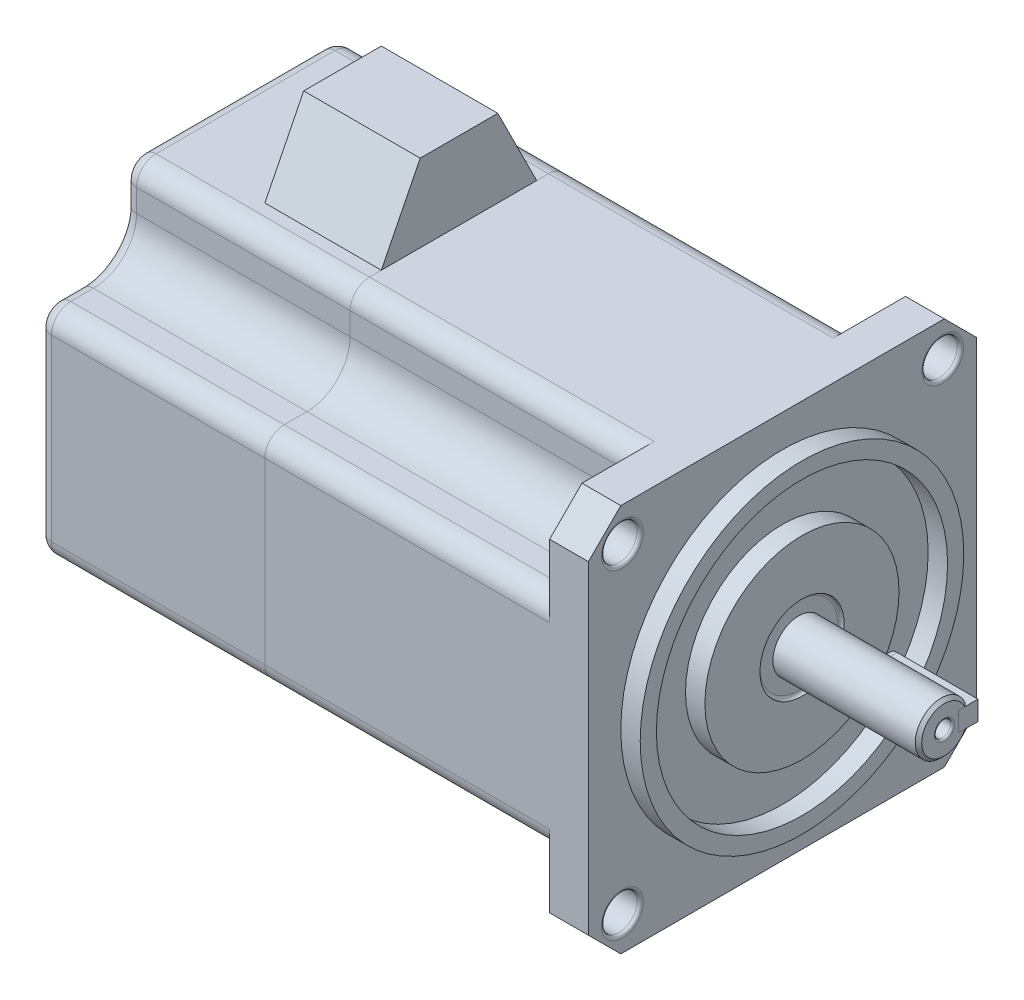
ISO-10303-21;
HEADER;
FILE_DESCRIPTION(('STEP AP214'),'2;1');
FILE_NAME('part.step','',(''),(''),'','','');
FILE_SCHEMA(('AUTOMOTIVE_DESIGN { 1 0 10303 214 1 1 1 1 }'));
ENDSEC;
DATA;
#1=APPLICATION_CONTEXT('core data for automotive mechanical design processes');
#2=APPLICATION_PROTOCOL_DEFINITION('international standard','automotive_design',2000,#1);
#3=PRODUCT_CONTEXT('',#1,'mechanical');
#4=PRODUCT('Part','Part','',(#3));
#5=PRODUCT_RELATED_PRODUCT_CATEGORY('part','',(#4));
#6=PRODUCT_DEFINITION_FORMATION('','',#4);
#7=PRODUCT_DEFINITION_CONTEXT('part definition',#1,'design');
#8=PRODUCT_DEFINITION('design','',#6,#7);
#9=PRODUCT_DEFINITION_SHAPE('','',#8);
#10=(LENGTH_UNIT() NAMED_UNIT(*) SI_UNIT(.MILLI.,.METRE.));
#11=(NAMED_UNIT(*) PLANE_ANGLE_UNIT() SI_UNIT($,.RADIAN.));
#12=(NAMED_UNIT(*) SI_UNIT($,.STERADIAN.) SOLID_ANGLE_UNIT());
#13=UNCERTAINTY_MEASURE_WITH_UNIT(LENGTH_MEASURE(1.E-05),#10,'distance_accuracy_value','');
#14=(GEOMETRIC_REPRESENTATION_CONTEXT(3) GLOBAL_UNCERTAINTY_ASSIGNED_CONTEXT((#13)) GLOBAL_UNIT_ASSIGNED_CONTEXT((#10,
#11,#12)) REPRESENTATION_CONTEXT('',''));
#15=CARTESIAN_POINT('',(0.,0.,0.));
#16=DIRECTION('',(0.,0.,1.));
#17=DIRECTION('',(1.,0.,0.));
#18=AXIS2_PLACEMENT_3D('',#15,#16,#17);
#19=CARTESIAN_POINT('',(-50.,42.,12.));
#20=DIRECTION('',(-1.,0.,0.));
#21=DIRECTION('',(0.,0.,1.));
#22=AXIS2_PLACEMENT_3D('',#19,#20,#21);
#23=PLANE('',#22);
#24=DIRECTION('',(0.,0.,-1.));
#25=VECTOR('',#24,1.);
#26=CARTESIAN_POINT('',(-50.,42.,12.));
#27=LINE('',#26,#25);
#28=CARTESIAN_POINT('',(-50.,42.,6.));
#29=VERTEX_POINT('',#28);
#30=CARTESIAN_POINT('',(-50.,42.,-6.));
#31=VERTEX_POINT('',#30);
#32=EDGE_CURVE('E57',#29,#31,#27,.T.);
#33=ORIENTED_EDGE('',*,*,#32,.F.);
#34=DIRECTION('',(0.,0.894427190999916,-0.447213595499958));
#35=VECTOR('',#34,1.);
#36=CARTESIAN_POINT('',(-50.,42.,6.));
#37=LINE('',#36,#35);
#38=CARTESIAN_POINT('',(-50.,30.,12.));
#39=VERTEX_POINT('',#38);
#40=EDGE_CURVE('E89',#39,#29,#37,.T.);
#41=ORIENTED_EDGE('',*,*,#40,.F.);
#42=DIRECTION('',(0.,0.,-1.));
#43=VECTOR('',#42,1.);
#44=CARTESIAN_POINT('',(-50.,30.,12.));
#45=LINE('',#44,#43);
#46=CARTESIAN_POINT('',(-50.,30.,-12.));
#47=VERTEX_POINT('',#46);
#48=EDGE_CURVE('E105',#39,#47,#45,.T.);
#49=ORIENTED_EDGE('',*,*,#48,.T.);
#50=DIRECTION('',(0.,-0.894427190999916,-0.447213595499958));
#51=VECTOR('',#50,1.);
#52=CARTESIAN_POINT('',(-50.,42.,-6.));
#53=LINE('',#52,#51);
#54=EDGE_CURVE('E73',#31,#47,#53,.T.);
#55=ORIENTED_EDGE('',*,*,#54,.F.);
#56=EDGE_LOOP('',(#33,#41,#49,#55));
#57=FACE_BOUND('',#56,.T.);
#58=ADVANCED_FACE('F49',(#57),#23,.F.);
#59=CARTESIAN_POINT('',(-68.,42.,12.));
#60=DIRECTION('',(1.,0.,0.));
#61=DIRECTION('',(0.,0.,-1.));
#62=AXIS2_PLACEMENT_3D('',#59,#60,#61);
#63=PLANE('',#62);
#64=DIRECTION('',(0.,0.,1.));
#65=VECTOR('',#64,1.);
#66=CARTESIAN_POINT('',(-68.,30.,12.));
#67=LINE('',#66,#65);
#68=CARTESIAN_POINT('',(-68.,30.,-12.));
#69=VERTEX_POINT('',#68);
#70=CARTESIAN_POINT('',(-68.,30.,12.));
#71=VERTEX_POINT('',#70);
#72=EDGE_CURVE('E108',#69,#71,#67,.T.);
#73=ORIENTED_EDGE('',*,*,#72,.T.);
#74=DIRECTION('',(0.,0.894427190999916,-0.447213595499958));
#75=VECTOR('',#74,1.);
#76=CARTESIAN_POINT('',(-68.,42.,6.));
#77=LINE('',#76,#75);
#78=CARTESIAN_POINT('',(-68.,42.,6.));
#79=VERTEX_POINT('',#78);
#80=EDGE_CURVE('E65',#71,#79,#77,.T.);
#81=ORIENTED_EDGE('',*,*,#80,.T.);
#82=DIRECTION('',(0.,0.,1.));
#83=VECTOR('',#82,1.);
#84=CARTESIAN_POINT('',(-68.,42.,12.));
#85=LINE('',#84,#83);
#86=CARTESIAN_POINT('',(-68.,42.,-6.));
#87=VERTEX_POINT('',#86);
#88=EDGE_CURVE('E12',#87,#79,#85,.T.);
#89=ORIENTED_EDGE('',*,*,#88,.F.);
#90=DIRECTION('',(0.,-0.894427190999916,-0.447213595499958));
#91=VECTOR('',#90,1.);
#92=CARTESIAN_POINT('',(-68.,42.,-6.));
#93=LINE('',#92,#91);
#94=EDGE_CURVE('E118',#87,#69,#93,.T.);
#95=ORIENTED_EDGE('',*,*,#94,.T.);
#96=EDGE_LOOP('',(#73,#81,#89,#95));
#97=FACE_BOUND('',#96,.T.);
#98=ADVANCED_FACE('F117',(#97),#63,.F.);
#99=CARTESIAN_POINT('',(0.,42.,0.));
#100=DIRECTION('',(0.,-1.,0.));
#101=DIRECTION('',(0.,0.,-1.));
#102=AXIS2_PLACEMENT_3D('',#99,#100,#101);
#103=PLANE('',#102);
#104=ORIENTED_EDGE('',*,*,#88,.T.);
#105=DIRECTION('',(1.,0.,0.));
#106=VECTOR('',#105,1.);
#107=CARTESIAN_POINT('',(-68.,42.,6.));
#108=LINE('',#107,#106);
#109=EDGE_CURVE('E92',#79,#29,#108,.T.);
#110=ORIENTED_EDGE('',*,*,#109,.T.);
#111=ORIENTED_EDGE('',*,*,#32,.T.);
#112=DIRECTION('',(1.,0.,0.));
#113=VECTOR('',#112,1.);
#114=CARTESIAN_POINT('',(-68.,42.,-6.));
#115=LINE('',#114,#113);
#116=EDGE_CURVE('E98',#87,#31,#115,.T.);
#117=ORIENTED_EDGE('',*,*,#116,.F.);
#118=EDGE_LOOP('',(#104,#110,#111,#117));
#119=FACE_BOUND('',#118,.T.);
#120=ADVANCED_FACE('F102',(#119),#103,.F.);
#121=CARTESIAN_POINT('',(0.,30.,0.));
#122=DIRECTION('',(0.,-1.,0.));
#123=DIRECTION('',(0.,0.,-1.));
#124=AXIS2_PLACEMENT_3D('',#121,#122,#123);
#125=PLANE('',#124);
#126=ORIENTED_EDGE('',*,*,#48,.F.);
#127=DIRECTION('',(1.,0.,0.));
#128=VECTOR('',#127,1.);
#129=CARTESIAN_POINT('',(-68.,30.,12.));
#130=LINE('',#129,#128);
#131=EDGE_CURVE('E52',#71,#39,#130,.T.);
#132=ORIENTED_EDGE('',*,*,#131,.F.);
#133=ORIENTED_EDGE('',*,*,#72,.F.);
#134=DIRECTION('',(-1.,0.,0.));
#135=VECTOR('',#134,1.);
#136=CARTESIAN_POINT('',(-68.,30.,-12.));
#137=LINE('',#136,#135);
#138=EDGE_CURVE('E113',#47,#69,#137,.T.);
#139=ORIENTED_EDGE('',*,*,#138,.F.);
#140=EDGE_LOOP('',(#126,#132,#133,#139));
#141=FACE_BOUND('',#140,.T.);
#142=ADVANCED_FACE('F120',(#141),#125,.T.);
#143=CARTESIAN_POINT('',(-68.,42.,-6.));
#144=DIRECTION('',(0.,-0.447213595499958,0.894427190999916));
#145=DIRECTION('',(0.,-0.894427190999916,-0.447213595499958));
#146=AXIS2_PLACEMENT_3D('',#143,#144,#145);
#147=PLANE('',#146);
#148=ORIENTED_EDGE('',*,*,#54,.T.);
#149=ORIENTED_EDGE('',*,*,#138,.T.);
#150=ORIENTED_EDGE('',*,*,#94,.F.);
#151=ORIENTED_EDGE('',*,*,#116,.T.);
#152=EDGE_LOOP('',(#148,#149,#150,#151));
#153=FACE_BOUND('',#152,.T.);
#154=ADVANCED_FACE('F121',(#153),#147,.F.);
#155=CARTESIAN_POINT('',(-68.,42.,6.));
#156=DIRECTION('',(0.,-0.447213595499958,-0.894427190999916));
#157=DIRECTION('',(0.,0.894427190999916,-0.447213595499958));
#158=AXIS2_PLACEMENT_3D('',#155,#156,#157);
#159=PLANE('',#158);
#160=ORIENTED_EDGE('',*,*,#40,.T.);
#161=ORIENTED_EDGE('',*,*,#109,.F.);
#162=ORIENTED_EDGE('',*,*,#80,.F.);
#163=ORIENTED_EDGE('',*,*,#131,.T.);
#164=EDGE_LOOP('',(#160,#161,#162,#163));
#165=FACE_BOUND('',#164,.T.);
#166=ADVANCED_FACE('F91',(#165),#159,.F.);
#167=CLOSED_SHELL('',(#58,#98,#120,#142,#154,#166));
#168=MANIFOLD_SOLID_BREP('B2',#167);
#169=CARTESIAN_POINT('',(12.5,0.,-5.2));
#170=DIRECTION('',(0.,0.,1.));
#171=DIRECTION('',(1.,0.,0.));
#172=AXIS2_PLACEMENT_3D('',#169,#170,#171);
#173=CYLINDRICAL_SURFACE('',#172,1.5);
#174=CARTESIAN_POINT('',(12.5,0.,-2.2));
#175=DIRECTION('',(0.,0.,-1.));
#176=DIRECTION('',(-1.,0.,0.));
#177=AXIS2_PLACEMENT_3D('',#174,#175,#176);
#178=CIRCLE('',#177,1.5);
#179=CARTESIAN_POINT('',(12.5,-1.5,-2.2));
#180=VERTEX_POINT('',#179);
#181=CARTESIAN_POINT('',(12.5,1.5,-2.2));
#182=VERTEX_POINT('',#181);
#183=EDGE_CURVE('E245',#180,#182,#178,.T.);
#184=ORIENTED_EDGE('',*,*,#183,.T.);
#185=DIRECTION('',(0.,0.,1.));
#186=VECTOR('',#185,1.);
#187=CARTESIAN_POINT('',(12.5,1.5,-5.2));
#188=LINE('',#187,#186);
#189=CARTESIAN_POINT('',(12.5,1.5,-5.2));
#190=VERTEX_POINT('',#189);
#191=EDGE_CURVE('E47',#190,#182,#188,.T.);
#192=ORIENTED_EDGE('',*,*,#191,.F.);
#193=CARTESIAN_POINT('',(12.5,0.,-5.2));
#194=DIRECTION('',(0.,0.,-1.));
#195=DIRECTION('',(-1.,0.,0.));
#196=AXIS2_PLACEMENT_3D('',#193,#194,#195);
#197=CIRCLE('',#196,1.5);
#198=CARTESIAN_POINT('',(12.5,-1.5,-5.2));
#199=VERTEX_POINT('',#198);
#200=EDGE_CURVE('E233',#199,#190,#197,.T.);
#201=ORIENTED_EDGE('',*,*,#200,.F.);
#202=DIRECTION('',(0.,0.,1.));
#203=VECTOR('',#202,1.);
#204=CARTESIAN_POINT('',(12.5,-1.5,-5.2));
#205=LINE('',#204,#203);
#206=EDGE_CURVE('E241',#199,#180,#205,.T.);
#207=ORIENTED_EDGE('',*,*,#206,.T.);
#208=EDGE_LOOP('',(#184,#192,#201,#207));
#209=FACE_BOUND('',#208,.T.);
#210=ADVANCED_FACE('F182',(#209),#173,.T.);
#211=CARTESIAN_POINT('',(12.5,1.5,-5.2));
#212=DIRECTION('',(0.,-1.,0.));
#213=DIRECTION('',(1.,0.,0.));
#214=AXIS2_PLACEMENT_3D('',#211,#212,#213);
#215=PLANE('',#214);
#216=DIRECTION('',(1.,0.,0.));
#217=VECTOR('',#216,1.);
#218=CARTESIAN_POINT('',(12.5,1.5,-2.2));
#219=LINE('',#218,#217);
#220=CARTESIAN_POINT('',(25.,1.5,-2.2));
#221=VERTEX_POINT('',#220);
#222=EDGE_CURVE('E237',#182,#221,#219,.T.);
#223=ORIENTED_EDGE('',*,*,#222,.T.);
#224=DIRECTION('',(0.,0.,1.));
#225=VECTOR('',#224,1.);
#226=CARTESIAN_POINT('',(25.,1.5,-5.2));
#227=LINE('',#226,#225);
#228=CARTESIAN_POINT('',(25.,1.5,-5.2));
#229=VERTEX_POINT('',#228);
#230=EDGE_CURVE('E190',#229,#221,#227,.T.);
#231=ORIENTED_EDGE('',*,*,#230,.F.);
#232=DIRECTION('',(1.,0.,0.));
#233=VECTOR('',#232,1.);
#234=CARTESIAN_POINT('',(12.5,1.5,-5.2));
#235=LINE('',#234,#233);
#236=EDGE_CURVE('E228',#190,#229,#235,.T.);
#237=ORIENTED_EDGE('',*,*,#236,.F.);
#238=ORIENTED_EDGE('',*,*,#191,.T.);
#239=EDGE_LOOP('',(#223,#231,#237,#238));
#240=FACE_BOUND('',#239,.T.);
#241=ADVANCED_FACE('F236',(#240),#215,.F.);
#242=CARTESIAN_POINT('',(25.,1.5,-5.2));
#243=DIRECTION('',(-1.,0.,0.));
#244=DIRECTION('',(0.,0.,1.));
#245=AXIS2_PLACEMENT_3D('',#242,#243,#244);
#246=PLANE('',#245);
#247=DIRECTION('',(0.,-1.,0.));
#248=VECTOR('',#247,1.);
#249=CARTESIAN_POINT('',(25.,1.5,-2.2));
#250=LINE('',#249,#248);
#251=CARTESIAN_POINT('',(25.,-1.5,-2.2));
#252=VERTEX_POINT('',#251);
#253=EDGE_CURVE('E215',#221,#252,#250,.T.);
#254=ORIENTED_EDGE('',*,*,#253,.T.);
#255=DIRECTION('',(0.,0.,1.));
#256=VECTOR('',#255,1.);
#257=CARTESIAN_POINT('',(25.,-1.5,-5.2));
#258=LINE('',#257,#256);
#259=CARTESIAN_POINT('',(25.,-1.5,-5.2));
#260=VERTEX_POINT('',#259);
#261=EDGE_CURVE('E238',#260,#252,#258,.T.);
#262=ORIENTED_EDGE('',*,*,#261,.F.);
#263=DIRECTION('',(0.,-1.,0.));
#264=VECTOR('',#263,1.);
#265=CARTESIAN_POINT('',(25.,1.5,-5.2));
#266=LINE('',#265,#264);
#267=EDGE_CURVE('E231',#229,#260,#266,.T.);
#268=ORIENTED_EDGE('',*,*,#267,.F.);
#269=ORIENTED_EDGE('',*,*,#230,.T.);
#270=EDGE_LOOP('',(#254,#262,#268,#269));
#271=FACE_BOUND('',#270,.T.);
#272=ADVANCED_FACE('F239',(#271),#246,.F.);
#273=CARTESIAN_POINT('',(25.,-1.5,-5.2));
#274=DIRECTION('',(0.,1.,0.));
#275=DIRECTION('',(0.,0.,1.));
#276=AXIS2_PLACEMENT_3D('',#273,#274,#275);
#277=PLANE('',#276);
#278=DIRECTION('',(-1.,0.,0.));
#279=VECTOR('',#278,1.);
#280=CARTESIAN_POINT('',(25.,-1.5,-2.2));
#281=LINE('',#280,#279);
#282=EDGE_CURVE('E221',#252,#180,#281,.T.);
#283=ORIENTED_EDGE('',*,*,#282,.T.);
#284=ORIENTED_EDGE('',*,*,#206,.F.);
#285=DIRECTION('',(-1.,0.,0.));
#286=VECTOR('',#285,1.);
#287=CARTESIAN_POINT('',(25.,-1.5,-5.2));
#288=LINE('',#287,#286);
#289=EDGE_CURVE('E198',#260,#199,#288,.T.);
#290=ORIENTED_EDGE('',*,*,#289,.F.);
#291=ORIENTED_EDGE('',*,*,#261,.T.);
#292=EDGE_LOOP('',(#283,#284,#290,#291));
#293=FACE_BOUND('',#292,.T.);
#294=ADVANCED_FACE('F252',(#293),#277,.F.);
#295=CARTESIAN_POINT('',(12.5,0.,-5.2));
#296=DIRECTION('',(0.,0.,-1.));
#297=DIRECTION('',(-1.,0.,0.));
#298=AXIS2_PLACEMENT_3D('',#295,#296,#297);
#299=PLANE('',#298);
#300=ORIENTED_EDGE('',*,*,#200,.T.);
#301=ORIENTED_EDGE('',*,*,#236,.T.);
#302=ORIENTED_EDGE('',*,*,#267,.T.);
#303=ORIENTED_EDGE('',*,*,#289,.T.);
#304=EDGE_LOOP('',(#300,#301,#302,#303));
#305=FACE_BOUND('',#304,.T.);
#306=ADVANCED_FACE('F229',(#305),#299,.T.);
#307=CARTESIAN_POINT('',(12.5,0.,-2.2));
#308=DIRECTION('',(0.,0.,-1.));
#309=DIRECTION('',(-1.,0.,0.));
#310=AXIS2_PLACEMENT_3D('',#307,#308,#309);
#311=PLANE('',#310);
#312=ORIENTED_EDGE('',*,*,#183,.F.);
#313=ORIENTED_EDGE('',*,*,#282,.F.);
#314=ORIENTED_EDGE('',*,*,#253,.F.);
#315=ORIENTED_EDGE('',*,*,#222,.F.);
#316=EDGE_LOOP('',(#312,#313,#314,#315));
#317=FACE_BOUND('',#316,.T.);
#318=ADVANCED_FACE('F255',(#317),#311,.F.);
#319=CLOSED_SHELL('',(#210,#241,#272,#294,#306,#318));
#320=MANIFOLD_SOLID_BREP('B6',#319);
#321=CARTESIAN_POINT('',(-85.,-13.8291679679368,-27.));
#322=DIRECTION('',(1.,0.,0.));
#323=DIRECTION('',(0.,0.,-1.));
#324=AXIS2_PLACEMENT_3D('',#321,#322,#323);
#325=CYLINDRICAL_SURFACE('',#324,3.);
#326=DIRECTION('',(1.,0.,0.));
#327=VECTOR('',#326,1.);
#328=CARTESIAN_POINT('',(-85.,-16.8291679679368,-27.));
#329=LINE('',#328,#327);
#330=CARTESIAN_POINT('',(-83.,-16.8291679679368,-27.));
#331=VERTEX_POINT('',#330);
#332=CARTESIAN_POINT('',(-50.,-16.8291679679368,-27.));
#333=VERTEX_POINT('',#332);
#334=EDGE_CURVE('E546',#331,#333,#329,.T.);
#335=ORIENTED_EDGE('',*,*,#334,.F.);
#336=CARTESIAN_POINT('',(-83.,-13.8291679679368,-27.));
#337=DIRECTION('',(1.,0.,0.));
#338=DIRECTION('',(0.,0.,-1.));
#339=AXIS2_PLACEMENT_3D('',#336,#337,#338);
#340=CIRCLE('',#339,3.);
#341=CARTESIAN_POINT('',(-83.,-13.8291679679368,-30.));
#342=VERTEX_POINT('',#341);
#343=EDGE_CURVE('E180',#331,#342,#340,.T.);
#344=ORIENTED_EDGE('',*,*,#343,.T.);
#345=DIRECTION('',(1.,0.,0.));
#346=VECTOR('',#345,1.);
#347=CARTESIAN_POINT('',(-85.,-13.8291679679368,-30.));
#348=LINE('',#347,#346);
#349=CARTESIAN_POINT('',(-50.,-13.8291679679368,-30.));
#350=VERTEX_POINT('',#349);
#351=EDGE_CURVE('E567',#342,#350,#348,.T.);
#352=ORIENTED_EDGE('',*,*,#351,.T.);
#353=CARTESIAN_POINT('',(-50.,-13.8291679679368,-27.));
#354=DIRECTION('',(-1.,0.,0.));
#355=DIRECTION('',(0.,0.,-1.));
#356=AXIS2_PLACEMENT_3D('',#353,#354,#355);
#357=CIRCLE('',#356,3.);
#358=EDGE_CURVE('E561',#350,#333,#357,.T.);
#359=ORIENTED_EDGE('',*,*,#358,.T.);
#360=EDGE_LOOP('',(#335,#344,#352,#359));
#361=FACE_BOUND('',#360,.T.);
#362=ADVANCED_FACE('F314',(#361),#325,.T.);
#363=CARTESIAN_POINT('',(-85.,-16.8291679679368,-23.5));
#364=DIRECTION('',(0.,1.,0.));
#365=DIRECTION('',(0.,0.,1.));
#366=AXIS2_PLACEMENT_3D('',#363,#364,#365);
#367=PLANE('',#366);
#368=DIRECTION('',(1.,0.,0.));
#369=VECTOR('',#368,1.);
#370=CARTESIAN_POINT('',(-85.,-16.8291679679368,-23.5));
#371=LINE('',#370,#369);
#372=CARTESIAN_POINT('',(-83.,-16.8291679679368,-23.5));
#373=VERTEX_POINT('',#372);
#374=CARTESIAN_POINT('',(-50.,-16.8291679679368,-23.5));
#375=VERTEX_POINT('',#374);
#376=EDGE_CURVE('E555',#373,#375,#371,.T.);
#377=ORIENTED_EDGE('',*,*,#376,.F.);
#378=DIRECTION('',(0.,0.,1.));
#379=VECTOR('',#378,1.);
#380=CARTESIAN_POINT('',(-83.,-16.8291679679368,-23.5));
#381=LINE('',#380,#379);
#382=EDGE_CURVE('E323',#373,#331,#381,.F.);
#383=ORIENTED_EDGE('',*,*,#382,.T.);
#384=ORIENTED_EDGE('',*,*,#334,.T.);
#385=DIRECTION('',(0.,0.,1.));
#386=VECTOR('',#385,1.);
#387=CARTESIAN_POINT('',(-50.,-16.8291679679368,-23.5));
#388=LINE('',#387,#386);
#389=EDGE_CURVE('E549',#333,#375,#388,.T.);
#390=ORIENTED_EDGE('',*,*,#389,.T.);
#391=EDGE_LOOP('',(#377,#383,#384,#390));
#392=FACE_BOUND('',#391,.T.);
#393=ADVANCED_FACE('F548',(#392),#367,.F.);
#394=CARTESIAN_POINT('',(-85.,-23.5,-23.5));
#395=DIRECTION('',(1.,0.,0.));
#396=DIRECTION('',(0.,0.,-1.));
#397=AXIS2_PLACEMENT_3D('',#394,#395,#396);
#398=CYLINDRICAL_SURFACE('',#397,6.67083203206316);
#399=DIRECTION('',(1.,0.,0.));
#400=VECTOR('',#399,1.);
#401=CARTESIAN_POINT('',(-85.,-23.5,-16.8291679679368));
#402=LINE('',#401,#400);
#403=CARTESIAN_POINT('',(-83.,-23.5,-16.8291679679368));
#404=VERTEX_POINT('',#403);
#405=CARTESIAN_POINT('',(-50.,-23.5,-16.8291679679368));
#406=VERTEX_POINT('',#405);
#407=EDGE_CURVE('E677',#404,#406,#402,.T.);
#408=ORIENTED_EDGE('',*,*,#407,.F.);
#409=CARTESIAN_POINT('',(-83.,-23.5,-23.5));
#410=DIRECTION('',(1.,0.,0.));
#411=DIRECTION('',(0.,0.,-1.));
#412=AXIS2_PLACEMENT_3D('',#409,#410,#411);
#413=CIRCLE('',#412,6.67083203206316);
#414=EDGE_CURVE('E338',#404,#373,#413,.F.);
#415=ORIENTED_EDGE('',*,*,#414,.T.);
#416=ORIENTED_EDGE('',*,*,#376,.T.);
#417=CARTESIAN_POINT('',(-50.,-23.5,-23.5));
#418=DIRECTION('',(1.,0.,0.));
#419=DIRECTION('',(0.,0.,1.));
#420=AXIS2_PLACEMENT_3D('',#417,#418,#419);
#421=CIRCLE('',#420,6.67083203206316);
#422=EDGE_CURVE('E564',#375,#406,#421,.T.);
#423=ORIENTED_EDGE('',*,*,#422,.T.);
#424=EDGE_LOOP('',(#408,#415,#416,#423));
#425=FACE_BOUND('',#424,.T.);
#426=ADVANCED_FACE('F995',(#425),#398,.F.);
#427=CARTESIAN_POINT('',(-85.,-23.5,-16.8291679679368));
#428=DIRECTION('',(0.,0.,1.));
#429=DIRECTION('',(1.,0.,0.));
#430=AXIS2_PLACEMENT_3D('',#427,#428,#429);
#431=PLANE('',#430);
#432=DIRECTION('',(1.,0.,0.));
#433=VECTOR('',#432,1.);
#434=CARTESIAN_POINT('',(-85.,-27.,-16.8291679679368));
#435=LINE('',#434,#433);
#436=CARTESIAN_POINT('',(-83.,-27.,-16.8291679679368));
#437=VERTEX_POINT('',#436);
#438=CARTESIAN_POINT('',(-50.,-27.,-16.8291679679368));
#439=VERTEX_POINT('',#438);
#440=EDGE_CURVE('E675',#437,#439,#435,.T.);
#441=ORIENTED_EDGE('',*,*,#440,.F.);
#442=DIRECTION('',(0.,-1.,0.));
#443=VECTOR('',#442,1.);
#444=CARTESIAN_POINT('',(-83.,-23.5,-16.8291679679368));
#445=LINE('',#444,#443);
#446=EDGE_CURVE('E769',#437,#404,#445,.F.);
#447=ORIENTED_EDGE('',*,*,#446,.T.);
#448=ORIENTED_EDGE('',*,*,#407,.T.);
#449=DIRECTION('',(0.,-1.,0.));
#450=VECTOR('',#449,1.);
#451=CARTESIAN_POINT('',(-50.,-23.5,-16.8291679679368));
#452=LINE('',#451,#450);
#453=EDGE_CURVE('E574',#406,#439,#452,.T.);
#454=ORIENTED_EDGE('',*,*,#453,.T.);
#455=EDGE_LOOP('',(#441,#447,#448,#454));
#456=FACE_BOUND('',#455,.T.);
#457=ADVANCED_FACE('F1350',(#456),#431,.F.);
#458=CARTESIAN_POINT('',(-85.,-27.,-13.8291679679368));
#459=DIRECTION('',(1.,0.,0.));
#460=DIRECTION('',(0.,0.,-1.));
#461=AXIS2_PLACEMENT_3D('',#458,#459,#460);
#462=CYLINDRICAL_SURFACE('',#461,3.);
#463=DIRECTION('',(1.,0.,0.));
#464=VECTOR('',#463,1.);
#465=CARTESIAN_POINT('',(-85.,-30.,-13.8291679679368));
#466=LINE('',#465,#464);
#467=CARTESIAN_POINT('',(-83.,-30.,-13.8291679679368));
#468=VERTEX_POINT('',#467);
#469=CARTESIAN_POINT('',(-50.,-30.,-13.8291679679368));
#470=VERTEX_POINT('',#469);
#471=EDGE_CURVE('E673',#468,#470,#466,.T.);
#472=ORIENTED_EDGE('',*,*,#471,.F.);
#473=CARTESIAN_POINT('',(-83.,-27.,-13.8291679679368));
#474=DIRECTION('',(1.,0.,0.));
#475=DIRECTION('',(0.,0.,-1.));
#476=AXIS2_PLACEMENT_3D('',#473,#474,#475);
#477=CIRCLE('',#476,3.);
#478=EDGE_CURVE('E767',#468,#437,#477,.T.);
#479=ORIENTED_EDGE('',*,*,#478,.T.);
#480=ORIENTED_EDGE('',*,*,#440,.T.);
#481=CARTESIAN_POINT('',(-50.,-27.,-13.8291679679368));
#482=DIRECTION('',(-1.,0.,0.));
#483=DIRECTION('',(0.,0.,1.));
#484=AXIS2_PLACEMENT_3D('',#481,#482,#483);
#485=CIRCLE('',#484,3.);
#486=EDGE_CURVE('E577',#439,#470,#485,.T.);
#487=ORIENTED_EDGE('',*,*,#486,.T.);
#488=EDGE_LOOP('',(#472,#479,#480,#487));
#489=FACE_BOUND('',#488,.T.);
#490=ADVANCED_FACE('F1341',(#489),#462,.T.);
#491=CARTESIAN_POINT('',(-85.,-30.,13.8291679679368));
#492=DIRECTION('',(0.,1.,0.));
#493=DIRECTION('',(0.,0.,1.));
#494=AXIS2_PLACEMENT_3D('',#491,#492,#493);
#495=PLANE('',#494);
#496=DIRECTION('',(1.,0.,0.));
#497=VECTOR('',#496,1.);
#498=CARTESIAN_POINT('',(-85.,-30.,13.8291679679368));
#499=LINE('',#498,#497);
#500=CARTESIAN_POINT('',(-83.,-30.,13.8291679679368));
#501=VERTEX_POINT('',#500);
#502=CARTESIAN_POINT('',(-50.,-30.,13.8291679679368));
#503=VERTEX_POINT('',#502);
#504=EDGE_CURVE('E671',#501,#503,#499,.T.);
#505=ORIENTED_EDGE('',*,*,#504,.F.);
#506=DIRECTION('',(0.,0.,1.));
#507=VECTOR('',#506,1.);
#508=CARTESIAN_POINT('',(-83.,-30.,13.8291679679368));
#509=LINE('',#508,#507);
#510=EDGE_CURVE('E765',#501,#468,#509,.F.);
#511=ORIENTED_EDGE('',*,*,#510,.T.);
#512=ORIENTED_EDGE('',*,*,#471,.T.);
#513=DIRECTION('',(0.,0.,1.));
#514=VECTOR('',#513,1.);
#515=CARTESIAN_POINT('',(-50.,-30.,13.8291679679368));
#516=LINE('',#515,#514);
#517=EDGE_CURVE('E580',#470,#503,#516,.T.);
#518=ORIENTED_EDGE('',*,*,#517,.T.);
#519=EDGE_LOOP('',(#505,#511,#512,#518));
#520=FACE_BOUND('',#519,.T.);
#521=ADVANCED_FACE('F1332',(#520),#495,.F.);
#522=CARTESIAN_POINT('',(-85.,-27.,13.8291679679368));
#523=DIRECTION('',(1.,0.,0.));
#524=DIRECTION('',(0.,0.,-1.));
#525=AXIS2_PLACEMENT_3D('',#522,#523,#524);
#526=CYLINDRICAL_SURFACE('',#525,3.);
#527=DIRECTION('',(1.,0.,0.));
#528=VECTOR('',#527,1.);
#529=CARTESIAN_POINT('',(-85.,-27.,16.8291679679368));
#530=LINE('',#529,#528);
#531=CARTESIAN_POINT('',(-83.,-27.,16.8291679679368));
#532=VERTEX_POINT('',#531);
#533=CARTESIAN_POINT('',(-50.,-27.,16.8291679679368));
#534=VERTEX_POINT('',#533);
#535=EDGE_CURVE('E669',#532,#534,#530,.T.);
#536=ORIENTED_EDGE('',*,*,#535,.F.);
#537=CARTESIAN_POINT('',(-83.,-27.,13.8291679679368));
#538=DIRECTION('',(1.,0.,0.));
#539=DIRECTION('',(0.,0.,-1.));
#540=AXIS2_PLACEMENT_3D('',#537,#538,#539);
#541=CIRCLE('',#540,3.);
#542=EDGE_CURVE('E763',#532,#501,#541,.T.);
#543=ORIENTED_EDGE('',*,*,#542,.T.);
#544=ORIENTED_EDGE('',*,*,#504,.T.);
#545=CARTESIAN_POINT('',(-50.,-27.,13.8291679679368));
#546=DIRECTION('',(-1.,0.,0.));
#547=DIRECTION('',(0.,0.,-1.));
#548=AXIS2_PLACEMENT_3D('',#545,#546,#547);
#549=CIRCLE('',#548,3.);
#550=EDGE_CURVE('E583',#503,#534,#549,.T.);
#551=ORIENTED_EDGE('',*,*,#550,.T.);
#552=EDGE_LOOP('',(#536,#543,#544,#551));
#553=FACE_BOUND('',#552,.T.);
#554=ADVANCED_FACE('F1324',(#553),#526,.T.);
#555=CARTESIAN_POINT('',(-85.,-23.5,16.8291679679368));
#556=DIRECTION('',(0.,0.,-1.));
#557=DIRECTION('',(-1.,0.,0.));
#558=AXIS2_PLACEMENT_3D('',#555,#556,#557);
#559=PLANE('',#558);
#560=DIRECTION('',(1.,0.,0.));
#561=VECTOR('',#560,1.);
#562=CARTESIAN_POINT('',(-85.,-23.5,16.8291679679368));
#563=LINE('',#562,#561);
#564=CARTESIAN_POINT('',(-83.,-23.5,16.8291679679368));
#565=VERTEX_POINT('',#564);
#566=CARTESIAN_POINT('',(-50.,-23.5,16.8291679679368));
#567=VERTEX_POINT('',#566);
#568=EDGE_CURVE('E667',#565,#567,#563,.T.);
#569=ORIENTED_EDGE('',*,*,#568,.F.);
#570=DIRECTION('',(0.,1.,0.));
#571=VECTOR('',#570,1.);
#572=CARTESIAN_POINT('',(-83.,-23.5,16.8291679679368));
#573=LINE('',#572,#571);
#574=EDGE_CURVE('E761',#565,#532,#573,.F.);
#575=ORIENTED_EDGE('',*,*,#574,.T.);
#576=ORIENTED_EDGE('',*,*,#535,.T.);
#577=DIRECTION('',(0.,1.,0.));
#578=VECTOR('',#577,1.);
#579=CARTESIAN_POINT('',(-50.,-23.5,16.8291679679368));
#580=LINE('',#579,#578);
#581=EDGE_CURVE('E586',#534,#567,#580,.T.);
#582=ORIENTED_EDGE('',*,*,#581,.T.);
#583=EDGE_LOOP('',(#569,#575,#576,#582));
#584=FACE_BOUND('',#583,.T.);
#585=ADVANCED_FACE('F867',(#584),#559,.F.);
#586=CARTESIAN_POINT('',(-85.,-23.5,23.5));
#587=DIRECTION('',(1.,0.,0.));
#588=DIRECTION('',(0.,0.,-1.));
#589=AXIS2_PLACEMENT_3D('',#586,#587,#588);
#590=CYLINDRICAL_SURFACE('',#589,6.67083203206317);
#591=DIRECTION('',(1.,0.,0.));
#592=VECTOR('',#591,1.);
#593=CARTESIAN_POINT('',(-85.,-16.8291679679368,23.5));
#594=LINE('',#593,#592);
#595=CARTESIAN_POINT('',(-83.,-16.8291679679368,23.5));
#596=VERTEX_POINT('',#595);
#597=CARTESIAN_POINT('',(-50.,-16.8291679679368,23.5));
#598=VERTEX_POINT('',#597);
#599=EDGE_CURVE('E665',#596,#598,#594,.T.);
#600=ORIENTED_EDGE('',*,*,#599,.F.);
#601=CARTESIAN_POINT('',(-83.,-23.5,23.5));
#602=DIRECTION('',(1.,0.,0.));
#603=DIRECTION('',(0.,0.,-1.));
#604=AXIS2_PLACEMENT_3D('',#601,#602,#603);
#605=CIRCLE('',#604,6.67083203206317);
#606=EDGE_CURVE('E759',#596,#565,#605,.F.);
#607=ORIENTED_EDGE('',*,*,#606,.T.);
#608=ORIENTED_EDGE('',*,*,#568,.T.);
#609=CARTESIAN_POINT('',(-50.,-23.5,23.5));
#610=DIRECTION('',(1.,0.,0.));
#611=DIRECTION('',(0.,0.,1.));
#612=AXIS2_PLACEMENT_3D('',#609,#610,#611);
#613=CIRCLE('',#612,6.67083203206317);
#614=EDGE_CURVE('E589',#567,#598,#613,.T.);
#615=ORIENTED_EDGE('',*,*,#614,.T.);
#616=EDGE_LOOP('',(#600,#607,#608,#615));
#617=FACE_BOUND('',#616,.T.);
#618=ADVANCED_FACE('F865',(#617),#590,.F.);
#619=CARTESIAN_POINT('',(-85.,-16.8291679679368,23.5));
#620=DIRECTION('',(0.,1.,0.));
#621=DIRECTION('',(0.,0.,1.));
#622=AXIS2_PLACEMENT_3D('',#619,#620,#621);
#623=PLANE('',#622);
#624=DIRECTION('',(1.,0.,0.));
#625=VECTOR('',#624,1.);
#626=CARTESIAN_POINT('',(-85.,-16.8291679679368,27.));
#627=LINE('',#626,#625);
#628=CARTESIAN_POINT('',(-83.,-16.8291679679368,27.));
#629=VERTEX_POINT('',#628);
#630=CARTESIAN_POINT('',(-50.,-16.8291679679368,27.));
#631=VERTEX_POINT('',#630);
#632=EDGE_CURVE('E663',#629,#631,#627,.T.);
#633=ORIENTED_EDGE('',*,*,#632,.F.);
#634=DIRECTION('',(0.,0.,1.));
#635=VECTOR('',#634,1.);
#636=CARTESIAN_POINT('',(-83.,-16.8291679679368,23.5));
#637=LINE('',#636,#635);
#638=EDGE_CURVE('E757',#629,#596,#637,.F.);
#639=ORIENTED_EDGE('',*,*,#638,.T.);
#640=ORIENTED_EDGE('',*,*,#599,.T.);
#641=DIRECTION('',(0.,0.,1.));
#642=VECTOR('',#641,1.);
#643=CARTESIAN_POINT('',(-50.,-16.8291679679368,23.5));
#644=LINE('',#643,#642);
#645=EDGE_CURVE('E592',#598,#631,#644,.T.);
#646=ORIENTED_EDGE('',*,*,#645,.T.);
#647=EDGE_LOOP('',(#633,#639,#640,#646));
#648=FACE_BOUND('',#647,.T.);
#649=ADVANCED_FACE('F877',(#648),#623,.F.);
#650=CARTESIAN_POINT('',(-85.,-13.8291679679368,27.));
#651=DIRECTION('',(1.,0.,0.));
#652=DIRECTION('',(0.,0.,-1.));
#653=AXIS2_PLACEMENT_3D('',#650,#651,#652);
#654=CYLINDRICAL_SURFACE('',#653,3.);
#655=DIRECTION('',(1.,0.,0.));
#656=VECTOR('',#655,1.);
#657=CARTESIAN_POINT('',(-85.,-13.8291679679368,30.));
#658=LINE('',#657,#656);
#659=CARTESIAN_POINT('',(-83.,-13.8291679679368,30.));
#660=VERTEX_POINT('',#659);
#661=CARTESIAN_POINT('',(-50.,-13.8291679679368,30.));
#662=VERTEX_POINT('',#661);
#663=EDGE_CURVE('E661',#660,#662,#658,.T.);
#664=ORIENTED_EDGE('',*,*,#663,.F.);
#665=CARTESIAN_POINT('',(-83.,-13.8291679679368,27.));
#666=DIRECTION('',(1.,0.,0.));
#667=DIRECTION('',(0.,0.,-1.));
#668=AXIS2_PLACEMENT_3D('',#665,#666,#667);
#669=CIRCLE('',#668,3.);
#670=EDGE_CURVE('E755',#660,#629,#669,.T.);
#671=ORIENTED_EDGE('',*,*,#670,.T.);
#672=ORIENTED_EDGE('',*,*,#632,.T.);
#673=CARTESIAN_POINT('',(-50.,-13.8291679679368,27.));
#674=DIRECTION('',(-1.,0.,0.));
#675=DIRECTION('',(0.,0.,1.));
#676=AXIS2_PLACEMENT_3D('',#673,#674,#675);
#677=CIRCLE('',#676,3.);
#678=EDGE_CURVE('E595',#631,#662,#677,.T.);
#679=ORIENTED_EDGE('',*,*,#678,.T.);
#680=EDGE_LOOP('',(#664,#671,#672,#679));
#681=FACE_BOUND('',#680,.T.);
#682=ADVANCED_FACE('F880',(#681),#654,.T.);
#683=CARTESIAN_POINT('',(-85.,13.8291679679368,30.));
#684=DIRECTION('',(0.,0.,-1.));
#685=DIRECTION('',(0.,1.,0.));
#686=AXIS2_PLACEMENT_3D('',#683,#684,#685);
#687=PLANE('',#686);
#688=DIRECTION('',(1.,0.,0.));
#689=VECTOR('',#688,1.);
#690=CARTESIAN_POINT('',(-85.,13.8291679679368,30.));
#691=LINE('',#690,#689);
#692=CARTESIAN_POINT('',(-83.,13.8291679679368,30.));
#693=VERTEX_POINT('',#692);
#694=CARTESIAN_POINT('',(-50.,13.8291679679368,30.));
#695=VERTEX_POINT('',#694);
#696=EDGE_CURVE('E659',#693,#695,#691,.T.);
#697=ORIENTED_EDGE('',*,*,#696,.F.);
#698=DIRECTION('',(0.,1.,0.));
#699=VECTOR('',#698,1.);
#700=CARTESIAN_POINT('',(-83.,13.8291679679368,30.));
#701=LINE('',#700,#699);
#702=EDGE_CURVE('E753',#693,#660,#701,.F.);
#703=ORIENTED_EDGE('',*,*,#702,.T.);
#704=ORIENTED_EDGE('',*,*,#663,.T.);
#705=DIRECTION('',(0.,1.,0.));
#706=VECTOR('',#705,1.);
#707=CARTESIAN_POINT('',(-50.,13.8291679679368,30.));
#708=LINE('',#707,#706);
#709=EDGE_CURVE('E598',#662,#695,#708,.T.);
#710=ORIENTED_EDGE('',*,*,#709,.T.);
#711=EDGE_LOOP('',(#697,#703,#704,#710));
#712=FACE_BOUND('',#711,.T.);
#713=ADVANCED_FACE('F883',(#712),#687,.F.);
#714=CARTESIAN_POINT('',(-85.,13.8291679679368,27.));
#715=DIRECTION('',(1.,0.,0.));
#716=DIRECTION('',(0.,0.,-1.));
#717=AXIS2_PLACEMENT_3D('',#714,#715,#716);
#718=CYLINDRICAL_SURFACE('',#717,3.);
#719=DIRECTION('',(1.,0.,0.));
#720=VECTOR('',#719,1.);
#721=CARTESIAN_POINT('',(-85.,16.8291679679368,27.));
#722=LINE('',#721,#720);
#723=CARTESIAN_POINT('',(-83.,16.8291679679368,27.));
#724=VERTEX_POINT('',#723);
#725=CARTESIAN_POINT('',(-50.,16.8291679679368,27.));
#726=VERTEX_POINT('',#725);
#727=EDGE_CURVE('E657',#724,#726,#722,.T.);
#728=ORIENTED_EDGE('',*,*,#727,.F.);
#729=CARTESIAN_POINT('',(-83.,13.8291679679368,27.));
#730=DIRECTION('',(1.,0.,0.));
#731=DIRECTION('',(0.,0.,-1.));
#732=AXIS2_PLACEMENT_3D('',#729,#730,#731);
#733=CIRCLE('',#732,3.);
#734=EDGE_CURVE('E751',#724,#693,#733,.T.);
#735=ORIENTED_EDGE('',*,*,#734,.T.);
#736=ORIENTED_EDGE('',*,*,#696,.T.);
#737=CARTESIAN_POINT('',(-50.,13.8291679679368,27.));
#738=DIRECTION('',(-1.,0.,0.));
#739=DIRECTION('',(0.,0.,-1.));
#740=AXIS2_PLACEMENT_3D('',#737,#738,#739);
#741=CIRCLE('',#740,3.);
#742=EDGE_CURVE('E601',#695,#726,#741,.T.);
#743=ORIENTED_EDGE('',*,*,#742,.T.);
#744=EDGE_LOOP('',(#728,#735,#736,#743));
#745=FACE_BOUND('',#744,.T.);
#746=ADVANCED_FACE('F887',(#745),#718,.T.);
#747=CARTESIAN_POINT('',(-85.,16.8291679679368,23.5));
#748=DIRECTION('',(0.,-1.,0.));
#749=DIRECTION('',(0.,0.,-1.));
#750=AXIS2_PLACEMENT_3D('',#747,#748,#749);
#751=PLANE('',#750);
#752=DIRECTION('',(1.,0.,0.));
#753=VECTOR('',#752,1.);
#754=CARTESIAN_POINT('',(-85.,16.8291679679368,23.5));
#755=LINE('',#754,#753);
#756=CARTESIAN_POINT('',(-83.,16.8291679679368,23.5));
#757=VERTEX_POINT('',#756);
#758=CARTESIAN_POINT('',(-50.,16.8291679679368,23.5));
#759=VERTEX_POINT('',#758);
#760=EDGE_CURVE('E655',#757,#759,#755,.T.);
#761=ORIENTED_EDGE('',*,*,#760,.F.);
#762=DIRECTION('',(0.,0.,-1.));
#763=VECTOR('',#762,1.);
#764=CARTESIAN_POINT('',(-83.,16.8291679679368,23.5));
#765=LINE('',#764,#763);
#766=EDGE_CURVE('E749',#757,#724,#765,.F.);
#767=ORIENTED_EDGE('',*,*,#766,.T.);
#768=ORIENTED_EDGE('',*,*,#727,.T.);
#769=DIRECTION('',(0.,0.,-1.));
#770=VECTOR('',#769,1.);
#771=CARTESIAN_POINT('',(-50.,16.8291679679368,23.5));
#772=LINE('',#771,#770);
#773=EDGE_CURVE('E604',#726,#759,#772,.T.);
#774=ORIENTED_EDGE('',*,*,#773,.T.);
#775=EDGE_LOOP('',(#761,#767,#768,#774));
#776=FACE_BOUND('',#775,.T.);
#777=ADVANCED_FACE('F1272',(#776),#751,.F.);
#778=CARTESIAN_POINT('',(-85.,23.5,23.5));
#779=DIRECTION('',(1.,0.,0.));
#780=DIRECTION('',(0.,0.,-1.));
#781=AXIS2_PLACEMENT_3D('',#778,#779,#780);
#782=CYLINDRICAL_SURFACE('',#781,6.67083203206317);
#783=DIRECTION('',(1.,0.,0.));
#784=VECTOR('',#783,1.);
#785=CARTESIAN_POINT('',(-85.,23.5,16.8291679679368));
#786=LINE('',#785,#784);
#787=CARTESIAN_POINT('',(-83.,23.5,16.8291679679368));
#788=VERTEX_POINT('',#787);
#789=CARTESIAN_POINT('',(-50.,23.5,16.8291679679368));
#790=VERTEX_POINT('',#789);
#791=EDGE_CURVE('E653',#788,#790,#786,.T.);
#792=ORIENTED_EDGE('',*,*,#791,.F.);
#793=CARTESIAN_POINT('',(-83.,23.5,23.5));
#794=DIRECTION('',(1.,0.,0.));
#795=DIRECTION('',(0.,0.,-1.));
#796=AXIS2_PLACEMENT_3D('',#793,#794,#795);
#797=CIRCLE('',#796,6.67083203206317);
#798=EDGE_CURVE('E747',#788,#757,#797,.F.);
#799=ORIENTED_EDGE('',*,*,#798,.T.);
#800=ORIENTED_EDGE('',*,*,#760,.T.);
#801=CARTESIAN_POINT('',(-50.,23.5,23.5));
#802=DIRECTION('',(1.,0.,0.));
#803=DIRECTION('',(0.,0.,1.));
#804=AXIS2_PLACEMENT_3D('',#801,#802,#803);
#805=CIRCLE('',#804,6.67083203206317);
#806=EDGE_CURVE('E607',#759,#790,#805,.T.);
#807=ORIENTED_EDGE('',*,*,#806,.T.);
#808=EDGE_LOOP('',(#792,#799,#800,#807));
#809=FACE_BOUND('',#808,.T.);
#810=ADVANCED_FACE('F1263',(#809),#782,.F.);
#811=CARTESIAN_POINT('',(-85.,23.5,16.8291679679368));
#812=DIRECTION('',(0.,0.,-1.));
#813=DIRECTION('',(-1.,0.,0.));
#814=AXIS2_PLACEMENT_3D('',#811,#812,#813);
#815=PLANE('',#814);
#816=DIRECTION('',(1.,0.,0.));
#817=VECTOR('',#816,1.);
#818=CARTESIAN_POINT('',(-85.,27.,16.8291679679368));
#819=LINE('',#818,#817);
#820=CARTESIAN_POINT('',(-83.,27.,16.8291679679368));
#821=VERTEX_POINT('',#820);
#822=CARTESIAN_POINT('',(-50.,27.,16.8291679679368));
#823=VERTEX_POINT('',#822);
#824=EDGE_CURVE('E651',#821,#823,#819,.T.);
#825=ORIENTED_EDGE('',*,*,#824,.F.);
#826=DIRECTION('',(0.,1.,0.));
#827=VECTOR('',#826,1.);
#828=CARTESIAN_POINT('',(-83.,23.5,16.8291679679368));
#829=LINE('',#828,#827);
#830=EDGE_CURVE('E745',#821,#788,#829,.F.);
#831=ORIENTED_EDGE('',*,*,#830,.T.);
#832=ORIENTED_EDGE('',*,*,#791,.T.);
#833=DIRECTION('',(0.,1.,0.));
#834=VECTOR('',#833,1.);
#835=CARTESIAN_POINT('',(-50.,23.5,16.8291679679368));
#836=LINE('',#835,#834);
#837=EDGE_CURVE('E610',#790,#823,#836,.T.);
#838=ORIENTED_EDGE('',*,*,#837,.T.);
#839=EDGE_LOOP('',(#825,#831,#832,#838));
#840=FACE_BOUND('',#839,.T.);
#841=ADVANCED_FACE('F1254',(#840),#815,.F.);
#842=CARTESIAN_POINT('',(-85.,27.,13.8291679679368));
#843=DIRECTION('',(1.,0.,0.));
#844=DIRECTION('',(0.,0.,-1.));
#845=AXIS2_PLACEMENT_3D('',#842,#843,#844);
#846=CYLINDRICAL_SURFACE('',#845,3.);
#847=DIRECTION('',(1.,0.,0.));
#848=VECTOR('',#847,1.);
#849=CARTESIAN_POINT('',(-85.,30.,13.8291679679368));
#850=LINE('',#849,#848);
#851=CARTESIAN_POINT('',(-83.,30.,13.8291679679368));
#852=VERTEX_POINT('',#851);
#853=CARTESIAN_POINT('',(-50.,30.,13.8291679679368));
#854=VERTEX_POINT('',#853);
#855=EDGE_CURVE('E649',#852,#854,#850,.T.);
#856=ORIENTED_EDGE('',*,*,#855,.F.);
#857=CARTESIAN_POINT('',(-83.,27.,13.8291679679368));
#858=DIRECTION('',(1.,0.,0.));
#859=DIRECTION('',(0.,0.,-1.));
#860=AXIS2_PLACEMENT_3D('',#857,#858,#859);
#861=CIRCLE('',#860,3.);
#862=EDGE_CURVE('E743',#852,#821,#861,.T.);
#863=ORIENTED_EDGE('',*,*,#862,.T.);
#864=ORIENTED_EDGE('',*,*,#824,.T.);
#865=CARTESIAN_POINT('',(-50.,27.,13.8291679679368));
#866=DIRECTION('',(-1.,0.,0.));
#867=DIRECTION('',(0.,0.,1.));
#868=AXIS2_PLACEMENT_3D('',#865,#866,#867);
#869=CIRCLE('',#868,3.);
#870=EDGE_CURVE('E613',#823,#854,#869,.T.);
#871=ORIENTED_EDGE('',*,*,#870,.T.);
#872=EDGE_LOOP('',(#856,#863,#864,#871));
#873=FACE_BOUND('',#872,.T.);
#874=ADVANCED_FACE('F1246',(#873),#846,.T.);
#875=CARTESIAN_POINT('',(-85.,30.,-13.8291679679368));
#876=DIRECTION('',(0.,-1.,0.));
#877=DIRECTION('',(0.,0.,-1.));
#878=AXIS2_PLACEMENT_3D('',#875,#876,#877);
#879=PLANE('',#878);
#880=DIRECTION('',(0.,0.,-1.));
#881=VECTOR('',#880,1.);
#882=CARTESIAN_POINT('',(-50.,30.,-13.8291679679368));
#883=LINE('',#882,#881);
#884=CARTESIAN_POINT('',(-50.,30.,-13.8291679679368));
#885=VERTEX_POINT('',#884);
#886=EDGE_CURVE('E616',#854,#885,#883,.T.);
#887=ORIENTED_EDGE('',*,*,#886,.T.);
#888=DIRECTION('',(1.,0.,0.));
#889=VECTOR('',#888,1.);
#890=CARTESIAN_POINT('',(-85.,30.,-13.8291679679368));
#891=LINE('',#890,#889);
#892=CARTESIAN_POINT('',(-83.,30.,-13.8291679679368));
#893=VERTEX_POINT('',#892);
#894=EDGE_CURVE('E646',#893,#885,#891,.T.);
#895=ORIENTED_EDGE('',*,*,#894,.F.);
#896=DIRECTION('',(0.,0.,-1.));
#897=VECTOR('',#896,1.);
#898=CARTESIAN_POINT('',(-83.,30.,-13.8291679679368));
#899=LINE('',#898,#897);
#900=EDGE_CURVE('E741',#893,#852,#899,.F.);
#901=ORIENTED_EDGE('',*,*,#900,.T.);
#902=ORIENTED_EDGE('',*,*,#855,.T.);
#903=EDGE_LOOP('',(#887,#895,#901,#902));
#904=FACE_BOUND('',#903,.T.);
#905=ADVANCED_FACE('F1237',(#904),#879,.F.);
#906=CARTESIAN_POINT('',(-85.,27.,-13.8291679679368));
#907=DIRECTION('',(1.,0.,0.));
#908=DIRECTION('',(0.,0.,-1.));
#909=AXIS2_PLACEMENT_3D('',#906,#907,#908);
#910=CYLINDRICAL_SURFACE('',#909,3.);
#911=DIRECTION('',(1.,0.,0.));
#912=VECTOR('',#911,1.);
#913=CARTESIAN_POINT('',(-85.,27.,-16.8291679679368));
#914=LINE('',#913,#912);
#915=CARTESIAN_POINT('',(-83.,27.,-16.8291679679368));
#916=VERTEX_POINT('',#915);
#917=CARTESIAN_POINT('',(-50.,27.,-16.8291679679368));
#918=VERTEX_POINT('',#917);
#919=EDGE_CURVE('E644',#916,#918,#914,.T.);
#920=ORIENTED_EDGE('',*,*,#919,.F.);
#921=CARTESIAN_POINT('',(-83.,27.,-13.8291679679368));
#922=DIRECTION('',(1.,0.,0.));
#923=DIRECTION('',(0.,0.,-1.));
#924=AXIS2_PLACEMENT_3D('',#921,#922,#923);
#925=CIRCLE('',#924,3.);
#926=EDGE_CURVE('E739',#916,#893,#925,.T.);
#927=ORIENTED_EDGE('',*,*,#926,.T.);
#928=ORIENTED_EDGE('',*,*,#894,.T.);
#929=CARTESIAN_POINT('',(-50.,27.,-13.8291679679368));
#930=DIRECTION('',(-1.,0.,0.));
#931=DIRECTION('',(0.,0.,-1.));
#932=AXIS2_PLACEMENT_3D('',#929,#930,#931);
#933=CIRCLE('',#932,3.);
#934=EDGE_CURVE('E618',#885,#918,#933,.T.);
#935=ORIENTED_EDGE('',*,*,#934,.T.);
#936=EDGE_LOOP('',(#920,#927,#928,#935));
#937=FACE_BOUND('',#936,.T.);
#938=ADVANCED_FACE('F1228',(#937),#910,.T.);
#939=CARTESIAN_POINT('',(-85.,23.5,-16.8291679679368));
#940=DIRECTION('',(0.,0.,1.));
#941=DIRECTION('',(1.,0.,0.));
#942=AXIS2_PLACEMENT_3D('',#939,#940,#941);
#943=PLANE('',#942);
#944=DIRECTION('',(1.,0.,0.));
#945=VECTOR('',#944,1.);
#946=CARTESIAN_POINT('',(-85.,23.5,-16.8291679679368));
#947=LINE('',#946,#945);
#948=CARTESIAN_POINT('',(-83.,23.5,-16.8291679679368));
#949=VERTEX_POINT('',#948);
#950=CARTESIAN_POINT('',(-50.,23.5,-16.8291679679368));
#951=VERTEX_POINT('',#950);
#952=EDGE_CURVE('E642',#949,#951,#947,.T.);
#953=ORIENTED_EDGE('',*,*,#952,.F.);
#954=DIRECTION('',(0.,-1.,0.));
#955=VECTOR('',#954,1.);
#956=CARTESIAN_POINT('',(-83.,23.5,-16.8291679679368));
#957=LINE('',#956,#955);
#958=EDGE_CURVE('E737',#949,#916,#957,.F.);
#959=ORIENTED_EDGE('',*,*,#958,.T.);
#960=ORIENTED_EDGE('',*,*,#919,.T.);
#961=DIRECTION('',(0.,-1.,0.));
#962=VECTOR('',#961,1.);
#963=CARTESIAN_POINT('',(-50.,23.5,-16.8291679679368));
#964=LINE('',#963,#962);
#965=EDGE_CURVE('E621',#918,#951,#964,.T.);
#966=ORIENTED_EDGE('',*,*,#965,.T.);
#967=EDGE_LOOP('',(#953,#959,#960,#966));
#968=FACE_BOUND('',#967,.T.);
#969=ADVANCED_FACE('F1219',(#968),#943,.F.);
#970=CARTESIAN_POINT('',(-85.,23.5,-23.5));
#971=DIRECTION('',(1.,0.,0.));
#972=DIRECTION('',(0.,0.,-1.));
#973=AXIS2_PLACEMENT_3D('',#970,#971,#972);
#974=CYLINDRICAL_SURFACE('',#973,6.67083203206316);
#975=DIRECTION('',(1.,0.,0.));
#976=VECTOR('',#975,1.);
#977=CARTESIAN_POINT('',(-85.,16.8291679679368,-23.5));
#978=LINE('',#977,#976);
#979=CARTESIAN_POINT('',(-83.,16.8291679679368,-23.5));
#980=VERTEX_POINT('',#979);
#981=CARTESIAN_POINT('',(-50.,16.8291679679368,-23.5));
#982=VERTEX_POINT('',#981);
#983=EDGE_CURVE('E640',#980,#982,#978,.T.);
#984=ORIENTED_EDGE('',*,*,#983,.F.);
#985=CARTESIAN_POINT('',(-83.,23.5,-23.5));
#986=DIRECTION('',(1.,0.,0.));
#987=DIRECTION('',(0.,0.,-1.));
#988=AXIS2_PLACEMENT_3D('',#985,#986,#987);
#989=CIRCLE('',#988,6.67083203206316);
#990=EDGE_CURVE('E735',#980,#949,#989,.F.);
#991=ORIENTED_EDGE('',*,*,#990,.T.);
#992=ORIENTED_EDGE('',*,*,#952,.T.);
#993=CARTESIAN_POINT('',(-50.,23.5,-23.5));
#994=DIRECTION('',(1.,0.,0.));
#995=DIRECTION('',(0.,0.,1.));
#996=AXIS2_PLACEMENT_3D('',#993,#994,#995);
#997=CIRCLE('',#996,6.67083203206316);
#998=EDGE_CURVE('E624',#951,#982,#997,.T.);
#999=ORIENTED_EDGE('',*,*,#998,.T.);
#1000=EDGE_LOOP('',(#984,#991,#992,#999));
#1001=FACE_BOUND('',#1000,.T.);
#1002=ADVANCED_FACE('F1210',(#1001),#974,.F.);
#1003=CARTESIAN_POINT('',(-85.,16.8291679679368,-23.5));
#1004=DIRECTION('',(0.,-1.,0.));
#1005=DIRECTION('',(0.,0.,-1.));
#1006=AXIS2_PLACEMENT_3D('',#1003,#1004,#1005);
#1007=PLANE('',#1006);
#1008=DIRECTION('',(1.,0.,0.));
#1009=VECTOR('',#1008,1.);
#1010=CARTESIAN_POINT('',(-85.,16.8291679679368,-27.));
#1011=LINE('',#1010,#1009);
#1012=CARTESIAN_POINT('',(-83.,16.8291679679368,-27.));
#1013=VERTEX_POINT('',#1012);
#1014=CARTESIAN_POINT('',(-50.,16.8291679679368,-27.));
#1015=VERTEX_POINT('',#1014);
#1016=EDGE_CURVE('E638',#1013,#1015,#1011,.T.);
#1017=ORIENTED_EDGE('',*,*,#1016,.F.);
#1018=DIRECTION('',(0.,0.,-1.));
#1019=VECTOR('',#1018,1.);
#1020=CARTESIAN_POINT('',(-83.,16.8291679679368,-23.5));
#1021=LINE('',#1020,#1019);
#1022=EDGE_CURVE('E733',#1013,#980,#1021,.F.);
#1023=ORIENTED_EDGE('',*,*,#1022,.T.);
#1024=ORIENTED_EDGE('',*,*,#983,.T.);
#1025=DIRECTION('',(0.,0.,-1.));
#1026=VECTOR('',#1025,1.);
#1027=CARTESIAN_POINT('',(-50.,16.8291679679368,-23.5));
#1028=LINE('',#1027,#1026);
#1029=EDGE_CURVE('E627',#982,#1015,#1028,.T.);
#1030=ORIENTED_EDGE('',*,*,#1029,.T.);
#1031=EDGE_LOOP('',(#1017,#1023,#1024,#1030));
#1032=FACE_BOUND('',#1031,.T.);
#1033=ADVANCED_FACE('F1201',(#1032),#1007,.F.);
#1034=CARTESIAN_POINT('',(-85.,13.8291679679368,-27.));
#1035=DIRECTION('',(1.,0.,0.));
#1036=DIRECTION('',(0.,0.,-1.));
#1037=AXIS2_PLACEMENT_3D('',#1034,#1035,#1036);
#1038=CYLINDRICAL_SURFACE('',#1037,3.);
#1039=DIRECTION('',(1.,0.,0.));
#1040=VECTOR('',#1039,1.);
#1041=CARTESIAN_POINT('',(-85.,13.8291679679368,-30.));
#1042=LINE('',#1041,#1040);
#1043=CARTESIAN_POINT('',(-83.,13.8291679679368,-30.));
#1044=VERTEX_POINT('',#1043);
#1045=CARTESIAN_POINT('',(-50.,13.8291679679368,-30.));
#1046=VERTEX_POINT('',#1045);
#1047=EDGE_CURVE('E636',#1044,#1046,#1042,.T.);
#1048=ORIENTED_EDGE('',*,*,#1047,.F.);
#1049=CARTESIAN_POINT('',(-83.,13.8291679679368,-27.));
#1050=DIRECTION('',(1.,0.,0.));
#1051=DIRECTION('',(0.,0.,-1.));
#1052=AXIS2_PLACEMENT_3D('',#1049,#1050,#1051);
#1053=CIRCLE('',#1052,3.);
#1054=EDGE_CURVE('E731',#1044,#1013,#1053,.T.);
#1055=ORIENTED_EDGE('',*,*,#1054,.T.);
#1056=ORIENTED_EDGE('',*,*,#1016,.T.);
#1057=CARTESIAN_POINT('',(-50.,13.8291679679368,-27.));
#1058=DIRECTION('',(-1.,0.,0.));
#1059=DIRECTION('',(0.,0.,1.));
#1060=AXIS2_PLACEMENT_3D('',#1057,#1058,#1059);
#1061=CIRCLE('',#1060,3.);
#1062=EDGE_CURVE('E630',#1015,#1046,#1061,.T.);
#1063=ORIENTED_EDGE('',*,*,#1062,.T.);
#1064=EDGE_LOOP('',(#1048,#1055,#1056,#1063));
#1065=FACE_BOUND('',#1064,.T.);
#1066=ADVANCED_FACE('F1192',(#1065),#1038,.T.);
#1067=CARTESIAN_POINT('',(-85.,-13.8291679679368,-30.));
#1068=DIRECTION('',(0.,0.,1.));
#1069=DIRECTION('',(1.,0.,0.));
#1070=AXIS2_PLACEMENT_3D('',#1067,#1068,#1069);
#1071=PLANE('',#1070);
#1072=ORIENTED_EDGE('',*,*,#351,.F.);
#1073=DIRECTION('',(0.,-1.,0.));
#1074=VECTOR('',#1073,1.);
#1075=CARTESIAN_POINT('',(-83.,-13.8291679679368,-30.));
#1076=LINE('',#1075,#1074);
#1077=EDGE_CURVE('E728',#342,#1044,#1076,.F.);
#1078=ORIENTED_EDGE('',*,*,#1077,.T.);
#1079=ORIENTED_EDGE('',*,*,#1047,.T.);
#1080=DIRECTION('',(0.,-1.,0.));
#1081=VECTOR('',#1080,1.);
#1082=CARTESIAN_POINT('',(-50.,-13.8291679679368,-30.));
#1083=LINE('',#1082,#1081);
#1084=EDGE_CURVE('E633',#1046,#350,#1083,.T.);
#1085=ORIENTED_EDGE('',*,*,#1084,.T.);
#1086=EDGE_LOOP('',(#1072,#1078,#1079,#1085));
#1087=FACE_BOUND('',#1086,.T.);
#1088=ADVANCED_FACE('F1184',(#1087),#1071,.F.);
#1089=CARTESIAN_POINT('',(-85.,-13.8291679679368,-27.));
#1090=DIRECTION('',(1.,0.,0.));
#1091=DIRECTION('',(0.,0.,-1.));
#1092=AXIS2_PLACEMENT_3D('',#1089,#1090,#1091);
#1093=PLANE('',#1092);
#1094=CARTESIAN_POINT('',(-85.,13.8291679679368,-27.));
#1095=DIRECTION('',(1.,0.,0.));
#1096=DIRECTION('',(0.,0.,-1.));
#1097=AXIS2_PLACEMENT_3D('',#1094,#1095,#1096);
#1098=CIRCLE('',#1097,0.999999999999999);
#1099=CARTESIAN_POINT('',(-85.,14.8291679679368,-27.));
#1100=VERTEX_POINT('',#1099);
#1101=CARTESIAN_POINT('',(-85.,13.8291679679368,-28.));
#1102=VERTEX_POINT('',#1101);
#1103=EDGE_CURVE('E723',#1100,#1102,#1098,.F.);
#1104=ORIENTED_EDGE('',*,*,#1103,.T.);
#1105=DIRECTION('',(0.,-1.,0.));
#1106=VECTOR('',#1105,1.);
#1107=CARTESIAN_POINT('',(-85.,-13.8291679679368,-28.));
#1108=LINE('',#1107,#1106);
#1109=CARTESIAN_POINT('',(-85.,-13.8291679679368,-28.));
#1110=VERTEX_POINT('',#1109);
#1111=EDGE_CURVE('E725',#1102,#1110,#1108,.T.);
#1112=ORIENTED_EDGE('',*,*,#1111,.T.);
#1113=CARTESIAN_POINT('',(-85.,-13.8291679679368,-27.));
#1114=DIRECTION('',(1.,0.,0.));
#1115=DIRECTION('',(0.,0.,-1.));
#1116=AXIS2_PLACEMENT_3D('',#1113,#1114,#1115);
#1117=CIRCLE('',#1116,0.999999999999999);
#1118=CARTESIAN_POINT('',(-85.,-14.8291679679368,-27.));
#1119=VERTEX_POINT('',#1118);
#1120=EDGE_CURVE('E554',#1110,#1119,#1117,.F.);
#1121=ORIENTED_EDGE('',*,*,#1120,.T.);
#1122=DIRECTION('',(0.,0.,1.));
#1123=VECTOR('',#1122,1.);
#1124=CARTESIAN_POINT('',(-85.,-14.8291679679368,-27.));
#1125=LINE('',#1124,#1123);
#1126=CARTESIAN_POINT('',(-85.,-14.8291679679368,-23.5));
#1127=VERTEX_POINT('',#1126);
#1128=EDGE_CURVE('E681',#1119,#1127,#1125,.T.);
#1129=ORIENTED_EDGE('',*,*,#1128,.T.);
#1130=CARTESIAN_POINT('',(-85.,-23.5,-23.5));
#1131=DIRECTION('',(1.,0.,0.));
#1132=DIRECTION('',(0.,0.,-1.));
#1133=AXIS2_PLACEMENT_3D('',#1130,#1131,#1132);
#1134=CIRCLE('',#1133,8.67083203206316);
#1135=CARTESIAN_POINT('',(-85.,-23.5,-14.8291679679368));
#1136=VERTEX_POINT('',#1135);
#1137=EDGE_CURVE('E683',#1127,#1136,#1134,.T.);
#1138=ORIENTED_EDGE('',*,*,#1137,.T.);
#1139=DIRECTION('',(0.,-1.,0.));
#1140=VECTOR('',#1139,1.);
#1141=CARTESIAN_POINT('',(-85.,-13.8291679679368,-14.8291679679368));
#1142=LINE('',#1141,#1140);
#1143=CARTESIAN_POINT('',(-85.,-27.,-14.8291679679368));
#1144=VERTEX_POINT('',#1143);
#1145=EDGE_CURVE('E685',#1136,#1144,#1142,.T.);
#1146=ORIENTED_EDGE('',*,*,#1145,.T.);
#1147=CARTESIAN_POINT('',(-85.,-27.,-13.8291679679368));
#1148=DIRECTION('',(1.,0.,0.));
#1149=DIRECTION('',(0.,0.,-1.));
#1150=AXIS2_PLACEMENT_3D('',#1147,#1148,#1149);
#1151=CIRCLE('',#1150,0.999999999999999);
#1152=CARTESIAN_POINT('',(-85.,-28.,-13.8291679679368));
#1153=VERTEX_POINT('',#1152);
#1154=EDGE_CURVE('E687',#1144,#1153,#1151,.F.);
#1155=ORIENTED_EDGE('',*,*,#1154,.T.);
#1156=DIRECTION('',(0.,0.,1.));
#1157=VECTOR('',#1156,1.);
#1158=CARTESIAN_POINT('',(-85.,-28.,-27.));
#1159=LINE('',#1158,#1157);
#1160=CARTESIAN_POINT('',(-85.,-28.,13.8291679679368));
#1161=VERTEX_POINT('',#1160);
#1162=EDGE_CURVE('E689',#1153,#1161,#1159,.T.);
#1163=ORIENTED_EDGE('',*,*,#1162,.T.);
#1164=CARTESIAN_POINT('',(-85.,-27.,13.8291679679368));
#1165=DIRECTION('',(1.,0.,0.));
#1166=DIRECTION('',(0.,0.,-1.));
#1167=AXIS2_PLACEMENT_3D('',#1164,#1165,#1166);
#1168=CIRCLE('',#1167,0.999999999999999);
#1169=CARTESIAN_POINT('',(-85.,-27.,14.8291679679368));
#1170=VERTEX_POINT('',#1169);
#1171=EDGE_CURVE('E691',#1161,#1170,#1168,.F.);
#1172=ORIENTED_EDGE('',*,*,#1171,.T.);
#1173=DIRECTION('',(0.,1.,0.));
#1174=VECTOR('',#1173,1.);
#1175=CARTESIAN_POINT('',(-85.,-13.8291679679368,14.8291679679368));
#1176=LINE('',#1175,#1174);
#1177=CARTESIAN_POINT('',(-85.,-23.5,14.8291679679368));
#1178=VERTEX_POINT('',#1177);
#1179=EDGE_CURVE('E693',#1170,#1178,#1176,.T.);
#1180=ORIENTED_EDGE('',*,*,#1179,.T.);
#1181=CARTESIAN_POINT('',(-85.,-23.5,23.5));
#1182=DIRECTION('',(1.,0.,0.));
#1183=DIRECTION('',(0.,0.,-1.));
#1184=AXIS2_PLACEMENT_3D('',#1181,#1182,#1183);
#1185=CIRCLE('',#1184,8.67083203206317);
#1186=CARTESIAN_POINT('',(-85.,-14.8291679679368,23.5));
#1187=VERTEX_POINT('',#1186);
#1188=EDGE_CURVE('E695',#1178,#1187,#1185,.T.);
#1189=ORIENTED_EDGE('',*,*,#1188,.T.);
#1190=DIRECTION('',(0.,0.,1.));
#1191=VECTOR('',#1190,1.);
#1192=CARTESIAN_POINT('',(-85.,-14.8291679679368,-27.));
#1193=LINE('',#1192,#1191);
#1194=CARTESIAN_POINT('',(-85.,-14.8291679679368,27.));
#1195=VERTEX_POINT('',#1194);
#1196=EDGE_CURVE('E697',#1187,#1195,#1193,.T.);
#1197=ORIENTED_EDGE('',*,*,#1196,.T.);
#1198=CARTESIAN_POINT('',(-85.,-13.8291679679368,27.));
#1199=DIRECTION('',(1.,0.,0.));
#1200=DIRECTION('',(0.,0.,-1.));
#1201=AXIS2_PLACEMENT_3D('',#1198,#1199,#1200);
#1202=CIRCLE('',#1201,1.);
#1203=CARTESIAN_POINT('',(-85.,-13.8291679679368,28.));
#1204=VERTEX_POINT('',#1203);
#1205=EDGE_CURVE('E699',#1195,#1204,#1202,.F.);
#1206=ORIENTED_EDGE('',*,*,#1205,.T.);
#1207=DIRECTION('',(0.,1.,0.));
#1208=VECTOR('',#1207,1.);
#1209=CARTESIAN_POINT('',(-85.,-13.8291679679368,28.));
#1210=LINE('',#1209,#1208);
#1211=CARTESIAN_POINT('',(-85.,13.8291679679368,28.));
#1212=VERTEX_POINT('',#1211);
#1213=EDGE_CURVE('E701',#1204,#1212,#1210,.T.);
#1214=ORIENTED_EDGE('',*,*,#1213,.T.);
#1215=CARTESIAN_POINT('',(-85.,13.8291679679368,27.));
#1216=DIRECTION('',(1.,0.,0.));
#1217=DIRECTION('',(0.,0.,-1.));
#1218=AXIS2_PLACEMENT_3D('',#1215,#1216,#1217);
#1219=CIRCLE('',#1218,0.999999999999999);
#1220=CARTESIAN_POINT('',(-85.,14.8291679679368,27.));
#1221=VERTEX_POINT('',#1220);
#1222=EDGE_CURVE('E703',#1212,#1221,#1219,.F.);
#1223=ORIENTED_EDGE('',*,*,#1222,.T.);
#1224=DIRECTION('',(0.,0.,-1.));
#1225=VECTOR('',#1224,1.);
#1226=CARTESIAN_POINT('',(-85.,14.8291679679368,-27.));
#1227=LINE('',#1226,#1225);
#1228=CARTESIAN_POINT('',(-85.,14.8291679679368,23.5));
#1229=VERTEX_POINT('',#1228);
#1230=EDGE_CURVE('E705',#1221,#1229,#1227,.T.);
#1231=ORIENTED_EDGE('',*,*,#1230,.T.);
#1232=CARTESIAN_POINT('',(-85.,23.5,23.5));
#1233=DIRECTION('',(1.,0.,0.));
#1234=DIRECTION('',(0.,0.,-1.));
#1235=AXIS2_PLACEMENT_3D('',#1232,#1233,#1234);
#1236=CIRCLE('',#1235,8.67083203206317);
#1237=CARTESIAN_POINT('',(-85.,23.5,14.8291679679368));
#1238=VERTEX_POINT('',#1237);
#1239=EDGE_CURVE('E707',#1229,#1238,#1236,.T.);
#1240=ORIENTED_EDGE('',*,*,#1239,.T.);
#1241=DIRECTION('',(0.,1.,0.));
#1242=VECTOR('',#1241,1.);
#1243=CARTESIAN_POINT('',(-85.,-13.8291679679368,14.8291679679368));
#1244=LINE('',#1243,#1242);
#1245=CARTESIAN_POINT('',(-85.,27.,14.8291679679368));
#1246=VERTEX_POINT('',#1245);
#1247=EDGE_CURVE('E709',#1238,#1246,#1244,.T.);
#1248=ORIENTED_EDGE('',*,*,#1247,.T.);
#1249=CARTESIAN_POINT('',(-85.,27.,13.8291679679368));
#1250=DIRECTION('',(1.,0.,0.));
#1251=DIRECTION('',(0.,0.,-1.));
#1252=AXIS2_PLACEMENT_3D('',#1249,#1250,#1251);
#1253=CIRCLE('',#1252,0.999999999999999);
#1254=CARTESIAN_POINT('',(-85.,28.,13.8291679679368));
#1255=VERTEX_POINT('',#1254);
#1256=EDGE_CURVE('E711',#1246,#1255,#1253,.F.);
#1257=ORIENTED_EDGE('',*,*,#1256,.T.);
#1258=DIRECTION('',(0.,0.,-1.));
#1259=VECTOR('',#1258,1.);
#1260=CARTESIAN_POINT('',(-85.,28.,-27.));
#1261=LINE('',#1260,#1259);
#1262=CARTESIAN_POINT('',(-85.,28.,-13.8291679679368));
#1263=VERTEX_POINT('',#1262);
#1264=EDGE_CURVE('E713',#1255,#1263,#1261,.T.);
#1265=ORIENTED_EDGE('',*,*,#1264,.T.);
#1266=CARTESIAN_POINT('',(-85.,27.,-13.8291679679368));
#1267=DIRECTION('',(1.,0.,0.));
#1268=DIRECTION('',(0.,0.,-1.));
#1269=AXIS2_PLACEMENT_3D('',#1266,#1267,#1268);
#1270=CIRCLE('',#1269,0.999999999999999);
#1271=CARTESIAN_POINT('',(-85.,27.,-14.8291679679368));
#1272=VERTEX_POINT('',#1271);
#1273=EDGE_CURVE('E715',#1263,#1272,#1270,.F.);
#1274=ORIENTED_EDGE('',*,*,#1273,.T.);
#1275=DIRECTION('',(0.,-1.,0.));
#1276=VECTOR('',#1275,1.);
#1277=CARTESIAN_POINT('',(-85.,-13.8291679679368,-14.8291679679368));
#1278=LINE('',#1277,#1276);
#1279=CARTESIAN_POINT('',(-85.,23.5,-14.8291679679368));
#1280=VERTEX_POINT('',#1279);
#1281=EDGE_CURVE('E717',#1272,#1280,#1278,.T.);
#1282=ORIENTED_EDGE('',*,*,#1281,.T.);
#1283=CARTESIAN_POINT('',(-85.,23.5,-23.5));
#1284=DIRECTION('',(1.,0.,0.));
#1285=DIRECTION('',(0.,0.,-1.));
#1286=AXIS2_PLACEMENT_3D('',#1283,#1284,#1285);
#1287=CIRCLE('',#1286,8.67083203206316);
#1288=CARTESIAN_POINT('',(-85.,14.8291679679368,-23.5));
#1289=VERTEX_POINT('',#1288);
#1290=EDGE_CURVE('E719',#1280,#1289,#1287,.T.);
#1291=ORIENTED_EDGE('',*,*,#1290,.T.);
#1292=DIRECTION('',(0.,0.,-1.));
#1293=VECTOR('',#1292,1.);
#1294=CARTESIAN_POINT('',(-85.,14.8291679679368,-27.));
#1295=LINE('',#1294,#1293);
#1296=EDGE_CURVE('E721',#1289,#1100,#1295,.T.);
#1297=ORIENTED_EDGE('',*,*,#1296,.T.);
#1298=EDGE_LOOP('',(#1104,#1112,#1121,#1129,#1138,#1146,#1155,#1163,#1172,#1180,#1189,#1197,
#1206,#1214,#1223,#1231,#1240,#1248,#1257,#1265,#1274,#1282,#1291,#1297));
#1299=FACE_BOUND('',#1298,.T.);
#1300=ADVANCED_FACE('F849',(#1299),#1093,.F.);
#1301=CARTESIAN_POINT('',(-50.,-13.8291679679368,-27.));
#1302=DIRECTION('',(1.,0.,0.));
#1303=DIRECTION('',(0.,0.,-1.));
#1304=AXIS2_PLACEMENT_3D('',#1301,#1302,#1303);
#1305=PLANE('',#1304);
#1306=ORIENTED_EDGE('',*,*,#358,.F.);
#1307=ORIENTED_EDGE('',*,*,#1084,.F.);
#1308=ORIENTED_EDGE('',*,*,#1062,.F.);
#1309=ORIENTED_EDGE('',*,*,#1029,.F.);
#1310=ORIENTED_EDGE('',*,*,#998,.F.);
#1311=ORIENTED_EDGE('',*,*,#965,.F.);
#1312=ORIENTED_EDGE('',*,*,#934,.F.);
#1313=ORIENTED_EDGE('',*,*,#886,.F.);
#1314=ORIENTED_EDGE('',*,*,#870,.F.);
#1315=ORIENTED_EDGE('',*,*,#837,.F.);
#1316=ORIENTED_EDGE('',*,*,#806,.F.);
#1317=ORIENTED_EDGE('',*,*,#773,.F.);
#1318=ORIENTED_EDGE('',*,*,#742,.F.);
#1319=ORIENTED_EDGE('',*,*,#709,.F.);
#1320=ORIENTED_EDGE('',*,*,#678,.F.);
#1321=ORIENTED_EDGE('',*,*,#645,.F.);
#1322=ORIENTED_EDGE('',*,*,#614,.F.);
#1323=ORIENTED_EDGE('',*,*,#581,.F.);
#1324=ORIENTED_EDGE('',*,*,#550,.F.);
#1325=ORIENTED_EDGE('',*,*,#517,.F.);
#1326=ORIENTED_EDGE('',*,*,#486,.F.);
#1327=ORIENTED_EDGE('',*,*,#453,.F.);
#1328=ORIENTED_EDGE('',*,*,#422,.F.);
#1329=ORIENTED_EDGE('',*,*,#389,.F.);
#1330=EDGE_LOOP('',(#1306,#1307,#1308,#1309,#1310,#1311,#1312,#1313,#1314,#1315,#1316,#1317,
#1318,#1319,#1320,#1321,#1322,#1323,#1324,#1325,#1326,#1327,#1328,#1329));
#1331=FACE_BOUND('',#1330,.T.);
#1332=ADVANCED_FACE('F559',(#1331),#1305,.T.);
#1333=CARTESIAN_POINT('',(-83.,-13.8291679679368,28.));
#1334=DIRECTION('',(0.,1.,0.));
#1335=DIRECTION('',(0.,0.,1.));
#1336=AXIS2_PLACEMENT_3D('',#1333,#1334,#1335);
#1337=CYLINDRICAL_SURFACE('',#1336,2.);
#1338=CARTESIAN_POINT('',(-83.,-13.8291679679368,28.));
#1339=DIRECTION('',(0.,-1.,0.));
#1340=DIRECTION('',(0.,0.,-1.));
#1341=AXIS2_PLACEMENT_3D('',#1338,#1339,#1340);
#1342=CIRCLE('',#1341,2.);
#1343=EDGE_CURVE('E571',#660,#1204,#1342,.T.);
#1344=ORIENTED_EDGE('',*,*,#1343,.F.);
#1345=ORIENTED_EDGE('',*,*,#702,.F.);
#1346=CARTESIAN_POINT('',(-83.,13.8291679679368,28.));
#1347=DIRECTION('',(0.,1.,0.));
#1348=DIRECTION('',(0.,0.,1.));
#1349=AXIS2_PLACEMENT_3D('',#1346,#1347,#1348);
#1350=CIRCLE('',#1349,2.);
#1351=EDGE_CURVE('E318',#1212,#693,#1350,.T.);
#1352=ORIENTED_EDGE('',*,*,#1351,.F.);
#1353=ORIENTED_EDGE('',*,*,#1213,.F.);
#1354=EDGE_LOOP('',(#1344,#1345,#1352,#1353));
#1355=FACE_BOUND('',#1354,.T.);
#1356=ADVANCED_FACE('F316',(#1355),#1337,.T.);
#1357=CARTESIAN_POINT('',(-83.,13.8291679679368,27.));
#1358=DIRECTION('',(1.,0.,0.));
#1359=DIRECTION('',(0.,0.,-1.));
#1360=AXIS2_PLACEMENT_3D('',#1357,#1358,#1359);
#1361=DEGENERATE_TOROIDAL_SURFACE('',#1360,0.999999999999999,2.,.T.);
#1362=ORIENTED_EDGE('',*,*,#1351,.T.);
#1363=ORIENTED_EDGE('',*,*,#734,.F.);
#1364=CARTESIAN_POINT('',(-83.,14.8291679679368,27.));
#1365=DIRECTION('',(0.,0.,-1.));
#1366=DIRECTION('',(-1.,0.,0.));
#1367=AXIS2_PLACEMENT_3D('',#1364,#1365,#1366);
#1368=CIRCLE('',#1367,2.);
#1369=EDGE_CURVE('E834',#1221,#724,#1368,.T.);
#1370=ORIENTED_EDGE('',*,*,#1369,.F.);
#1371=ORIENTED_EDGE('',*,*,#1222,.F.);
#1372=EDGE_LOOP('',(#1362,#1363,#1370,#1371));
#1373=FACE_BOUND('',#1372,.T.);
#1374=ADVANCED_FACE('F891',(#1373),#1361,.T.);
#1375=CARTESIAN_POINT('',(-83.,-13.8291679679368,27.));
#1376=DIRECTION('',(1.,0.,0.));
#1377=DIRECTION('',(0.,0.,-1.));
#1378=AXIS2_PLACEMENT_3D('',#1375,#1376,#1377);
#1379=DEGENERATE_TOROIDAL_SURFACE('',#1378,1.,2.,.T.);
#1380=ORIENTED_EDGE('',*,*,#1343,.T.);
#1381=ORIENTED_EDGE('',*,*,#1205,.F.);
#1382=CARTESIAN_POINT('',(-83.,-14.8291679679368,27.));
#1383=DIRECTION('',(0.,0.,-1.));
#1384=DIRECTION('',(0.,1.,0.));
#1385=AXIS2_PLACEMENT_3D('',#1382,#1383,#1384);
#1386=CIRCLE('',#1385,2.);
#1387=EDGE_CURVE('E831',#629,#1195,#1386,.T.);
#1388=ORIENTED_EDGE('',*,*,#1387,.F.);
#1389=ORIENTED_EDGE('',*,*,#670,.F.);
#1390=EDGE_LOOP('',(#1380,#1381,#1388,#1389));
#1391=FACE_BOUND('',#1390,.T.);
#1392=ADVANCED_FACE('F841',(#1391),#1379,.T.);
#1393=CARTESIAN_POINT('',(-83.,14.8291679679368,-27.));
#1394=DIRECTION('',(0.,0.,-1.));
#1395=DIRECTION('',(-1.,0.,0.));
#1396=AXIS2_PLACEMENT_3D('',#1393,#1394,#1395);
#1397=CYLINDRICAL_SURFACE('',#1396,2.);
#1398=ORIENTED_EDGE('',*,*,#1369,.T.);
#1399=ORIENTED_EDGE('',*,*,#766,.F.);
#1400=CARTESIAN_POINT('',(-83.,14.8291679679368,23.5));
#1401=DIRECTION('',(0.,0.,-1.));
#1402=DIRECTION('',(-1.,0.,0.));
#1403=AXIS2_PLACEMENT_3D('',#1400,#1401,#1402);
#1404=CIRCLE('',#1403,2.);
#1405=EDGE_CURVE('E828',#1229,#757,#1404,.T.);
#1406=ORIENTED_EDGE('',*,*,#1405,.F.);
#1407=ORIENTED_EDGE('',*,*,#1230,.F.);
#1408=EDGE_LOOP('',(#1398,#1399,#1406,#1407));
#1409=FACE_BOUND('',#1408,.T.);
#1410=ADVANCED_FACE('F895',(#1409),#1397,.T.);
#1411=CARTESIAN_POINT('',(-83.,-14.8291679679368,-27.));
#1412=DIRECTION('',(0.,0.,1.));
#1413=DIRECTION('',(1.,0.,0.));
#1414=AXIS2_PLACEMENT_3D('',#1411,#1412,#1413);
#1415=CYLINDRICAL_SURFACE('',#1414,2.);
#1416=ORIENTED_EDGE('',*,*,#1387,.T.);
#1417=ORIENTED_EDGE('',*,*,#1196,.F.);
#1418=CARTESIAN_POINT('',(-83.,-14.8291679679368,23.5));
#1419=DIRECTION('',(0.,0.,-1.));
#1420=DIRECTION('',(-1.,0.,0.));
#1421=AXIS2_PLACEMENT_3D('',#1418,#1419,#1420);
#1422=CIRCLE('',#1421,2.);
#1423=EDGE_CURVE('E825',#596,#1187,#1422,.T.);
#1424=ORIENTED_EDGE('',*,*,#1423,.F.);
#1425=ORIENTED_EDGE('',*,*,#638,.F.);
#1426=EDGE_LOOP('',(#1416,#1417,#1424,#1425));
#1427=FACE_BOUND('',#1426,.T.);
#1428=ADVANCED_FACE('F855',(#1427),#1415,.T.);
#1429=CARTESIAN_POINT('',(-83.,23.5,23.5));
#1430=DIRECTION('',(1.,0.,0.));
#1431=DIRECTION('',(0.,0.,-1.));
#1432=AXIS2_PLACEMENT_3D('',#1429,#1430,#1431);
#1433=TOROIDAL_SURFACE('',#1432,8.67083203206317,2.);
#1434=ORIENTED_EDGE('',*,*,#1405,.T.);
#1435=ORIENTED_EDGE('',*,*,#798,.F.);
#1436=CARTESIAN_POINT('',(-83.,23.5,14.8291679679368));
#1437=DIRECTION('',(0.,1.,0.));
#1438=DIRECTION('',(0.,0.,1.));
#1439=AXIS2_PLACEMENT_3D('',#1436,#1437,#1438);
#1440=CIRCLE('',#1439,2.);
#1441=EDGE_CURVE('E822',#1238,#788,#1440,.T.);
#1442=ORIENTED_EDGE('',*,*,#1441,.F.);
#1443=ORIENTED_EDGE('',*,*,#1239,.F.);
#1444=EDGE_LOOP('',(#1434,#1435,#1442,#1443));
#1445=FACE_BOUND('',#1444,.T.);
#1446=ADVANCED_FACE('F903',(#1445),#1433,.T.);
#1447=CARTESIAN_POINT('',(-83.,-23.5,23.5));
#1448=DIRECTION('',(1.,0.,0.));
#1449=DIRECTION('',(0.,0.,-1.));
#1450=AXIS2_PLACEMENT_3D('',#1447,#1448,#1449);
#1451=TOROIDAL_SURFACE('',#1450,8.67083203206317,2.);
#1452=ORIENTED_EDGE('',*,*,#1423,.T.);
#1453=ORIENTED_EDGE('',*,*,#1188,.F.);
#1454=CARTESIAN_POINT('',(-83.,-23.5,14.8291679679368));
#1455=DIRECTION('',(0.,-1.,0.));
#1456=DIRECTION('',(0.,0.,-1.));
#1457=AXIS2_PLACEMENT_3D('',#1454,#1455,#1456);
#1458=CIRCLE('',#1457,2.);
#1459=EDGE_CURVE('E819',#565,#1178,#1458,.T.);
#1460=ORIENTED_EDGE('',*,*,#1459,.F.);
#1461=ORIENTED_EDGE('',*,*,#606,.F.);
#1462=EDGE_LOOP('',(#1452,#1453,#1460,#1461));
#1463=FACE_BOUND('',#1462,.T.);
#1464=ADVANCED_FACE('F859',(#1463),#1451,.T.);
#1465=CARTESIAN_POINT('',(-83.,-13.8291679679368,14.8291679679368));
#1466=DIRECTION('',(0.,1.,0.));
#1467=DIRECTION('',(0.,0.,1.));
#1468=AXIS2_PLACEMENT_3D('',#1465,#1466,#1467);
#1469=CYLINDRICAL_SURFACE('',#1468,2.);
#1470=ORIENTED_EDGE('',*,*,#1441,.T.);
#1471=ORIENTED_EDGE('',*,*,#830,.F.);
#1472=CARTESIAN_POINT('',(-83.,27.,14.8291679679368));
#1473=DIRECTION('',(0.,1.,0.));
#1474=DIRECTION('',(0.,0.,1.));
#1475=AXIS2_PLACEMENT_3D('',#1472,#1473,#1474);
#1476=CIRCLE('',#1475,2.);
#1477=EDGE_CURVE('E816',#1246,#821,#1476,.T.);
#1478=ORIENTED_EDGE('',*,*,#1477,.F.);
#1479=ORIENTED_EDGE('',*,*,#1247,.F.);
#1480=EDGE_LOOP('',(#1470,#1471,#1478,#1479));
#1481=FACE_BOUND('',#1480,.T.);
#1482=ADVANCED_FACE('F906',(#1481),#1469,.T.);
#1483=CARTESIAN_POINT('',(-83.,-13.8291679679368,14.8291679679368));
#1484=DIRECTION('',(0.,1.,0.));
#1485=DIRECTION('',(0.,0.,1.));
#1486=AXIS2_PLACEMENT_3D('',#1483,#1484,#1485);
#1487=CYLINDRICAL_SURFACE('',#1486,2.);
#1488=ORIENTED_EDGE('',*,*,#1459,.T.);
#1489=ORIENTED_EDGE('',*,*,#1179,.F.);
#1490=CARTESIAN_POINT('',(-83.,-27.,14.8291679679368));
#1491=DIRECTION('',(0.,-1.,0.));
#1492=DIRECTION('',(0.,0.,-1.));
#1493=AXIS2_PLACEMENT_3D('',#1490,#1491,#1492);
#1494=CIRCLE('',#1493,2.);
#1495=EDGE_CURVE('E813',#532,#1170,#1494,.T.);
#1496=ORIENTED_EDGE('',*,*,#1495,.F.);
#1497=ORIENTED_EDGE('',*,*,#574,.F.);
#1498=EDGE_LOOP('',(#1488,#1489,#1496,#1497));
#1499=FACE_BOUND('',#1498,.T.);
#1500=ADVANCED_FACE('F981',(#1499),#1487,.T.);
#1501=CARTESIAN_POINT('',(-83.,27.,13.8291679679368));
#1502=DIRECTION('',(1.,0.,0.));
#1503=DIRECTION('',(0.,0.,-1.));
#1504=AXIS2_PLACEMENT_3D('',#1501,#1502,#1503);
#1505=DEGENERATE_TOROIDAL_SURFACE('',#1504,0.999999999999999,2.,.T.);
#1506=ORIENTED_EDGE('',*,*,#1477,.T.);
#1507=ORIENTED_EDGE('',*,*,#862,.F.);
#1508=CARTESIAN_POINT('',(-83.,28.,13.8291679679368));
#1509=DIRECTION('',(0.,0.,-1.));
#1510=DIRECTION('',(-1.,0.,0.));
#1511=AXIS2_PLACEMENT_3D('',#1508,#1509,#1510);
#1512=CIRCLE('',#1511,2.);
#1513=EDGE_CURVE('E810',#1255,#852,#1512,.T.);
#1514=ORIENTED_EDGE('',*,*,#1513,.F.);
#1515=ORIENTED_EDGE('',*,*,#1256,.F.);
#1516=EDGE_LOOP('',(#1506,#1507,#1514,#1515));
#1517=FACE_BOUND('',#1516,.T.);
#1518=ADVANCED_FACE('F911',(#1517),#1505,.T.);
#1519=CARTESIAN_POINT('',(-83.,-27.,13.8291679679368));
#1520=DIRECTION('',(1.,0.,0.));
#1521=DIRECTION('',(0.,0.,-1.));
#1522=AXIS2_PLACEMENT_3D('',#1519,#1520,#1521);
#1523=DEGENERATE_TOROIDAL_SURFACE('',#1522,0.999999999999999,2.,.T.);
#1524=ORIENTED_EDGE('',*,*,#1495,.T.);
#1525=ORIENTED_EDGE('',*,*,#1171,.F.);
#1526=CARTESIAN_POINT('',(-83.,-28.,13.8291679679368));
#1527=DIRECTION('',(0.,0.,-1.));
#1528=DIRECTION('',(0.,1.,0.));
#1529=AXIS2_PLACEMENT_3D('',#1526,#1527,#1528);
#1530=CIRCLE('',#1529,2.);
#1531=EDGE_CURVE('E807',#501,#1161,#1530,.T.);
#1532=ORIENTED_EDGE('',*,*,#1531,.F.);
#1533=ORIENTED_EDGE('',*,*,#542,.F.);
#1534=EDGE_LOOP('',(#1524,#1525,#1532,#1533));
#1535=FACE_BOUND('',#1534,.T.);
#1536=ADVANCED_FACE('F977',(#1535),#1523,.T.);
#1537=CARTESIAN_POINT('',(-83.,28.,-27.));
#1538=DIRECTION('',(0.,0.,-1.));
#1539=DIRECTION('',(-1.,0.,0.));
#1540=AXIS2_PLACEMENT_3D('',#1537,#1538,#1539);
#1541=CYLINDRICAL_SURFACE('',#1540,2.);
#1542=ORIENTED_EDGE('',*,*,#1513,.T.);
#1543=ORIENTED_EDGE('',*,*,#900,.F.);
#1544=CARTESIAN_POINT('',(-83.,28.,-13.8291679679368));
#1545=DIRECTION('',(0.,0.,-1.));
#1546=DIRECTION('',(0.,1.,0.));
#1547=AXIS2_PLACEMENT_3D('',#1544,#1545,#1546);
#1548=CIRCLE('',#1547,2.);
#1549=EDGE_CURVE('E804',#1263,#893,#1548,.T.);
#1550=ORIENTED_EDGE('',*,*,#1549,.F.);
#1551=ORIENTED_EDGE('',*,*,#1264,.F.);
#1552=EDGE_LOOP('',(#1542,#1543,#1550,#1551));
#1553=FACE_BOUND('',#1552,.T.);
#1554=ADVANCED_FACE('F918',(#1553),#1541,.T.);
#1555=CARTESIAN_POINT('',(-83.,-28.,-27.));
#1556=DIRECTION('',(0.,0.,1.));
#1557=DIRECTION('',(1.,0.,0.));
#1558=AXIS2_PLACEMENT_3D('',#1555,#1556,#1557);
#1559=CYLINDRICAL_SURFACE('',#1558,2.);
#1560=ORIENTED_EDGE('',*,*,#1531,.T.);
#1561=ORIENTED_EDGE('',*,*,#1162,.F.);
#1562=CARTESIAN_POINT('',(-83.,-28.,-13.8291679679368));
#1563=DIRECTION('',(0.,0.,-1.));
#1564=DIRECTION('',(-1.,0.,0.));
#1565=AXIS2_PLACEMENT_3D('',#1562,#1563,#1564);
#1566=CIRCLE('',#1565,2.);
#1567=EDGE_CURVE('E801',#468,#1153,#1566,.T.);
#1568=ORIENTED_EDGE('',*,*,#1567,.F.);
#1569=ORIENTED_EDGE('',*,*,#510,.F.);
#1570=EDGE_LOOP('',(#1560,#1561,#1568,#1569));
#1571=FACE_BOUND('',#1570,.T.);
#1572=ADVANCED_FACE('F972',(#1571),#1559,.T.);
#1573=CARTESIAN_POINT('',(-83.,27.,-13.8291679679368));
#1574=DIRECTION('',(1.,0.,0.));
#1575=DIRECTION('',(0.,0.,-1.));
#1576=AXIS2_PLACEMENT_3D('',#1573,#1574,#1575);
#1577=DEGENERATE_TOROIDAL_SURFACE('',#1576,0.999999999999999,2.,.T.);
#1578=ORIENTED_EDGE('',*,*,#1549,.T.);
#1579=ORIENTED_EDGE('',*,*,#926,.F.);
#1580=CARTESIAN_POINT('',(-83.,27.,-14.8291679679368));
#1581=DIRECTION('',(0.,-1.,0.));
#1582=DIRECTION('',(0.,0.,-1.));
#1583=AXIS2_PLACEMENT_3D('',#1580,#1581,#1582);
#1584=CIRCLE('',#1583,2.);
#1585=EDGE_CURVE('E798',#1272,#916,#1584,.T.);
#1586=ORIENTED_EDGE('',*,*,#1585,.F.);
#1587=ORIENTED_EDGE('',*,*,#1273,.F.);
#1588=EDGE_LOOP('',(#1578,#1579,#1586,#1587));
#1589=FACE_BOUND('',#1588,.T.);
#1590=ADVANCED_FACE('F921',(#1589),#1577,.T.);
#1591=CARTESIAN_POINT('',(-83.,-27.,-13.8291679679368));
#1592=DIRECTION('',(1.,0.,0.));
#1593=DIRECTION('',(0.,0.,-1.));
#1594=AXIS2_PLACEMENT_3D('',#1591,#1592,#1593);
#1595=DEGENERATE_TOROIDAL_SURFACE('',#1594,0.999999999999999,2.,.T.);
#1596=ORIENTED_EDGE('',*,*,#1567,.T.);
#1597=ORIENTED_EDGE('',*,*,#1154,.F.);
#1598=CARTESIAN_POINT('',(-83.,-27.,-14.8291679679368));
#1599=DIRECTION('',(0.,1.,0.));
#1600=DIRECTION('',(0.,0.,1.));
#1601=AXIS2_PLACEMENT_3D('',#1598,#1599,#1600);
#1602=CIRCLE('',#1601,2.);
#1603=EDGE_CURVE('E795',#437,#1144,#1602,.T.);
#1604=ORIENTED_EDGE('',*,*,#1603,.F.);
#1605=ORIENTED_EDGE('',*,*,#478,.F.);
#1606=EDGE_LOOP('',(#1596,#1597,#1604,#1605));
#1607=FACE_BOUND('',#1606,.T.);
#1608=ADVANCED_FACE('F967',(#1607),#1595,.T.);
#1609=CARTESIAN_POINT('',(-83.,-13.8291679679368,-14.8291679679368));
#1610=DIRECTION('',(0.,-1.,0.));
#1611=DIRECTION('',(0.,0.,-1.));
#1612=AXIS2_PLACEMENT_3D('',#1609,#1610,#1611);
#1613=CYLINDRICAL_SURFACE('',#1612,2.);
#1614=ORIENTED_EDGE('',*,*,#1585,.T.);
#1615=ORIENTED_EDGE('',*,*,#958,.F.);
#1616=CARTESIAN_POINT('',(-83.,23.5,-14.8291679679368));
#1617=DIRECTION('',(0.,-1.,0.));
#1618=DIRECTION('',(0.,0.,-1.));
#1619=AXIS2_PLACEMENT_3D('',#1616,#1617,#1618);
#1620=CIRCLE('',#1619,2.);
#1621=EDGE_CURVE('E792',#1280,#949,#1620,.T.);
#1622=ORIENTED_EDGE('',*,*,#1621,.F.);
#1623=ORIENTED_EDGE('',*,*,#1281,.F.);
#1624=EDGE_LOOP('',(#1614,#1615,#1622,#1623));
#1625=FACE_BOUND('',#1624,.T.);
#1626=ADVANCED_FACE('F926',(#1625),#1613,.T.);
#1627=CARTESIAN_POINT('',(-83.,-13.8291679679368,-14.8291679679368));
#1628=DIRECTION('',(0.,-1.,0.));
#1629=DIRECTION('',(0.,0.,-1.));
#1630=AXIS2_PLACEMENT_3D('',#1627,#1628,#1629);
#1631=CYLINDRICAL_SURFACE('',#1630,2.);
#1632=ORIENTED_EDGE('',*,*,#1603,.T.);
#1633=ORIENTED_EDGE('',*,*,#1145,.F.);
#1634=CARTESIAN_POINT('',(-83.,-23.5,-14.8291679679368));
#1635=DIRECTION('',(0.,1.,0.));
#1636=DIRECTION('',(0.,0.,1.));
#1637=AXIS2_PLACEMENT_3D('',#1634,#1635,#1636);
#1638=CIRCLE('',#1637,2.);
#1639=EDGE_CURVE('E789',#404,#1136,#1638,.T.);
#1640=ORIENTED_EDGE('',*,*,#1639,.F.);
#1641=ORIENTED_EDGE('',*,*,#446,.F.);
#1642=EDGE_LOOP('',(#1632,#1633,#1640,#1641));
#1643=FACE_BOUND('',#1642,.T.);
#1644=ADVANCED_FACE('F962',(#1643),#1631,.T.);
#1645=CARTESIAN_POINT('',(-83.,23.5,-23.5));
#1646=DIRECTION('',(1.,0.,0.));
#1647=DIRECTION('',(0.,0.,-1.));
#1648=AXIS2_PLACEMENT_3D('',#1645,#1646,#1647);
#1649=TOROIDAL_SURFACE('',#1648,8.67083203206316,2.);
#1650=ORIENTED_EDGE('',*,*,#1621,.T.);
#1651=ORIENTED_EDGE('',*,*,#990,.F.);
#1652=CARTESIAN_POINT('',(-83.,14.8291679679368,-23.5));
#1653=DIRECTION('',(0.,0.,-1.));
#1654=DIRECTION('',(-1.,0.,0.));
#1655=AXIS2_PLACEMENT_3D('',#1652,#1653,#1654);
#1656=CIRCLE('',#1655,2.);
#1657=EDGE_CURVE('E786',#1289,#980,#1656,.T.);
#1658=ORIENTED_EDGE('',*,*,#1657,.F.);
#1659=ORIENTED_EDGE('',*,*,#1290,.F.);
#1660=EDGE_LOOP('',(#1650,#1651,#1658,#1659));
#1661=FACE_BOUND('',#1660,.T.);
#1662=ADVANCED_FACE('F933',(#1661),#1649,.T.);
#1663=CARTESIAN_POINT('',(-83.,-23.5,-23.5));
#1664=DIRECTION('',(1.,0.,0.));
#1665=DIRECTION('',(0.,0.,-1.));
#1666=AXIS2_PLACEMENT_3D('',#1663,#1664,#1665);
#1667=TOROIDAL_SURFACE('',#1666,8.67083203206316,2.);
#1668=ORIENTED_EDGE('',*,*,#1639,.T.);
#1669=ORIENTED_EDGE('',*,*,#1137,.F.);
#1670=CARTESIAN_POINT('',(-83.,-14.8291679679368,-23.5));
#1671=DIRECTION('',(0.,0.,-1.));
#1672=DIRECTION('',(-1.,0.,0.));
#1673=AXIS2_PLACEMENT_3D('',#1670,#1671,#1672);
#1674=CIRCLE('',#1673,2.);
#1675=EDGE_CURVE('E783',#373,#1127,#1674,.T.);
#1676=ORIENTED_EDGE('',*,*,#1675,.F.);
#1677=ORIENTED_EDGE('',*,*,#414,.F.);
#1678=EDGE_LOOP('',(#1668,#1669,#1676,#1677));
#1679=FACE_BOUND('',#1678,.T.);
#1680=ADVANCED_FACE('F958',(#1679),#1667,.T.);
#1681=CARTESIAN_POINT('',(-83.,14.8291679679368,-27.));
#1682=DIRECTION('',(0.,0.,-1.));
#1683=DIRECTION('',(-1.,0.,0.));
#1684=AXIS2_PLACEMENT_3D('',#1681,#1682,#1683);
#1685=CYLINDRICAL_SURFACE('',#1684,2.);
#1686=ORIENTED_EDGE('',*,*,#1657,.T.);
#1687=ORIENTED_EDGE('',*,*,#1022,.F.);
#1688=CARTESIAN_POINT('',(-83.,14.8291679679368,-27.));
#1689=DIRECTION('',(0.,0.,-1.));
#1690=DIRECTION('',(0.,1.,0.));
#1691=AXIS2_PLACEMENT_3D('',#1688,#1689,#1690);
#1692=CIRCLE('',#1691,2.);
#1693=EDGE_CURVE('E780',#1100,#1013,#1692,.T.);
#1694=ORIENTED_EDGE('',*,*,#1693,.F.);
#1695=ORIENTED_EDGE('',*,*,#1296,.F.);
#1696=EDGE_LOOP('',(#1686,#1687,#1694,#1695));
#1697=FACE_BOUND('',#1696,.T.);
#1698=ADVANCED_FACE('F936',(#1697),#1685,.T.);
#1699=CARTESIAN_POINT('',(-83.,-14.8291679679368,-27.));
#1700=DIRECTION('',(0.,0.,1.));
#1701=DIRECTION('',(1.,0.,0.));
#1702=AXIS2_PLACEMENT_3D('',#1699,#1700,#1701);
#1703=CYLINDRICAL_SURFACE('',#1702,2.);
#1704=ORIENTED_EDGE('',*,*,#1675,.T.);
#1705=ORIENTED_EDGE('',*,*,#1128,.F.);
#1706=CARTESIAN_POINT('',(-83.,-14.8291679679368,-27.));
#1707=DIRECTION('',(0.,0.,-1.));
#1708=DIRECTION('',(-1.,0.,0.));
#1709=AXIS2_PLACEMENT_3D('',#1706,#1707,#1708);
#1710=CIRCLE('',#1709,2.);
#1711=EDGE_CURVE('E777',#331,#1119,#1710,.T.);
#1712=ORIENTED_EDGE('',*,*,#1711,.F.);
#1713=ORIENTED_EDGE('',*,*,#382,.F.);
#1714=EDGE_LOOP('',(#1704,#1705,#1712,#1713));
#1715=FACE_BOUND('',#1714,.T.);
#1716=ADVANCED_FACE('F953',(#1715),#1703,.T.);
#1717=CARTESIAN_POINT('',(-83.,13.8291679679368,-27.));
#1718=DIRECTION('',(1.,0.,0.));
#1719=DIRECTION('',(0.,0.,-1.));
#1720=AXIS2_PLACEMENT_3D('',#1717,#1718,#1719);
#1721=DEGENERATE_TOROIDAL_SURFACE('',#1720,0.999999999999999,2.,.T.);
#1722=ORIENTED_EDGE('',*,*,#1693,.T.);
#1723=ORIENTED_EDGE('',*,*,#1054,.F.);
#1724=CARTESIAN_POINT('',(-83.,13.8291679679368,-28.));
#1725=DIRECTION('',(0.,-1.,0.));
#1726=DIRECTION('',(0.,0.,-1.));
#1727=AXIS2_PLACEMENT_3D('',#1724,#1725,#1726);
#1728=CIRCLE('',#1727,2.);
#1729=EDGE_CURVE('E775',#1102,#1044,#1728,.T.);
#1730=ORIENTED_EDGE('',*,*,#1729,.F.);
#1731=ORIENTED_EDGE('',*,*,#1103,.F.);
#1732=EDGE_LOOP('',(#1722,#1723,#1730,#1731));
#1733=FACE_BOUND('',#1732,.T.);
#1734=ADVANCED_FACE('F941',(#1733),#1721,.T.);
#1735=CARTESIAN_POINT('',(-83.,-13.8291679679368,-27.));
#1736=DIRECTION('',(1.,0.,0.));
#1737=DIRECTION('',(0.,0.,-1.));
#1738=AXIS2_PLACEMENT_3D('',#1735,#1736,#1737);
#1739=DEGENERATE_TOROIDAL_SURFACE('',#1738,0.999999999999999,2.,.T.);
#1740=ORIENTED_EDGE('',*,*,#1711,.T.);
#1741=ORIENTED_EDGE('',*,*,#1120,.F.);
#1742=CARTESIAN_POINT('',(-83.,-13.8291679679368,-28.));
#1743=DIRECTION('',(0.,1.,0.));
#1744=DIRECTION('',(0.,0.,1.));
#1745=AXIS2_PLACEMENT_3D('',#1742,#1743,#1744);
#1746=CIRCLE('',#1745,2.);
#1747=EDGE_CURVE('E773',#342,#1110,#1746,.T.);
#1748=ORIENTED_EDGE('',*,*,#1747,.F.);
#1749=ORIENTED_EDGE('',*,*,#343,.F.);
#1750=EDGE_LOOP('',(#1740,#1741,#1748,#1749));
#1751=FACE_BOUND('',#1750,.T.);
#1752=ADVANCED_FACE('F951',(#1751),#1739,.T.);
#1753=CARTESIAN_POINT('',(-83.,-13.8291679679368,-28.));
#1754=DIRECTION('',(0.,-1.,0.));
#1755=DIRECTION('',(0.,0.,-1.));
#1756=AXIS2_PLACEMENT_3D('',#1753,#1754,#1755);
#1757=CYLINDRICAL_SURFACE('',#1756,2.);
#1758=ORIENTED_EDGE('',*,*,#1729,.T.);
#1759=ORIENTED_EDGE('',*,*,#1077,.F.);
#1760=ORIENTED_EDGE('',*,*,#1747,.T.);
#1761=ORIENTED_EDGE('',*,*,#1111,.F.);
#1762=EDGE_LOOP('',(#1758,#1759,#1760,#1761));
#1763=FACE_BOUND('',#1762,.T.);
#1764=ADVANCED_FACE('F946',(#1763),#1757,.T.);
#1765=CLOSED_SHELL('',(#362,#393,#426,#457,#490,#521,#554,#585,#618,#649,#682,#713,#746,#777,
#810,#841,#874,#905,#938,#969,#1002,#1033,#1066,#1088,#1300,#1332,#1356,#1374,#1392,#1410,#1428,
#1446,#1464,#1482,#1500,#1518,#1536,#1554,#1572,#1590,#1608,#1626,#1644,#1662,#1680,#1698,#1716,
#1734,#1752,#1764));
#1766=MANIFOLD_SOLID_BREP('B41',#1765);
#1767=CARTESIAN_POINT('',(25.,0.,0.));
#1768=DIRECTION('',(-1.,0.,0.));
#1769=DIRECTION('',(0.,0.,1.));
#1770=AXIS2_PLACEMENT_3D('',#1767,#1768,#1769);
#1771=CYLINDRICAL_SURFACE('',#1770,4.);
#1772=CARTESIAN_POINT('',(2.5,0.,0.));
#1773=DIRECTION('',(1.,0.,0.));
#1774=DIRECTION('',(0.,0.,-1.));
#1775=AXIS2_PLACEMENT_3D('',#1772,#1773,#1774);
#1776=CIRCLE('',#1775,4.);
#1777=CARTESIAN_POINT('',(2.5,0.,-4.));
#1778=VERTEX_POINT('',#1777);
#1779=EDGE_CURVE('E1718',#1778,#1778,#1776,.T.);
#1780=ORIENTED_EDGE('',*,*,#1779,.T.);
#1781=EDGE_LOOP('',(#1780));
#1782=FACE_BOUND('',#1781,.T.);
#1783=DIRECTION('',(-1.,0.,0.));
#1784=VECTOR('',#1783,1.);
#1785=CARTESIAN_POINT('',(25.,-1.5,-3.70809924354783));
#1786=LINE('',#1785,#1784);
#1787=CARTESIAN_POINT('',(24.5,-1.5,-3.70809924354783));
#1788=VERTEX_POINT('',#1787);
#1789=CARTESIAN_POINT('',(12.5,-1.5,-3.70809924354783));
#1790=VERTEX_POINT('',#1789);
#1791=EDGE_CURVE('E1716',#1788,#1790,#1786,.T.);
#1792=ORIENTED_EDGE('',*,*,#1791,.F.);
#1793=CARTESIAN_POINT('',(24.5,0.,0.));
#1794=DIRECTION('',(1.,0.,0.));
#1795=DIRECTION('',(0.,0.,-1.));
#1796=AXIS2_PLACEMENT_3D('',#1793,#1794,#1795);
#1797=CIRCLE('',#1796,4.);
#1798=CARTESIAN_POINT('',(24.5,1.5,-3.70809924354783));
#1799=VERTEX_POINT('',#1798);
#1800=EDGE_CURVE('E2043',#1788,#1799,#1797,.F.);
#1801=ORIENTED_EDGE('',*,*,#1800,.T.);
#1802=DIRECTION('',(-1.,0.,0.));
#1803=VECTOR('',#1802,1.);
#1804=CARTESIAN_POINT('',(25.,1.5,-3.70809924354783));
#1805=LINE('',#1804,#1803);
#1806=CARTESIAN_POINT('',(12.5,1.5,-3.70809924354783));
#1807=VERTEX_POINT('',#1806);
#1808=EDGE_CURVE('E1713',#1807,#1799,#1805,.F.);
#1809=ORIENTED_EDGE('',*,*,#1808,.F.);
#1810=CARTESIAN_POINT('',(12.5,-1.5,-3.70809924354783));
#1811=CARTESIAN_POINT('',(12.4594074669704,-1.50000149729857,-3.70809443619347));
#1812=CARTESIAN_POINT('',(12.4188360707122,-1.49835118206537,-3.70876663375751));
#1813=CARTESIAN_POINT('',(12.3380154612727,-1.49177905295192,-3.71141673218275));
#1814=CARTESIAN_POINT('',(12.2977661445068,-1.48685833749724,-3.7133941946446));
#1815=CARTESIAN_POINT('',(12.1782327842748,-1.46729482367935,-3.72118975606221));
#1816=CARTESIAN_POINT('',(12.0998003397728,-1.44784998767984,-3.72887188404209));
#1817=CARTESIAN_POINT('',(11.9476324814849,-1.39690233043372,-3.74825217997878));
#1818=CARTESIAN_POINT('',(11.8738931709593,-1.36540966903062,-3.7599469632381));
#1819=CARTESIAN_POINT('',(11.7326664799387,-1.29134097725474,-3.7860238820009));
#1820=CARTESIAN_POINT('',(11.6651842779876,-1.24875587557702,-3.80040821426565));
#1821=CARTESIAN_POINT('',(11.5351080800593,-1.15146603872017,-3.83103589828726));
#1822=CARTESIAN_POINT('',(11.4728699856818,-1.09630269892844,-3.84733374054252));
#1823=CARTESIAN_POINT('',(11.3582764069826,-0.976394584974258,-3.8794978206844));
#1824=CARTESIAN_POINT('',(11.3059228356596,-0.911647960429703,-3.8953639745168));
#1825=CARTESIAN_POINT('',(11.2108597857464,-0.771693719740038,-3.92552893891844));
#1826=CARTESIAN_POINT('',(11.1685393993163,-0.69620496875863,-3.93975598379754));
#1827=CARTESIAN_POINT('',(11.0973480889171,-0.538553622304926,-3.96438035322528));
#1828=CARTESIAN_POINT('',(11.0684721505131,-0.456393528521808,-3.97477910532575));
#1829=CARTESIAN_POINT('',(11.0262422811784,-0.291490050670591,-3.99018690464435));
#1830=CARTESIAN_POINT('',(11.012272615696,-0.208924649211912,-3.99540906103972));
#1831=CARTESIAN_POINT('',(10.998278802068,-0.0424658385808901,-4.00064014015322));
#1832=CARTESIAN_POINT('',(10.9982503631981,0.0414271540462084,-4.00065066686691));
#1833=CARTESIAN_POINT('',(11.011781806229,0.203744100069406,-3.99559264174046));
#1834=CARTESIAN_POINT('',(11.0246694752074,0.282233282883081,-3.99077535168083));
#1835=CARTESIAN_POINT('',(11.0625362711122,0.435840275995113,-3.97693262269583));
#1836=CARTESIAN_POINT('',(11.0875160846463,0.510957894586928,-3.96790694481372));
#1837=CARTESIAN_POINT('',(11.1491703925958,0.656988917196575,-3.94637770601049));
#1838=CARTESIAN_POINT('',(11.1860098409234,0.727825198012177,-3.93382542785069));
#1839=CARTESIAN_POINT('',(11.2701920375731,0.862486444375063,-3.90651314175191));
#1840=CARTESIAN_POINT('',(11.3175382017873,0.926309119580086,-3.89175241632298));
#1841=CARTESIAN_POINT('',(11.4246231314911,1.04908600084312,-3.86052643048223));
#1842=CARTESIAN_POINT('',(11.484924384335,1.10753779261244,-3.84401196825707));
#1843=CARTESIAN_POINT('',(11.6145841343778,1.21369725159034,-3.81182684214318));
#1844=CARTESIAN_POINT('',(11.6839461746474,1.26140069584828,-3.79615651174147));
#1845=CARTESIAN_POINT('',(11.8317580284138,1.34567998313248,-3.7671186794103));
#1846=CARTESIAN_POINT('',(11.9103784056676,1.38197861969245,-3.75381153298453));
#1847=CARTESIAN_POINT('',(12.0732063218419,1.44059114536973,-3.73171449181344));
#1848=CARTESIAN_POINT('',(12.1574042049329,1.46292853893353,-3.72291700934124));
#1849=CARTESIAN_POINT('',(12.2853810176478,1.48519272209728,-3.7140622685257));
#1850=CARTESIAN_POINT('',(12.3281023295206,1.49074028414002,-3.71183476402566));
#1851=CARTESIAN_POINT('',(12.4138740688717,1.49814308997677,-3.70885093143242));
#1852=CARTESIAN_POINT('',(12.4569241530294,1.50000176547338,-3.70809323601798));
#1853=CARTESIAN_POINT('',(12.5,1.5,-3.70809924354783));
#1854=B_SPLINE_CURVE_WITH_KNOTS('',3,(#1810,#1811,#1812,#1813,#1814,#1815,#1816,#1817,#1818,
#1819,#1820,#1821,#1822,#1823,#1824,#1825,#1826,#1827,#1828,#1829,#1830,#1831,#1832,#1833,#1834,
#1835,#1836,#1837,#1838,#1839,#1840,#1841,#1842,#1843,#1844,#1845,#1846,#1847,#1848,#1849,#1850,
#1851,#1852,#1853),.UNSPECIFIED.,.F.,.F.,(4,2,2,2,2,2,2,2,2,2,2,2,2,2,2,2,2,2,2,2,2,4),(0.,
0.121697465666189,0.24335407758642,0.485593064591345,0.727628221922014,0.969861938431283,
1.22298027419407,1.47614754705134,1.73793539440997,1.9996255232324,2.25002925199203,
2.50035591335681,2.73829765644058,2.97625291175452,3.21767225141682,3.45917019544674,
3.71477993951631,3.97048993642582,4.23200510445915,4.49307880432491,4.62233004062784,
4.75146098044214),.UNSPECIFIED.);
#1855=EDGE_CURVE('E1996',#1790,#1807,#1854,.T.);
#1856=ORIENTED_EDGE('',*,*,#1855,.F.);
#1857=EDGE_LOOP('',(#1792,#1801,#1809,#1856));
#1858=FACE_BOUND('',#1857,.T.);
#1859=ADVANCED_FACE('F1434',(#1782,#1858),#1771,.T.);
#1860=CARTESIAN_POINT('',(25.,0.,0.));
#1861=DIRECTION('',(1.,0.,0.));
#1862=DIRECTION('',(0.,0.,-1.));
#1863=AXIS2_PLACEMENT_3D('',#1860,#1861,#1862);
#1864=PLANE('',#1863);
#1865=CARTESIAN_POINT('',(25.,0.,0.));
#1866=DIRECTION('',(1.,0.,0.));
#1867=DIRECTION('',(0.,0.,-1.));
#1868=AXIS2_PLACEMENT_3D('',#1865,#1866,#1867);
#1869=CIRCLE('',#1868,1.55);
#1870=CARTESIAN_POINT('',(25.,0.,-1.55));
#1871=VERTEX_POINT('',#1870);
#1872=EDGE_CURVE('E312',#1871,#1871,#1869,.F.);
#1873=ORIENTED_EDGE('',*,*,#1872,.T.);
#1874=EDGE_LOOP('',(#1873));
#1875=FACE_BOUND('',#1874,.T.);
#1876=DIRECTION('',(0.,0.,-1.));
#1877=VECTOR('',#1876,1.);
#1878=CARTESIAN_POINT('',(25.,1.5,-2.2));
#1879=LINE('',#1878,#1877);
#1880=CARTESIAN_POINT('',(25.,1.5,-2.2));
#1881=VERTEX_POINT('',#1880);
#1882=CARTESIAN_POINT('',(25.,1.5,-3.16227766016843));
#1883=VERTEX_POINT('',#1882);
#1884=EDGE_CURVE('E1704',#1881,#1883,#1879,.T.);
#1885=ORIENTED_EDGE('',*,*,#1884,.T.);
#1886=CARTESIAN_POINT('',(25.,0.,0.));
#1887=DIRECTION('',(1.,0.,0.));
#1888=DIRECTION('',(0.,0.,-1.));
#1889=AXIS2_PLACEMENT_3D('',#1886,#1887,#1888);
#1890=CIRCLE('',#1889,3.50000000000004);
#1891=CARTESIAN_POINT('',(25.,-1.5,-3.16227766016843));
#1892=VERTEX_POINT('',#1891);
#1893=EDGE_CURVE('E2003',#1883,#1892,#1890,.T.);
#1894=ORIENTED_EDGE('',*,*,#1893,.T.);
#1895=DIRECTION('',(0.,0.,-1.));
#1896=VECTOR('',#1895,1.);
#1897=CARTESIAN_POINT('',(25.,-1.5,-2.2));
#1898=LINE('',#1897,#1896);
#1899=CARTESIAN_POINT('',(25.,-1.5,-2.2));
#1900=VERTEX_POINT('',#1899);
#1901=EDGE_CURVE('E1707',#1900,#1892,#1898,.T.);
#1902=ORIENTED_EDGE('',*,*,#1901,.F.);
#1903=DIRECTION('',(0.,1.,0.));
#1904=VECTOR('',#1903,1.);
#1905=CARTESIAN_POINT('',(25.,1.5,-2.2));
#1906=LINE('',#1905,#1904);
#1907=EDGE_CURVE('E1696',#1900,#1881,#1906,.T.);
#1908=ORIENTED_EDGE('',*,*,#1907,.T.);
#1909=EDGE_LOOP('',(#1885,#1894,#1902,#1908));
#1910=FACE_BOUND('',#1909,.T.);
#1911=ADVANCED_FACE('F2017',(#1875,#1910),#1864,.T.);
#1912=CARTESIAN_POINT('',(2.5,0.,0.));
#1913=DIRECTION('',(1.,0.,0.));
#1914=DIRECTION('',(0.,0.,-1.));
#1915=AXIS2_PLACEMENT_3D('',#1912,#1913,#1914);
#1916=PLANE('',#1915);
#1917=CARTESIAN_POINT('',(2.5,0.,0.));
#1918=DIRECTION('',(1.,0.,0.));
#1919=DIRECTION('',(0.,0.,-1.));
#1920=AXIS2_PLACEMENT_3D('',#1917,#1918,#1919);
#1921=CIRCLE('',#1920,6.);
#1922=CARTESIAN_POINT('',(2.5,0.,-6.));
#1923=VERTEX_POINT('',#1922);
#1924=EDGE_CURVE('E1993',#1923,#1923,#1921,.T.);
#1925=ORIENTED_EDGE('',*,*,#1924,.T.);
#1926=EDGE_LOOP('',(#1925));
#1927=FACE_BOUND('',#1926,.T.);
#1928=ORIENTED_EDGE('',*,*,#1779,.F.);
#1929=EDGE_LOOP('',(#1928));
#1930=FACE_BOUND('',#1929,.T.);
#1931=ADVANCED_FACE('F2019',(#1927,#1930),#1916,.T.);
#1932=CARTESIAN_POINT('',(0.,0.,0.));
#1933=DIRECTION('',(-1.,0.,0.));
#1934=DIRECTION('',(0.,0.,1.));
#1935=AXIS2_PLACEMENT_3D('',#1932,#1933,#1934);
#1936=PLANE('',#1935);
#1937=CARTESIAN_POINT('',(0.,0.,0.));
#1938=DIRECTION('',(1.,0.,0.));
#1939=DIRECTION('',(0.,0.,-1.));
#1940=AXIS2_PLACEMENT_3D('',#1937,#1938,#1939);
#1941=CIRCLE('',#1940,22.5);
#1942=CARTESIAN_POINT('',(0.,0.,-22.5));
#1943=VERTEX_POINT('',#1942);
#1944=EDGE_CURVE('E1727',#1943,#1943,#1941,.T.);
#1945=ORIENTED_EDGE('',*,*,#1944,.T.);
#1946=EDGE_LOOP('',(#1945));
#1947=FACE_BOUND('',#1946,.T.);
#1948=CARTESIAN_POINT('',(0.,0.,0.));
#1949=DIRECTION('',(-1.,0.,0.));
#1950=DIRECTION('',(0.,0.,1.));
#1951=AXIS2_PLACEMENT_3D('',#1948,#1949,#1950);
#1952=CIRCLE('',#1951,15.);
#1953=CARTESIAN_POINT('',(0.,0.,15.));
#1954=VERTEX_POINT('',#1953);
#1955=EDGE_CURVE('E1990',#1954,#1954,#1952,.F.);
#1956=ORIENTED_EDGE('',*,*,#1955,.F.);
#1957=EDGE_LOOP('',(#1956));
#1958=FACE_BOUND('',#1957,.T.);
#1959=ADVANCED_FACE('F2026',(#1947,#1958),#1936,.F.);
#1960=CARTESIAN_POINT('',(0.,24.7487373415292,-24.7487373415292));
#1961=DIRECTION('',(-1.,0.,0.));
#1962=DIRECTION('',(0.,0.,1.));
#1963=AXIS2_PLACEMENT_3D('',#1960,#1961,#1962);
#1964=CIRCLE('',#1963,3.25);
#1965=CARTESIAN_POINT('',(0.,24.7487373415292,-21.4987373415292));
#1966=VERTEX_POINT('',#1965);
#1967=EDGE_CURVE('E2094',#1966,#1966,#1964,.T.);
#1968=ORIENTED_EDGE('',*,*,#1967,.T.);
#1969=EDGE_LOOP('',(#1968));
#1970=FACE_BOUND('',#1969,.T.);
#1971=CARTESIAN_POINT('',(0.,-24.7487373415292,-24.7487373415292));
#1972=DIRECTION('',(-1.,0.,0.));
#1973=DIRECTION('',(0.,0.,1.));
#1974=AXIS2_PLACEMENT_3D('',#1971,#1972,#1973);
#1975=CIRCLE('',#1974,3.25);
#1976=CARTESIAN_POINT('',(0.,-24.7487373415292,-21.4987373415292));
#1977=VERTEX_POINT('',#1976);
#1978=EDGE_CURVE('E2097',#1977,#1977,#1975,.T.);
#1979=ORIENTED_EDGE('',*,*,#1978,.T.);
#1980=EDGE_LOOP('',(#1979));
#1981=FACE_BOUND('',#1980,.T.);
#1982=CARTESIAN_POINT('',(0.,-24.7487373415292,24.7487373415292));
#1983=DIRECTION('',(-1.,0.,0.));
#1984=DIRECTION('',(0.,0.,1.));
#1985=AXIS2_PLACEMENT_3D('',#1982,#1983,#1984);
#1986=CIRCLE('',#1985,3.25);
#1987=CARTESIAN_POINT('',(0.,-24.7487373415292,27.9987373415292));
#1988=VERTEX_POINT('',#1987);
#1989=EDGE_CURVE('E2100',#1988,#1988,#1986,.T.);
#1990=ORIENTED_EDGE('',*,*,#1989,.T.);
#1991=EDGE_LOOP('',(#1990));
#1992=FACE_BOUND('',#1991,.T.);
#1993=CARTESIAN_POINT('',(0.,24.7487373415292,24.7487373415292));
#1994=DIRECTION('',(-1.,0.,0.));
#1995=DIRECTION('',(0.,0.,1.));
#1996=AXIS2_PLACEMENT_3D('',#1993,#1994,#1995);
#1997=CIRCLE('',#1996,3.25);
#1998=CARTESIAN_POINT('',(0.,24.7487373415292,27.9987373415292));
#1999=VERTEX_POINT('',#1998);
#2000=EDGE_CURVE('E2102',#1999,#1999,#1997,.T.);
#2001=ORIENTED_EDGE('',*,*,#2000,.T.);
#2002=EDGE_LOOP('',(#2001));
#2003=FACE_BOUND('',#2002,.T.);
#2004=DIRECTION('',(0.,-1.,0.));
#2005=VECTOR('',#2004,1.);
#2006=CARTESIAN_POINT('',(0.,-25.,30.));
#2007=LINE('',#2006,#2005);
#2008=CARTESIAN_POINT('',(0.,25.,30.));
#2009=VERTEX_POINT('',#2008);
#2010=CARTESIAN_POINT('',(0.,-25.,30.));
#2011=VERTEX_POINT('',#2010);
#2012=EDGE_CURVE('E1925',#2009,#2011,#2007,.T.);
#2013=ORIENTED_EDGE('',*,*,#2012,.T.);
#2014=DIRECTION('',(0.,-0.707106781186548,-0.707106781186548));
#2015=VECTOR('',#2014,1.);
#2016=CARTESIAN_POINT('',(0.,-25.,30.));
#2017=LINE('',#2016,#2015);
#2018=CARTESIAN_POINT('',(0.,-30.,25.));
#2019=VERTEX_POINT('',#2018);
#2020=EDGE_CURVE('E1952',#2011,#2019,#2017,.T.);
#2021=ORIENTED_EDGE('',*,*,#2020,.T.);
#2022=DIRECTION('',(0.,0.,-1.));
#2023=VECTOR('',#2022,1.);
#2024=CARTESIAN_POINT('',(0.,-30.,25.));
#2025=LINE('',#2024,#2023);
#2026=CARTESIAN_POINT('',(0.,-30.,-25.));
#2027=VERTEX_POINT('',#2026);
#2028=EDGE_CURVE('E1955',#2019,#2027,#2025,.T.);
#2029=ORIENTED_EDGE('',*,*,#2028,.T.);
#2030=DIRECTION('',(0.,0.707106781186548,-0.707106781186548));
#2031=VECTOR('',#2030,1.);
#2032=CARTESIAN_POINT('',(0.,-30.,-25.));
#2033=LINE('',#2032,#2031);
#2034=CARTESIAN_POINT('',(0.,-25.,-30.));
#2035=VERTEX_POINT('',#2034);
#2036=EDGE_CURVE('E1958',#2027,#2035,#2033,.T.);
#2037=ORIENTED_EDGE('',*,*,#2036,.T.);
#2038=DIRECTION('',(0.,1.,0.));
#2039=VECTOR('',#2038,1.);
#2040=CARTESIAN_POINT('',(0.,-25.,-30.));
#2041=LINE('',#2040,#2039);
#2042=CARTESIAN_POINT('',(0.,25.,-30.));
#2043=VERTEX_POINT('',#2042);
#2044=EDGE_CURVE('E1961',#2035,#2043,#2041,.T.);
#2045=ORIENTED_EDGE('',*,*,#2044,.T.);
#2046=DIRECTION('',(0.,0.707106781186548,0.707106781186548));
#2047=VECTOR('',#2046,1.);
#2048=CARTESIAN_POINT('',(0.,30.,-25.));
#2049=LINE('',#2048,#2047);
#2050=CARTESIAN_POINT('',(0.,30.,-25.));
#2051=VERTEX_POINT('',#2050);
#2052=EDGE_CURVE('E1964',#2043,#2051,#2049,.T.);
#2053=ORIENTED_EDGE('',*,*,#2052,.T.);
#2054=DIRECTION('',(0.,0.,1.));
#2055=VECTOR('',#2054,1.);
#2056=CARTESIAN_POINT('',(0.,30.,25.));
#2057=LINE('',#2056,#2055);
#2058=CARTESIAN_POINT('',(0.,30.,25.));
#2059=VERTEX_POINT('',#2058);
#2060=EDGE_CURVE('E1967',#2051,#2059,#2057,.T.);
#2061=ORIENTED_EDGE('',*,*,#2060,.T.);
#2062=DIRECTION('',(0.,-0.707106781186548,0.707106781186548));
#2063=VECTOR('',#2062,1.);
#2064=CARTESIAN_POINT('',(0.,25.,30.));
#2065=LINE('',#2064,#2063);
#2066=EDGE_CURVE('E1942',#2059,#2009,#2065,.T.);
#2067=ORIENTED_EDGE('',*,*,#2066,.T.);
#2068=EDGE_LOOP('',(#2013,#2021,#2029,#2037,#2045,#2053,#2061,#2067));
#2069=FACE_BOUND('',#2068,.T.);
#2070=CARTESIAN_POINT('',(0.,0.,0.));
#2071=DIRECTION('',(-1.,0.,0.));
#2072=DIRECTION('',(0.,0.,1.));
#2073=AXIS2_PLACEMENT_3D('',#2070,#2071,#2072);
#2074=CIRCLE('',#2073,25.);
#2075=CARTESIAN_POINT('',(0.,0.,25.));
#2076=VERTEX_POINT('',#2075);
#2077=EDGE_CURVE('E1974',#2076,#2076,#2074,.F.);
#2078=ORIENTED_EDGE('',*,*,#2077,.F.);
#2079=EDGE_LOOP('',(#2078));
#2080=FACE_BOUND('',#2079,.T.);
#2081=ADVANCED_FACE('F2250',(#1970,#1981,#1992,#2003,#2069,#2080),#1936,.F.);
#2082=CARTESIAN_POINT('',(-50.,0.,0.));
#2083=DIRECTION('',(-1.,0.,0.));
#2084=DIRECTION('',(0.,0.,1.));
#2085=AXIS2_PLACEMENT_3D('',#2082,#2083,#2084);
#2086=PLANE('',#2085);
#2087=DIRECTION('',(0.,-1.,0.));
#2088=VECTOR('',#2087,1.);
#2089=CARTESIAN_POINT('',(-50.,0.,-16.8291679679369));
#2090=LINE('',#2089,#2088);
#2091=CARTESIAN_POINT('',(-50.,-23.5,-16.8291679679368));
#2092=VERTEX_POINT('',#2091);
#2093=CARTESIAN_POINT('',(-50.,-27.,-16.8291679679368));
#2094=VERTEX_POINT('',#2093);
#2095=EDGE_CURVE('E1773',#2092,#2094,#2090,.T.);
#2096=ORIENTED_EDGE('',*,*,#2095,.T.);
#2097=CARTESIAN_POINT('',(-50.,-27.,-13.8291679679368));
#2098=DIRECTION('',(-1.,0.,0.));
#2099=DIRECTION('',(0.,0.,1.));
#2100=AXIS2_PLACEMENT_3D('',#2097,#2098,#2099);
#2101=CIRCLE('',#2100,3.);
#2102=CARTESIAN_POINT('',(-50.,-30.,-13.8291679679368));
#2103=VERTEX_POINT('',#2102);
#2104=EDGE_CURVE('E1748',#2094,#2103,#2101,.T.);
#2105=ORIENTED_EDGE('',*,*,#2104,.T.);
#2106=DIRECTION('',(0.,0.,-1.));
#2107=VECTOR('',#2106,1.);
#2108=CARTESIAN_POINT('',(-50.,-30.,25.));
#2109=LINE('',#2108,#2107);
#2110=CARTESIAN_POINT('',(-50.,-30.,13.8291679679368));
#2111=VERTEX_POINT('',#2110);
#2112=EDGE_CURVE('E1941',#2111,#2103,#2109,.T.);
#2113=ORIENTED_EDGE('',*,*,#2112,.F.);
#2114=CARTESIAN_POINT('',(-50.,-27.,13.8291679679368));
#2115=DIRECTION('',(-1.,0.,0.));
#2116=DIRECTION('',(0.,0.,1.));
#2117=AXIS2_PLACEMENT_3D('',#2114,#2115,#2116);
#2118=CIRCLE('',#2117,3.);
#2119=CARTESIAN_POINT('',(-50.,-27.,16.8291679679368));
#2120=VERTEX_POINT('',#2119);
#2121=EDGE_CURVE('E1799',#2120,#2111,#2118,.F.);
#2122=ORIENTED_EDGE('',*,*,#2121,.F.);
#2123=DIRECTION('',(0.,-1.,0.));
#2124=VECTOR('',#2123,1.);
#2125=CARTESIAN_POINT('',(-50.,0.,16.8291679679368));
#2126=LINE('',#2125,#2124);
#2127=CARTESIAN_POINT('',(-50.,-23.5,16.8291679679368));
#2128=VERTEX_POINT('',#2127);
#2129=EDGE_CURVE('E1826',#2128,#2120,#2126,.T.);
#2130=ORIENTED_EDGE('',*,*,#2129,.F.);
#2131=CARTESIAN_POINT('',(-50.,-23.5,23.5));
#2132=DIRECTION('',(-1.,0.,0.));
#2133=DIRECTION('',(0.,0.,1.));
#2134=AXIS2_PLACEMENT_3D('',#2131,#2132,#2133);
#2135=CIRCLE('',#2134,6.67083203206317);
#2136=CARTESIAN_POINT('',(-50.,-16.8291679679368,23.5));
#2137=VERTEX_POINT('',#2136);
#2138=EDGE_CURVE('E1823',#2137,#2128,#2135,.T.);
#2139=ORIENTED_EDGE('',*,*,#2138,.F.);
#2140=DIRECTION('',(0.,0.,1.));
#2141=VECTOR('',#2140,1.);
#2142=CARTESIAN_POINT('',(-50.,-16.8291679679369,0.));
#2143=LINE('',#2142,#2141);
#2144=CARTESIAN_POINT('',(-50.,-16.8291679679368,27.));
#2145=VERTEX_POINT('',#2144);
#2146=EDGE_CURVE('E1820',#2137,#2145,#2143,.T.);
#2147=ORIENTED_EDGE('',*,*,#2146,.T.);
#2148=CARTESIAN_POINT('',(-50.,-13.8291679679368,27.));
#2149=DIRECTION('',(-1.,0.,0.));
#2150=DIRECTION('',(0.,0.,1.));
#2151=AXIS2_PLACEMENT_3D('',#2148,#2149,#2150);
#2152=CIRCLE('',#2151,3.);
#2153=CARTESIAN_POINT('',(-50.,-13.8291679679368,30.));
#2154=VERTEX_POINT('',#2153);
#2155=EDGE_CURVE('E1785',#2145,#2154,#2152,.T.);
#2156=ORIENTED_EDGE('',*,*,#2155,.T.);
#2157=DIRECTION('',(0.,-1.,0.));
#2158=VECTOR('',#2157,1.);
#2159=CARTESIAN_POINT('',(-50.,-25.,30.));
#2160=LINE('',#2159,#2158);
#2161=CARTESIAN_POINT('',(-50.,13.8291679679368,30.));
#2162=VERTEX_POINT('',#2161);
#2163=EDGE_CURVE('E1938',#2162,#2154,#2160,.T.);
#2164=ORIENTED_EDGE('',*,*,#2163,.F.);
#2165=CARTESIAN_POINT('',(-50.,13.8291679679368,27.));
#2166=DIRECTION('',(-1.,0.,0.));
#2167=DIRECTION('',(0.,0.,1.));
#2168=AXIS2_PLACEMENT_3D('',#2165,#2166,#2167);
#2169=CIRCLE('',#2168,3.);
#2170=CARTESIAN_POINT('',(-50.,16.8291679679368,27.));
#2171=VERTEX_POINT('',#2170);
#2172=EDGE_CURVE('E1846',#2171,#2162,#2169,.F.);
#2173=ORIENTED_EDGE('',*,*,#2172,.F.);
#2174=DIRECTION('',(0.,0.,1.));
#2175=VECTOR('',#2174,1.);
#2176=CARTESIAN_POINT('',(-50.,16.8291679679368,0.));
#2177=LINE('',#2176,#2175);
#2178=CARTESIAN_POINT('',(-50.,16.8291679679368,23.5));
#2179=VERTEX_POINT('',#2178);
#2180=EDGE_CURVE('E1872',#2179,#2171,#2177,.T.);
#2181=ORIENTED_EDGE('',*,*,#2180,.F.);
#2182=CARTESIAN_POINT('',(-50.,23.5,23.5));
#2183=DIRECTION('',(-1.,0.,0.));
#2184=DIRECTION('',(0.,0.,1.));
#2185=AXIS2_PLACEMENT_3D('',#2182,#2183,#2184);
#2186=CIRCLE('',#2185,6.67083203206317);
#2187=CARTESIAN_POINT('',(-50.,23.5,16.8291679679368));
#2188=VERTEX_POINT('',#2187);
#2189=EDGE_CURVE('E1869',#2188,#2179,#2186,.T.);
#2190=ORIENTED_EDGE('',*,*,#2189,.F.);
#2191=DIRECTION('',(0.,1.,0.));
#2192=VECTOR('',#2191,1.);
#2193=CARTESIAN_POINT('',(-50.,0.,16.8291679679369));
#2194=LINE('',#2193,#2192);
#2195=CARTESIAN_POINT('',(-50.,27.,16.8291679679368));
#2196=VERTEX_POINT('',#2195);
#2197=EDGE_CURVE('E1866',#2188,#2196,#2194,.T.);
#2198=ORIENTED_EDGE('',*,*,#2197,.T.);
#2199=CARTESIAN_POINT('',(-50.,27.,13.8291679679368));
#2200=DIRECTION('',(-1.,0.,0.));
#2201=DIRECTION('',(0.,0.,1.));
#2202=AXIS2_PLACEMENT_3D('',#2199,#2200,#2201);
#2203=CIRCLE('',#2202,3.);
#2204=CARTESIAN_POINT('',(-50.,30.,13.8291679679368));
#2205=VERTEX_POINT('',#2204);
#2206=EDGE_CURVE('E1832',#2196,#2205,#2203,.T.);
#2207=ORIENTED_EDGE('',*,*,#2206,.T.);
#2208=DIRECTION('',(0.,0.,1.));
#2209=VECTOR('',#2208,1.);
#2210=CARTESIAN_POINT('',(-50.,30.,25.));
#2211=LINE('',#2210,#2209);
#2212=CARTESIAN_POINT('',(-50.,30.,12.));
#2213=VERTEX_POINT('',#2212);
#2214=EDGE_CURVE('E1449',#2213,#2205,#2211,.T.);
#2215=ORIENTED_EDGE('',*,*,#2214,.F.);
#2216=CARTESIAN_POINT('',(-50.,30.,-12.));
#2217=VERTEX_POINT('',#2216);
#2218=EDGE_CURVE('E1453',#2217,#2213,#2211,.T.);
#2219=ORIENTED_EDGE('',*,*,#2218,.F.);
#2220=CARTESIAN_POINT('',(-50.,30.,-13.8291679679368));
#2221=VERTEX_POINT('',#2220);
#2222=EDGE_CURVE('E1947',#2221,#2217,#2211,.T.);
#2223=ORIENTED_EDGE('',*,*,#2222,.F.);
#2224=CARTESIAN_POINT('',(-50.,27.,-13.8291679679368));
#2225=DIRECTION('',(-1.,0.,0.));
#2226=DIRECTION('',(0.,0.,1.));
#2227=AXIS2_PLACEMENT_3D('',#2224,#2225,#2226);
#2228=CIRCLE('',#2227,3.);
#2229=CARTESIAN_POINT('',(-50.,27.,-16.8291679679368));
#2230=VERTEX_POINT('',#2229);
#2231=EDGE_CURVE('E1913',#2230,#2221,#2228,.F.);
#2232=ORIENTED_EDGE('',*,*,#2231,.F.);
#2233=DIRECTION('',(0.,1.,0.));
#2234=VECTOR('',#2233,1.);
#2235=CARTESIAN_POINT('',(-50.,0.,-16.8291679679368));
#2236=LINE('',#2235,#2234);
#2237=CARTESIAN_POINT('',(-50.,23.5,-16.8291679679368));
#2238=VERTEX_POINT('',#2237);
#2239=EDGE_CURVE('E1879',#2238,#2230,#2236,.T.);
#2240=ORIENTED_EDGE('',*,*,#2239,.F.);
#2241=CARTESIAN_POINT('',(-50.,23.5,-23.5));
#2242=DIRECTION('',(-1.,0.,0.));
#2243=DIRECTION('',(0.,0.,1.));
#2244=AXIS2_PLACEMENT_3D('',#2241,#2242,#2243);
#2245=CIRCLE('',#2244,6.67083203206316);
#2246=CARTESIAN_POINT('',(-50.,16.8291679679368,-23.5));
#2247=VERTEX_POINT('',#2246);
#2248=EDGE_CURVE('E1894',#2247,#2238,#2245,.T.);
#2249=ORIENTED_EDGE('',*,*,#2248,.F.);
#2250=DIRECTION('',(0.,0.,-1.));
#2251=VECTOR('',#2250,1.);
#2252=CARTESIAN_POINT('',(-50.,16.8291679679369,0.));
#2253=LINE('',#2252,#2251);
#2254=CARTESIAN_POINT('',(-50.,16.8291679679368,-27.));
#2255=VERTEX_POINT('',#2254);
#2256=EDGE_CURVE('E1918',#2247,#2255,#2253,.T.);
#2257=ORIENTED_EDGE('',*,*,#2256,.T.);
#2258=CARTESIAN_POINT('',(-50.,13.8291679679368,-27.));
#2259=DIRECTION('',(-1.,0.,0.));
#2260=DIRECTION('',(0.,0.,1.));
#2261=AXIS2_PLACEMENT_3D('',#2258,#2259,#2260);
#2262=CIRCLE('',#2261,3.);
#2263=CARTESIAN_POINT('',(-50.,13.8291679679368,-30.));
#2264=VERTEX_POINT('',#2263);
#2265=EDGE_CURVE('E1915',#2255,#2264,#2262,.T.);
#2266=ORIENTED_EDGE('',*,*,#2265,.T.);
#2267=DIRECTION('',(0.,1.,0.));
#2268=VECTOR('',#2267,1.);
#2269=CARTESIAN_POINT('',(-50.,-25.,-30.));
#2270=LINE('',#2269,#2268);
#2271=CARTESIAN_POINT('',(-50.,-13.8291679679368,-30.));
#2272=VERTEX_POINT('',#2271);
#2273=EDGE_CURVE('E1945',#2272,#2264,#2270,.T.);
#2274=ORIENTED_EDGE('',*,*,#2273,.F.);
#2275=CARTESIAN_POINT('',(-50.,-13.8291679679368,-27.));
#2276=DIRECTION('',(-1.,0.,0.));
#2277=DIRECTION('',(0.,0.,1.));
#2278=AXIS2_PLACEMENT_3D('',#2275,#2276,#2277);
#2279=CIRCLE('',#2278,3.);
#2280=CARTESIAN_POINT('',(-50.,-16.8291679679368,-27.));
#2281=VERTEX_POINT('',#2280);
#2282=EDGE_CURVE('E1752',#2281,#2272,#2279,.F.);
#2283=ORIENTED_EDGE('',*,*,#2282,.F.);
#2284=DIRECTION('',(0.,0.,-1.));
#2285=VECTOR('',#2284,1.);
#2286=CARTESIAN_POINT('',(-50.,-16.8291679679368,0.));
#2287=LINE('',#2286,#2285);
#2288=CARTESIAN_POINT('',(-50.,-16.8291679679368,-23.5));
#2289=VERTEX_POINT('',#2288);
#2290=EDGE_CURVE('E1779',#2289,#2281,#2287,.T.);
#2291=ORIENTED_EDGE('',*,*,#2290,.F.);
#2292=CARTESIAN_POINT('',(-50.,-23.5,-23.5));
#2293=DIRECTION('',(-1.,0.,0.));
#2294=DIRECTION('',(0.,0.,1.));
#2295=AXIS2_PLACEMENT_3D('',#2292,#2293,#2294);
#2296=CIRCLE('',#2295,6.67083203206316);
#2297=EDGE_CURVE('E1776',#2092,#2289,#2296,.T.);
#2298=ORIENTED_EDGE('',*,*,#2297,.F.);
#2299=EDGE_LOOP('',(#2096,#2105,#2113,#2122,#2130,#2139,#2147,#2156,#2164,#2173,#2181,#2190,
#2198,#2207,#2215,#2219,#2223,#2232,#2240,#2249,#2257,#2266,#2274,#2283,#2291,#2298));
#2300=FACE_BOUND('',#2299,.T.);
#2301=ADVANCED_FACE('F2138',(#2300),#2086,.T.);
#2302=CARTESIAN_POINT('',(-50.,-30.,-25.));
#2303=DIRECTION('',(0.,-0.707106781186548,-0.707106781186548));
#2304=DIRECTION('',(0.,0.707106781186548,-0.707106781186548));
#2305=AXIS2_PLACEMENT_3D('',#2302,#2303,#2304);
#2306=PLANE('',#2305);
#2307=DIRECTION('',(1.,0.,0.));
#2308=VECTOR('',#2307,1.);
#2309=CARTESIAN_POINT('',(-50.,-30.,-25.));
#2310=LINE('',#2309,#2308);
#2311=CARTESIAN_POINT('',(-6.00000000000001,-30.,-25.));
#2312=VERTEX_POINT('',#2311);
#2313=EDGE_CURVE('E1983',#2312,#2027,#2310,.T.);
#2314=ORIENTED_EDGE('',*,*,#2313,.F.);
#2315=DIRECTION('',(0.,-0.707106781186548,0.707106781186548));
#2316=VECTOR('',#2315,1.);
#2317=CARTESIAN_POINT('',(-6.00000000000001,-27.5,-27.5));
#2318=LINE('',#2317,#2316);
#2319=CARTESIAN_POINT('',(-6.00000000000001,-25.,-30.));
#2320=VERTEX_POINT('',#2319);
#2321=EDGE_CURVE('E1765',#2320,#2312,#2318,.T.);
#2322=ORIENTED_EDGE('',*,*,#2321,.F.);
#2323=DIRECTION('',(1.,0.,0.));
#2324=VECTOR('',#2323,1.);
#2325=CARTESIAN_POINT('',(-50.,-25.,-30.));
#2326=LINE('',#2325,#2324);
#2327=EDGE_CURVE('E1981',#2320,#2035,#2326,.T.);
#2328=ORIENTED_EDGE('',*,*,#2327,.T.);
#2329=ORIENTED_EDGE('',*,*,#2036,.F.);
#2330=EDGE_LOOP('',(#2314,#2322,#2328,#2329));
#2331=FACE_BOUND('',#2330,.T.);
#2332=ADVANCED_FACE('F2262',(#2331),#2306,.T.);
#2333=CARTESIAN_POINT('',(-50.,-25.,30.));
#2334=DIRECTION('',(0.,-0.707106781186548,0.707106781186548));
#2335=DIRECTION('',(0.,-0.707106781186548,-0.707106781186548));
#2336=AXIS2_PLACEMENT_3D('',#2333,#2334,#2335);
#2337=PLANE('',#2336);
#2338=DIRECTION('',(1.,0.,0.));
#2339=VECTOR('',#2338,1.);
#2340=CARTESIAN_POINT('',(-50.,-25.,30.));
#2341=LINE('',#2340,#2339);
#2342=CARTESIAN_POINT('',(-6.00000000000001,-25.,30.));
#2343=VERTEX_POINT('',#2342);
#2344=EDGE_CURVE('E1949',#2343,#2011,#2341,.T.);
#2345=ORIENTED_EDGE('',*,*,#2344,.F.);
#2346=DIRECTION('',(0.,0.707106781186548,0.707106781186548));
#2347=VECTOR('',#2346,1.);
#2348=CARTESIAN_POINT('',(-6.00000000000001,-27.5,27.5));
#2349=LINE('',#2348,#2347);
#2350=CARTESIAN_POINT('',(-6.00000000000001,-30.,25.));
#2351=VERTEX_POINT('',#2350);
#2352=EDGE_CURVE('E1812',#2351,#2343,#2349,.T.);
#2353=ORIENTED_EDGE('',*,*,#2352,.F.);
#2354=DIRECTION('',(1.,0.,0.));
#2355=VECTOR('',#2354,1.);
#2356=CARTESIAN_POINT('',(-50.,-30.,25.));
#2357=LINE('',#2356,#2355);
#2358=EDGE_CURVE('E1985',#2351,#2019,#2357,.T.);
#2359=ORIENTED_EDGE('',*,*,#2358,.T.);
#2360=ORIENTED_EDGE('',*,*,#2020,.F.);
#2361=EDGE_LOOP('',(#2345,#2353,#2359,#2360));
#2362=FACE_BOUND('',#2361,.T.);
#2363=ADVANCED_FACE('F2266',(#2362),#2337,.T.);
#2364=CARTESIAN_POINT('',(-50.,25.,30.));
#2365=DIRECTION('',(0.,0.707106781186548,0.707106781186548));
#2366=DIRECTION('',(0.,-0.707106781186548,0.707106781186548));
#2367=AXIS2_PLACEMENT_3D('',#2364,#2365,#2366);
#2368=PLANE('',#2367);
#2369=DIRECTION('',(1.,0.,0.));
#2370=VECTOR('',#2369,1.);
#2371=CARTESIAN_POINT('',(-50.,30.,25.));
#2372=LINE('',#2371,#2370);
#2373=CARTESIAN_POINT('',(-6.00000000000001,30.,25.));
#2374=VERTEX_POINT('',#2373);
#2375=EDGE_CURVE('E1975',#2374,#2059,#2372,.T.);
#2376=ORIENTED_EDGE('',*,*,#2375,.F.);
#2377=DIRECTION('',(0.,0.707106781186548,-0.707106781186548));
#2378=VECTOR('',#2377,1.);
#2379=CARTESIAN_POINT('',(-6.00000000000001,27.5,27.5));
#2380=LINE('',#2379,#2378);
#2381=CARTESIAN_POINT('',(-6.00000000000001,25.,30.));
#2382=VERTEX_POINT('',#2381);
#2383=EDGE_CURVE('E1859',#2382,#2374,#2380,.T.);
#2384=ORIENTED_EDGE('',*,*,#2383,.F.);
#2385=DIRECTION('',(1.,0.,0.));
#2386=VECTOR('',#2385,1.);
#2387=CARTESIAN_POINT('',(-50.,25.,30.));
#2388=LINE('',#2387,#2386);
#2389=EDGE_CURVE('E1972',#2382,#2009,#2388,.T.);
#2390=ORIENTED_EDGE('',*,*,#2389,.T.);
#2391=ORIENTED_EDGE('',*,*,#2066,.F.);
#2392=EDGE_LOOP('',(#2376,#2384,#2390,#2391));
#2393=FACE_BOUND('',#2392,.T.);
#2394=ADVANCED_FACE('F2247',(#2393),#2368,.T.);
#2395=CARTESIAN_POINT('',(-50.,30.,-25.));
#2396=DIRECTION('',(0.,0.707106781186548,-0.707106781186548));
#2397=DIRECTION('',(0.,0.707106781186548,0.707106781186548));
#2398=AXIS2_PLACEMENT_3D('',#2395,#2396,#2397);
#2399=PLANE('',#2398);
#2400=DIRECTION('',(1.,0.,0.));
#2401=VECTOR('',#2400,1.);
#2402=CARTESIAN_POINT('',(-50.,25.,-30.));
#2403=LINE('',#2402,#2401);
#2404=CARTESIAN_POINT('',(-6.00000000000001,25.,-30.));
#2405=VERTEX_POINT('',#2404);
#2406=EDGE_CURVE('E1979',#2405,#2043,#2403,.T.);
#2407=ORIENTED_EDGE('',*,*,#2406,.F.);
#2408=DIRECTION('',(0.,-0.707106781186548,-0.707106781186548));
#2409=VECTOR('',#2408,1.);
#2410=CARTESIAN_POINT('',(-6.00000000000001,27.5,-27.5));
#2411=LINE('',#2410,#2409);
#2412=CARTESIAN_POINT('',(-6.00000000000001,30.,-25.));
#2413=VERTEX_POINT('',#2412);
#2414=EDGE_CURVE('E1899',#2413,#2405,#2411,.T.);
#2415=ORIENTED_EDGE('',*,*,#2414,.F.);
#2416=DIRECTION('',(1.,0.,0.));
#2417=VECTOR('',#2416,1.);
#2418=CARTESIAN_POINT('',(-50.,30.,-25.));
#2419=LINE('',#2418,#2417);
#2420=EDGE_CURVE('E1977',#2413,#2051,#2419,.T.);
#2421=ORIENTED_EDGE('',*,*,#2420,.T.);
#2422=ORIENTED_EDGE('',*,*,#2052,.F.);
#2423=EDGE_LOOP('',(#2407,#2415,#2421,#2422));
#2424=FACE_BOUND('',#2423,.T.);
#2425=ADVANCED_FACE('F2256',(#2424),#2399,.T.);
#2426=CARTESIAN_POINT('',(-50.,-25.,30.));
#2427=DIRECTION('',(0.,0.,1.));
#2428=DIRECTION('',(1.,0.,0.));
#2429=AXIS2_PLACEMENT_3D('',#2426,#2427,#2428);
#2430=PLANE('',#2429);
#2431=DIRECTION('',(-1.,0.,0.));
#2432=VECTOR('',#2431,1.);
#2433=CARTESIAN_POINT('',(-6.00000000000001,-13.8291679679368,30.));
#2434=LINE('',#2433,#2432);
#2435=CARTESIAN_POINT('',(-6.00000000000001,-13.8291679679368,30.));
#2436=VERTEX_POINT('',#2435);
#2437=EDGE_CURVE('E1830',#2436,#2154,#2434,.T.);
#2438=ORIENTED_EDGE('',*,*,#2437,.F.);
#2439=DIRECTION('',(0.,1.,0.));
#2440=VECTOR('',#2439,1.);
#2441=CARTESIAN_POINT('',(-6.00000000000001,0.,30.));
#2442=LINE('',#2441,#2440);
#2443=EDGE_CURVE('E1814',#2343,#2436,#2442,.T.);
#2444=ORIENTED_EDGE('',*,*,#2443,.F.);
#2445=ORIENTED_EDGE('',*,*,#2344,.T.);
#2446=ORIENTED_EDGE('',*,*,#2012,.F.);
#2447=ORIENTED_EDGE('',*,*,#2389,.F.);
#2448=DIRECTION('',(0.,1.,0.));
#2449=VECTOR('',#2448,1.);
#2450=CARTESIAN_POINT('',(-6.00000000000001,0.,30.));
#2451=LINE('',#2450,#2449);
#2452=CARTESIAN_POINT('',(-6.00000000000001,13.8291679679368,30.));
#2453=VERTEX_POINT('',#2452);
#2454=EDGE_CURVE('E1857',#2453,#2382,#2451,.T.);
#2455=ORIENTED_EDGE('',*,*,#2454,.F.);
#2456=DIRECTION('',(-1.,0.,0.));
#2457=VECTOR('',#2456,1.);
#2458=CARTESIAN_POINT('',(-6.00000000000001,13.8291679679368,30.));
#2459=LINE('',#2458,#2457);
#2460=EDGE_CURVE('E1880',#2453,#2162,#2459,.T.);
#2461=ORIENTED_EDGE('',*,*,#2460,.T.);
#2462=ORIENTED_EDGE('',*,*,#2163,.T.);
#2463=EDGE_LOOP('',(#2438,#2444,#2445,#2446,#2447,#2455,#2461,#2462));
#2464=FACE_BOUND('',#2463,.T.);
#2465=ADVANCED_FACE('F2216',(#2464),#2430,.T.);
#2466=CARTESIAN_POINT('',(-50.,30.,25.));
#2467=DIRECTION('',(0.,1.,0.));
#2468=DIRECTION('',(0.,0.,1.));
#2469=AXIS2_PLACEMENT_3D('',#2466,#2467,#2468);
#2470=PLANE('',#2469);
#2471=DIRECTION('',(-1.,0.,0.));
#2472=VECTOR('',#2471,1.);
#2473=CARTESIAN_POINT('',(-6.00000000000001,30.,13.8291679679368));
#2474=LINE('',#2473,#2472);
#2475=CARTESIAN_POINT('',(-6.00000000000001,30.,13.8291679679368));
#2476=VERTEX_POINT('',#2475);
#2477=EDGE_CURVE('E1876',#2476,#2205,#2474,.T.);
#2478=ORIENTED_EDGE('',*,*,#2477,.F.);
#2479=DIRECTION('',(0.,0.,-1.));
#2480=VECTOR('',#2479,1.);
#2481=CARTESIAN_POINT('',(-6.00000000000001,30.,0.));
#2482=LINE('',#2481,#2480);
#2483=EDGE_CURVE('E1861',#2374,#2476,#2482,.T.);
#2484=ORIENTED_EDGE('',*,*,#2483,.F.);
#2485=ORIENTED_EDGE('',*,*,#2375,.T.);
#2486=ORIENTED_EDGE('',*,*,#2060,.F.);
#2487=ORIENTED_EDGE('',*,*,#2420,.F.);
#2488=DIRECTION('',(0.,0.,-1.));
#2489=VECTOR('',#2488,1.);
#2490=CARTESIAN_POINT('',(-6.00000000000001,30.,0.));
#2491=LINE('',#2490,#2489);
#2492=CARTESIAN_POINT('',(-6.00000000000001,30.,-13.8291679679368));
#2493=VERTEX_POINT('',#2492);
#2494=EDGE_CURVE('E1897',#2493,#2413,#2491,.T.);
#2495=ORIENTED_EDGE('',*,*,#2494,.F.);
#2496=DIRECTION('',(-1.,0.,0.));
#2497=VECTOR('',#2496,1.);
#2498=CARTESIAN_POINT('',(-6.00000000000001,30.,-13.8291679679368));
#2499=LINE('',#2498,#2497);
#2500=EDGE_CURVE('E1933',#2493,#2221,#2499,.T.);
#2501=ORIENTED_EDGE('',*,*,#2500,.T.);
#2502=ORIENTED_EDGE('',*,*,#2222,.T.);
#2503=ORIENTED_EDGE('',*,*,#2218,.T.);
#2504=ORIENTED_EDGE('',*,*,#2214,.T.);
#2505=EDGE_LOOP('',(#2478,#2484,#2485,#2486,#2487,#2495,#2501,#2502,#2503,#2504));
#2506=FACE_BOUND('',#2505,.T.);
#2507=ADVANCED_FACE('F2136',(#2506),#2470,.T.);
#2508=CARTESIAN_POINT('',(-50.,-25.,-30.));
#2509=DIRECTION('',(0.,0.,-1.));
#2510=DIRECTION('',(-1.,0.,0.));
#2511=AXIS2_PLACEMENT_3D('',#2508,#2509,#2510);
#2512=PLANE('',#2511);
#2513=DIRECTION('',(-1.,0.,0.));
#2514=VECTOR('',#2513,1.);
#2515=CARTESIAN_POINT('',(-6.00000000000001,-13.8291679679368,-30.));
#2516=LINE('',#2515,#2514);
#2517=CARTESIAN_POINT('',(-6.00000000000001,-13.8291679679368,-30.));
#2518=VERTEX_POINT('',#2517);
#2519=EDGE_CURVE('E1786',#2518,#2272,#2516,.T.);
#2520=ORIENTED_EDGE('',*,*,#2519,.T.);
#2521=ORIENTED_EDGE('',*,*,#2273,.T.);
#2522=DIRECTION('',(-1.,0.,0.));
#2523=VECTOR('',#2522,1.);
#2524=CARTESIAN_POINT('',(-6.00000000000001,13.8291679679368,-30.));
#2525=LINE('',#2524,#2523);
#2526=CARTESIAN_POINT('',(-6.00000000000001,13.8291679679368,-30.));
#2527=VERTEX_POINT('',#2526);
#2528=EDGE_CURVE('E1930',#2527,#2264,#2525,.T.);
#2529=ORIENTED_EDGE('',*,*,#2528,.F.);
#2530=DIRECTION('',(0.,-1.,0.));
#2531=VECTOR('',#2530,1.);
#2532=CARTESIAN_POINT('',(-6.00000000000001,0.,-30.));
#2533=LINE('',#2532,#2531);
#2534=EDGE_CURVE('E1901',#2405,#2527,#2533,.T.);
#2535=ORIENTED_EDGE('',*,*,#2534,.F.);
#2536=ORIENTED_EDGE('',*,*,#2406,.T.);
#2537=ORIENTED_EDGE('',*,*,#2044,.F.);
#2538=ORIENTED_EDGE('',*,*,#2327,.F.);
#2539=DIRECTION('',(0.,-1.,0.));
#2540=VECTOR('',#2539,1.);
#2541=CARTESIAN_POINT('',(-6.00000000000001,0.,-30.));
#2542=LINE('',#2541,#2540);
#2543=EDGE_CURVE('E1763',#2518,#2320,#2542,.T.);
#2544=ORIENTED_EDGE('',*,*,#2543,.F.);
#2545=EDGE_LOOP('',(#2520,#2521,#2529,#2535,#2536,#2537,#2538,#2544));
#2546=FACE_BOUND('',#2545,.T.);
#2547=ADVANCED_FACE('F2155',(#2546),#2512,.T.);
#2548=CARTESIAN_POINT('',(-50.,-30.,25.));
#2549=DIRECTION('',(0.,-1.,0.));
#2550=DIRECTION('',(0.,0.,-1.));
#2551=AXIS2_PLACEMENT_3D('',#2548,#2549,#2550);
#2552=PLANE('',#2551);
#2553=DIRECTION('',(-1.,0.,0.));
#2554=VECTOR('',#2553,1.);
#2555=CARTESIAN_POINT('',(-6.00000000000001,-30.,-13.8291679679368));
#2556=LINE('',#2555,#2554);
#2557=CARTESIAN_POINT('',(-6.00000000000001,-30.,-13.8291679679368));
#2558=VERTEX_POINT('',#2557);
#2559=EDGE_CURVE('E1783',#2558,#2103,#2556,.T.);
#2560=ORIENTED_EDGE('',*,*,#2559,.F.);
#2561=DIRECTION('',(0.,0.,1.));
#2562=VECTOR('',#2561,1.);
#2563=CARTESIAN_POINT('',(-6.00000000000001,-30.,0.));
#2564=LINE('',#2563,#2562);
#2565=EDGE_CURVE('E1767',#2312,#2558,#2564,.T.);
#2566=ORIENTED_EDGE('',*,*,#2565,.F.);
#2567=ORIENTED_EDGE('',*,*,#2313,.T.);
#2568=ORIENTED_EDGE('',*,*,#2028,.F.);
#2569=ORIENTED_EDGE('',*,*,#2358,.F.);
#2570=DIRECTION('',(0.,0.,1.));
#2571=VECTOR('',#2570,1.);
#2572=CARTESIAN_POINT('',(-6.00000000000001,-30.,0.));
#2573=LINE('',#2572,#2571);
#2574=CARTESIAN_POINT('',(-6.00000000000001,-30.,13.8291679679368));
#2575=VERTEX_POINT('',#2574);
#2576=EDGE_CURVE('E1810',#2575,#2351,#2573,.T.);
#2577=ORIENTED_EDGE('',*,*,#2576,.F.);
#2578=DIRECTION('',(-1.,0.,0.));
#2579=VECTOR('',#2578,1.);
#2580=CARTESIAN_POINT('',(-6.00000000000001,-30.,13.8291679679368));
#2581=LINE('',#2580,#2579);
#2582=EDGE_CURVE('E1833',#2575,#2111,#2581,.T.);
#2583=ORIENTED_EDGE('',*,*,#2582,.T.);
#2584=ORIENTED_EDGE('',*,*,#2112,.T.);
#2585=EDGE_LOOP('',(#2560,#2566,#2567,#2568,#2569,#2577,#2583,#2584));
#2586=FACE_BOUND('',#2585,.T.);
#2587=ADVANCED_FACE('F2185',(#2586),#2552,.T.);
#2588=CARTESIAN_POINT('',(-6.00000000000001,0.,-16.8291679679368));
#2589=DIRECTION('',(0.,0.,1.));
#2590=DIRECTION('',(1.,0.,0.));
#2591=AXIS2_PLACEMENT_3D('',#2588,#2589,#2590);
#2592=PLANE('',#2591);
#2593=ORIENTED_EDGE('',*,*,#2239,.T.);
#2594=DIRECTION('',(-1.,0.,0.));
#2595=VECTOR('',#2594,1.);
#2596=CARTESIAN_POINT('',(-6.00000000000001,27.,-16.8291679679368));
#2597=LINE('',#2596,#2595);
#2598=CARTESIAN_POINT('',(-6.00000000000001,27.,-16.8291679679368));
#2599=VERTEX_POINT('',#2598);
#2600=EDGE_CURVE('E1911',#2599,#2230,#2597,.T.);
#2601=ORIENTED_EDGE('',*,*,#2600,.F.);
#2602=DIRECTION('',(0.,1.,0.));
#2603=VECTOR('',#2602,1.);
#2604=CARTESIAN_POINT('',(-6.00000000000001,0.,-16.8291679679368));
#2605=LINE('',#2604,#2603);
#2606=CARTESIAN_POINT('',(-6.00000000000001,23.5,-16.8291679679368));
#2607=VERTEX_POINT('',#2606);
#2608=EDGE_CURVE('E1890',#2607,#2599,#2605,.T.);
#2609=ORIENTED_EDGE('',*,*,#2608,.F.);
#2610=DIRECTION('',(-1.,0.,0.));
#2611=VECTOR('',#2610,1.);
#2612=CARTESIAN_POINT('',(-6.00000000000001,23.5,-16.8291679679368));
#2613=LINE('',#2612,#2611);
#2614=EDGE_CURVE('E1923',#2607,#2238,#2613,.T.);
#2615=ORIENTED_EDGE('',*,*,#2614,.T.);
#2616=EDGE_LOOP('',(#2593,#2601,#2609,#2615));
#2617=FACE_BOUND('',#2616,.T.);
#2618=ADVANCED_FACE('F2130',(#2617),#2592,.F.);
#2619=CARTESIAN_POINT('',(-6.00000000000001,23.5,-23.5));
#2620=DIRECTION('',(-1.,0.,0.));
#2621=DIRECTION('',(0.,0.,1.));
#2622=AXIS2_PLACEMENT_3D('',#2619,#2620,#2621);
#2623=CYLINDRICAL_SURFACE('',#2622,6.67083203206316);
#2624=ORIENTED_EDGE('',*,*,#2248,.T.);
#2625=ORIENTED_EDGE('',*,*,#2614,.F.);
#2626=CARTESIAN_POINT('',(-6.00000000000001,23.5,-23.5));
#2627=DIRECTION('',(-1.,0.,0.));
#2628=DIRECTION('',(0.,0.,1.));
#2629=AXIS2_PLACEMENT_3D('',#2626,#2627,#2628);
#2630=CIRCLE('',#2629,6.67083203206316);
#2631=CARTESIAN_POINT('',(-6.00000000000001,16.8291679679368,-23.5));
#2632=VERTEX_POINT('',#2631);
#2633=EDGE_CURVE('E1908',#2632,#2607,#2630,.T.);
#2634=ORIENTED_EDGE('',*,*,#2633,.F.);
#2635=DIRECTION('',(-1.,0.,0.));
#2636=VECTOR('',#2635,1.);
#2637=CARTESIAN_POINT('',(-6.00000000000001,16.8291679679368,-23.5));
#2638=LINE('',#2637,#2636);
#2639=EDGE_CURVE('E1926',#2632,#2247,#2638,.T.);
#2640=ORIENTED_EDGE('',*,*,#2639,.T.);
#2641=EDGE_LOOP('',(#2624,#2625,#2634,#2640));
#2642=FACE_BOUND('',#2641,.T.);
#2643=ADVANCED_FACE('F2142',(#2642),#2623,.F.);
#2644=CARTESIAN_POINT('',(-6.00000000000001,16.8291679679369,0.));
#2645=DIRECTION('',(0.,1.,0.));
#2646=DIRECTION('',(0.,0.,1.));
#2647=AXIS2_PLACEMENT_3D('',#2644,#2645,#2646);
#2648=PLANE('',#2647);
#2649=ORIENTED_EDGE('',*,*,#2256,.F.);
#2650=ORIENTED_EDGE('',*,*,#2639,.F.);
#2651=DIRECTION('',(0.,0.,-1.));
#2652=VECTOR('',#2651,1.);
#2653=CARTESIAN_POINT('',(-6.00000000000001,16.8291679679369,0.));
#2654=LINE('',#2653,#2652);
#2655=CARTESIAN_POINT('',(-6.00000000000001,16.8291679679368,-27.));
#2656=VERTEX_POINT('',#2655);
#2657=EDGE_CURVE('E1906',#2632,#2656,#2654,.T.);
#2658=ORIENTED_EDGE('',*,*,#2657,.T.);
#2659=DIRECTION('',(-1.,0.,0.));
#2660=VECTOR('',#2659,1.);
#2661=CARTESIAN_POINT('',(-6.00000000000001,16.8291679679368,-27.));
#2662=LINE('',#2661,#2660);
#2663=EDGE_CURVE('E1928',#2656,#2255,#2662,.T.);
#2664=ORIENTED_EDGE('',*,*,#2663,.T.);
#2665=EDGE_LOOP('',(#2649,#2650,#2658,#2664));
#2666=FACE_BOUND('',#2665,.T.);
#2667=ADVANCED_FACE('F2144',(#2666),#2648,.T.);
#2668=CARTESIAN_POINT('',(-6.00000000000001,13.8291679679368,-27.));
#2669=DIRECTION('',(-1.,0.,0.));
#2670=DIRECTION('',(0.,0.,1.));
#2671=AXIS2_PLACEMENT_3D('',#2668,#2669,#2670);
#2672=CYLINDRICAL_SURFACE('',#2671,3.);
#2673=ORIENTED_EDGE('',*,*,#2265,.F.);
#2674=ORIENTED_EDGE('',*,*,#2663,.F.);
#2675=CARTESIAN_POINT('',(-6.00000000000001,13.8291679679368,-27.));
#2676=DIRECTION('',(-1.,0.,0.));
#2677=DIRECTION('',(0.,0.,1.));
#2678=AXIS2_PLACEMENT_3D('',#2675,#2676,#2677);
#2679=CIRCLE('',#2678,3.);
#2680=EDGE_CURVE('E1904',#2656,#2527,#2679,.T.);
#2681=ORIENTED_EDGE('',*,*,#2680,.T.);
#2682=ORIENTED_EDGE('',*,*,#2528,.T.);
#2683=EDGE_LOOP('',(#2673,#2674,#2681,#2682));
#2684=FACE_BOUND('',#2683,.T.);
#2685=ADVANCED_FACE('F2149',(#2684),#2672,.T.);
#2686=CARTESIAN_POINT('',(-6.00000000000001,27.,-13.8291679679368));
#2687=DIRECTION('',(-1.,0.,0.));
#2688=DIRECTION('',(0.,0.,1.));
#2689=AXIS2_PLACEMENT_3D('',#2686,#2687,#2688);
#2690=CYLINDRICAL_SURFACE('',#2689,3.);
#2691=ORIENTED_EDGE('',*,*,#2231,.T.);
#2692=ORIENTED_EDGE('',*,*,#2500,.F.);
#2693=CARTESIAN_POINT('',(-6.00000000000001,27.,-13.8291679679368));
#2694=DIRECTION('',(-1.,0.,0.));
#2695=DIRECTION('',(0.,0.,1.));
#2696=AXIS2_PLACEMENT_3D('',#2693,#2694,#2695);
#2697=CIRCLE('',#2696,3.);
#2698=EDGE_CURVE('E1893',#2599,#2493,#2697,.F.);
#2699=ORIENTED_EDGE('',*,*,#2698,.F.);
#2700=ORIENTED_EDGE('',*,*,#2600,.T.);
#2701=EDGE_LOOP('',(#2691,#2692,#2699,#2700));
#2702=FACE_BOUND('',#2701,.T.);
#2703=ADVANCED_FACE('F2122',(#2702),#2690,.T.);
#2704=CARTESIAN_POINT('',(-6.00000000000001,0.,0.));
#2705=DIRECTION('',(-1.,0.,0.));
#2706=DIRECTION('',(0.,0.,1.));
#2707=AXIS2_PLACEMENT_3D('',#2704,#2705,#2706);
#2708=PLANE('',#2707);
#2709=CARTESIAN_POINT('',(-6.,24.7487373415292,-24.7487373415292));
#2710=DIRECTION('',(1.,0.,0.));
#2711=DIRECTION('',(0.,0.,-1.));
#2712=AXIS2_PLACEMENT_3D('',#2709,#2710,#2711);
#2713=CIRCLE('',#2712,2.75);
#2714=CARTESIAN_POINT('',(-6.,24.7487373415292,-27.4987373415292));
#2715=VERTEX_POINT('',#2714);
#2716=EDGE_CURVE('E1742',#2715,#2715,#2713,.T.);
#2717=ORIENTED_EDGE('',*,*,#2716,.T.);
#2718=EDGE_LOOP('',(#2717));
#2719=FACE_BOUND('',#2718,.T.);
#2720=ORIENTED_EDGE('',*,*,#2608,.T.);
#2721=ORIENTED_EDGE('',*,*,#2698,.T.);
#2722=ORIENTED_EDGE('',*,*,#2494,.T.);
#2723=ORIENTED_EDGE('',*,*,#2414,.T.);
#2724=ORIENTED_EDGE('',*,*,#2534,.T.);
#2725=ORIENTED_EDGE('',*,*,#2680,.F.);
#2726=ORIENTED_EDGE('',*,*,#2657,.F.);
#2727=ORIENTED_EDGE('',*,*,#2633,.T.);
#2728=EDGE_LOOP('',(#2720,#2721,#2722,#2723,#2724,#2725,#2726,#2727));
#2729=FACE_BOUND('',#2728,.T.);
#2730=ADVANCED_FACE('F2118',(#2719,#2729),#2708,.T.);
#2731=CARTESIAN_POINT('',(-6.00000000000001,27.,13.8291679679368));
#2732=DIRECTION('',(-1.,0.,0.));
#2733=DIRECTION('',(0.,0.,1.));
#2734=AXIS2_PLACEMENT_3D('',#2731,#2732,#2733);
#2735=CYLINDRICAL_SURFACE('',#2734,3.);
#2736=ORIENTED_EDGE('',*,*,#2206,.F.);
#2737=DIRECTION('',(-1.,0.,0.));
#2738=VECTOR('',#2737,1.);
#2739=CARTESIAN_POINT('',(-6.00000000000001,27.,16.8291679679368));
#2740=LINE('',#2739,#2738);
#2741=CARTESIAN_POINT('',(-6.00000000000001,27.,16.8291679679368));
#2742=VERTEX_POINT('',#2741);
#2743=EDGE_CURVE('E1864',#2742,#2196,#2740,.T.);
#2744=ORIENTED_EDGE('',*,*,#2743,.F.);
#2745=CARTESIAN_POINT('',(-6.00000000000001,27.,13.8291679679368));
#2746=DIRECTION('',(-1.,0.,0.));
#2747=DIRECTION('',(0.,0.,1.));
#2748=AXIS2_PLACEMENT_3D('',#2745,#2746,#2747);
#2749=CIRCLE('',#2748,3.);
#2750=EDGE_CURVE('E1843',#2742,#2476,#2749,.T.);
#2751=ORIENTED_EDGE('',*,*,#2750,.T.);
#2752=ORIENTED_EDGE('',*,*,#2477,.T.);
#2753=EDGE_LOOP('',(#2736,#2744,#2751,#2752));
#2754=FACE_BOUND('',#2753,.T.);
#2755=ADVANCED_FACE('F2121',(#2754),#2735,.T.);
#2756=CARTESIAN_POINT('',(-6.00000000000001,13.8291679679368,27.));
#2757=DIRECTION('',(-1.,0.,0.));
#2758=DIRECTION('',(0.,0.,1.));
#2759=AXIS2_PLACEMENT_3D('',#2756,#2757,#2758);
#2760=CYLINDRICAL_SURFACE('',#2759,3.);
#2761=ORIENTED_EDGE('',*,*,#2172,.T.);
#2762=ORIENTED_EDGE('',*,*,#2460,.F.);
#2763=CARTESIAN_POINT('',(-6.00000000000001,13.8291679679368,27.));
#2764=DIRECTION('',(-1.,0.,0.));
#2765=DIRECTION('',(0.,0.,1.));
#2766=AXIS2_PLACEMENT_3D('',#2763,#2764,#2765);
#2767=CIRCLE('',#2766,3.);
#2768=CARTESIAN_POINT('',(-6.00000000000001,16.8291679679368,27.));
#2769=VERTEX_POINT('',#2768);
#2770=EDGE_CURVE('E1854',#2769,#2453,#2767,.F.);
#2771=ORIENTED_EDGE('',*,*,#2770,.F.);
#2772=DIRECTION('',(-1.,0.,0.));
#2773=VECTOR('',#2772,1.);
#2774=CARTESIAN_POINT('',(-6.00000000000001,16.8291679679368,27.));
#2775=LINE('',#2774,#2773);
#2776=EDGE_CURVE('E1883',#2769,#2171,#2775,.T.);
#2777=ORIENTED_EDGE('',*,*,#2776,.T.);
#2778=EDGE_LOOP('',(#2761,#2762,#2771,#2777));
#2779=FACE_BOUND('',#2778,.T.);
#2780=ADVANCED_FACE('F2222',(#2779),#2760,.T.);
#2781=CARTESIAN_POINT('',(-6.00000000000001,16.8291679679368,0.));
#2782=DIRECTION('',(0.,-1.,0.));
#2783=DIRECTION('',(0.,0.,-1.));
#2784=AXIS2_PLACEMENT_3D('',#2781,#2782,#2783);
#2785=PLANE('',#2784);
#2786=ORIENTED_EDGE('',*,*,#2180,.T.);
#2787=ORIENTED_EDGE('',*,*,#2776,.F.);
#2788=DIRECTION('',(0.,0.,1.));
#2789=VECTOR('',#2788,1.);
#2790=CARTESIAN_POINT('',(-6.00000000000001,16.8291679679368,0.));
#2791=LINE('',#2790,#2789);
#2792=CARTESIAN_POINT('',(-6.00000000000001,16.8291679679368,23.5));
#2793=VERTEX_POINT('',#2792);
#2794=EDGE_CURVE('E1851',#2793,#2769,#2791,.T.);
#2795=ORIENTED_EDGE('',*,*,#2794,.F.);
#2796=DIRECTION('',(-1.,0.,0.));
#2797=VECTOR('',#2796,1.);
#2798=CARTESIAN_POINT('',(-6.00000000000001,16.8291679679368,23.5));
#2799=LINE('',#2798,#2797);
#2800=EDGE_CURVE('E1885',#2793,#2179,#2799,.T.);
#2801=ORIENTED_EDGE('',*,*,#2800,.T.);
#2802=EDGE_LOOP('',(#2786,#2787,#2795,#2801));
#2803=FACE_BOUND('',#2802,.T.);
#2804=ADVANCED_FACE('F2231',(#2803),#2785,.F.);
#2805=CARTESIAN_POINT('',(-6.00000000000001,23.5,23.5));
#2806=DIRECTION('',(-1.,0.,0.));
#2807=DIRECTION('',(0.,0.,1.));
#2808=AXIS2_PLACEMENT_3D('',#2805,#2806,#2807);
#2809=CYLINDRICAL_SURFACE('',#2808,6.67083203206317);
#2810=ORIENTED_EDGE('',*,*,#2189,.T.);
#2811=ORIENTED_EDGE('',*,*,#2800,.F.);
#2812=CARTESIAN_POINT('',(-6.00000000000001,23.5,23.5));
#2813=DIRECTION('',(-1.,0.,0.));
#2814=DIRECTION('',(0.,0.,1.));
#2815=AXIS2_PLACEMENT_3D('',#2812,#2813,#2814);
#2816=CIRCLE('',#2815,6.67083203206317);
#2817=CARTESIAN_POINT('',(-6.00000000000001,23.5,16.8291679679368));
#2818=VERTEX_POINT('',#2817);
#2819=EDGE_CURVE('E1848',#2818,#2793,#2816,.T.);
#2820=ORIENTED_EDGE('',*,*,#2819,.F.);
#2821=DIRECTION('',(-1.,0.,0.));
#2822=VECTOR('',#2821,1.);
#2823=CARTESIAN_POINT('',(-6.00000000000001,23.5,16.8291679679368));
#2824=LINE('',#2823,#2822);
#2825=EDGE_CURVE('E1887',#2818,#2188,#2824,.T.);
#2826=ORIENTED_EDGE('',*,*,#2825,.T.);
#2827=EDGE_LOOP('',(#2810,#2811,#2820,#2826));
#2828=FACE_BOUND('',#2827,.T.);
#2829=ADVANCED_FACE('F2236',(#2828),#2809,.F.);
#2830=CARTESIAN_POINT('',(-6.00000000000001,0.,16.8291679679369));
#2831=DIRECTION('',(0.,0.,1.));
#2832=DIRECTION('',(0.,-1.,0.));
#2833=AXIS2_PLACEMENT_3D('',#2830,#2831,#2832);
#2834=PLANE('',#2833);
#2835=ORIENTED_EDGE('',*,*,#2197,.F.);
#2836=ORIENTED_EDGE('',*,*,#2825,.F.);
#2837=DIRECTION('',(0.,1.,0.));
#2838=VECTOR('',#2837,1.);
#2839=CARTESIAN_POINT('',(-6.00000000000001,0.,16.8291679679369));
#2840=LINE('',#2839,#2838);
#2841=EDGE_CURVE('E1845',#2818,#2742,#2840,.T.);
#2842=ORIENTED_EDGE('',*,*,#2841,.T.);
#2843=ORIENTED_EDGE('',*,*,#2743,.T.);
#2844=EDGE_LOOP('',(#2835,#2836,#2842,#2843));
#2845=FACE_BOUND('',#2844,.T.);
#2846=ADVANCED_FACE('F2238',(#2845),#2834,.T.);
#2847=CARTESIAN_POINT('',(-6.00000000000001,0.,0.));
#2848=DIRECTION('',(-1.,0.,0.));
#2849=DIRECTION('',(0.,0.,1.));
#2850=AXIS2_PLACEMENT_3D('',#2847,#2848,#2849);
#2851=PLANE('',#2850);
#2852=CARTESIAN_POINT('',(-6.,24.7487373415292,24.7487373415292));
#2853=DIRECTION('',(1.,0.,0.));
#2854=DIRECTION('',(0.,0.,-1.));
#2855=AXIS2_PLACEMENT_3D('',#2852,#2853,#2854);
#2856=CIRCLE('',#2855,2.75);
#2857=CARTESIAN_POINT('',(-6.,24.7487373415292,21.9987373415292));
#2858=VERTEX_POINT('',#2857);
#2859=EDGE_CURVE('E1745',#2858,#2858,#2856,.T.);
#2860=ORIENTED_EDGE('',*,*,#2859,.T.);
#2861=EDGE_LOOP('',(#2860));
#2862=FACE_BOUND('',#2861,.T.);
#2863=ORIENTED_EDGE('',*,*,#2750,.F.);
#2864=ORIENTED_EDGE('',*,*,#2841,.F.);
#2865=ORIENTED_EDGE('',*,*,#2819,.T.);
#2866=ORIENTED_EDGE('',*,*,#2794,.T.);
#2867=ORIENTED_EDGE('',*,*,#2770,.T.);
#2868=ORIENTED_EDGE('',*,*,#2454,.T.);
#2869=ORIENTED_EDGE('',*,*,#2383,.T.);
#2870=ORIENTED_EDGE('',*,*,#2483,.T.);
#2871=EDGE_LOOP('',(#2863,#2864,#2865,#2866,#2867,#2868,#2869,#2870));
#2872=FACE_BOUND('',#2871,.T.);
#2873=ADVANCED_FACE('F2225',(#2862,#2872),#2851,.T.);
#2874=CARTESIAN_POINT('',(-6.00000000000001,-13.8291679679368,27.));
#2875=DIRECTION('',(-1.,0.,0.));
#2876=DIRECTION('',(0.,0.,1.));
#2877=AXIS2_PLACEMENT_3D('',#2874,#2875,#2876);
#2878=CYLINDRICAL_SURFACE('',#2877,3.);
#2879=ORIENTED_EDGE('',*,*,#2155,.F.);
#2880=DIRECTION('',(-1.,0.,0.));
#2881=VECTOR('',#2880,1.);
#2882=CARTESIAN_POINT('',(-6.00000000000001,-16.8291679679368,27.));
#2883=LINE('',#2882,#2881);
#2884=CARTESIAN_POINT('',(-6.00000000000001,-16.8291679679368,27.));
#2885=VERTEX_POINT('',#2884);
#2886=EDGE_CURVE('E1817',#2885,#2145,#2883,.T.);
#2887=ORIENTED_EDGE('',*,*,#2886,.F.);
#2888=CARTESIAN_POINT('',(-6.00000000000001,-13.8291679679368,27.));
#2889=DIRECTION('',(-1.,0.,0.));
#2890=DIRECTION('',(0.,0.,1.));
#2891=AXIS2_PLACEMENT_3D('',#2888,#2889,#2890);
#2892=CIRCLE('',#2891,3.);
#2893=EDGE_CURVE('E1796',#2885,#2436,#2892,.T.);
#2894=ORIENTED_EDGE('',*,*,#2893,.T.);
#2895=ORIENTED_EDGE('',*,*,#2437,.T.);
#2896=EDGE_LOOP('',(#2879,#2887,#2894,#2895));
#2897=FACE_BOUND('',#2896,.T.);
#2898=ADVANCED_FACE('F2211',(#2897),#2878,.T.);
#2899=CARTESIAN_POINT('',(-6.00000000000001,-27.,13.8291679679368));
#2900=DIRECTION('',(-1.,0.,0.));
#2901=DIRECTION('',(0.,0.,1.));
#2902=AXIS2_PLACEMENT_3D('',#2899,#2900,#2901);
#2903=CYLINDRICAL_SURFACE('',#2902,3.);
#2904=ORIENTED_EDGE('',*,*,#2121,.T.);
#2905=ORIENTED_EDGE('',*,*,#2582,.F.);
#2906=CARTESIAN_POINT('',(-6.00000000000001,-27.,13.8291679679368));
#2907=DIRECTION('',(-1.,0.,0.));
#2908=DIRECTION('',(0.,0.,1.));
#2909=AXIS2_PLACEMENT_3D('',#2906,#2907,#2908);
#2910=CIRCLE('',#2909,3.);
#2911=CARTESIAN_POINT('',(-6.00000000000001,-27.,16.8291679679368));
#2912=VERTEX_POINT('',#2911);
#2913=EDGE_CURVE('E1807',#2912,#2575,#2910,.F.);
#2914=ORIENTED_EDGE('',*,*,#2913,.F.);
#2915=DIRECTION('',(-1.,0.,0.));
#2916=VECTOR('',#2915,1.);
#2917=CARTESIAN_POINT('',(-6.00000000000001,-27.,16.8291679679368));
#2918=LINE('',#2917,#2916);
#2919=EDGE_CURVE('E1836',#2912,#2120,#2918,.T.);
#2920=ORIENTED_EDGE('',*,*,#2919,.T.);
#2921=EDGE_LOOP('',(#2904,#2905,#2914,#2920));
#2922=FACE_BOUND('',#2921,.T.);
#2923=ADVANCED_FACE('F2191',(#2922),#2903,.T.);
#2924=CARTESIAN_POINT('',(-6.00000000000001,0.,16.8291679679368));
#2925=DIRECTION('',(0.,0.,-1.));
#2926=DIRECTION('',(-1.,0.,0.));
#2927=AXIS2_PLACEMENT_3D('',#2924,#2925,#2926);
#2928=PLANE('',#2927);
#2929=ORIENTED_EDGE('',*,*,#2129,.T.);
#2930=ORIENTED_EDGE('',*,*,#2919,.F.);
#2931=DIRECTION('',(0.,-1.,0.));
#2932=VECTOR('',#2931,1.);
#2933=CARTESIAN_POINT('',(-6.00000000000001,0.,16.8291679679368));
#2934=LINE('',#2933,#2932);
#2935=CARTESIAN_POINT('',(-6.00000000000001,-23.5,16.8291679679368));
#2936=VERTEX_POINT('',#2935);
#2937=EDGE_CURVE('E1804',#2936,#2912,#2934,.T.);
#2938=ORIENTED_EDGE('',*,*,#2937,.F.);
#2939=DIRECTION('',(-1.,0.,0.));
#2940=VECTOR('',#2939,1.);
#2941=CARTESIAN_POINT('',(-6.00000000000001,-23.5,16.8291679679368));
#2942=LINE('',#2941,#2940);
#2943=EDGE_CURVE('E1838',#2936,#2128,#2942,.T.);
#2944=ORIENTED_EDGE('',*,*,#2943,.T.);
#2945=EDGE_LOOP('',(#2929,#2930,#2938,#2944));
#2946=FACE_BOUND('',#2945,.T.);
#2947=ADVANCED_FACE('F2200',(#2946),#2928,.F.);
#2948=CARTESIAN_POINT('',(-6.00000000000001,-23.5,23.5));
#2949=DIRECTION('',(-1.,0.,0.));
#2950=DIRECTION('',(0.,0.,1.));
#2951=AXIS2_PLACEMENT_3D('',#2948,#2949,#2950);
#2952=CYLINDRICAL_SURFACE('',#2951,6.67083203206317);
#2953=ORIENTED_EDGE('',*,*,#2138,.T.);
#2954=ORIENTED_EDGE('',*,*,#2943,.F.);
#2955=CARTESIAN_POINT('',(-6.00000000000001,-23.5,23.5));
#2956=DIRECTION('',(-1.,0.,0.));
#2957=DIRECTION('',(0.,0.,1.));
#2958=AXIS2_PLACEMENT_3D('',#2955,#2956,#2957);
#2959=CIRCLE('',#2958,6.67083203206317);
#2960=CARTESIAN_POINT('',(-6.00000000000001,-16.8291679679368,23.5));
#2961=VERTEX_POINT('',#2960);
#2962=EDGE_CURVE('E1801',#2961,#2936,#2959,.T.);
#2963=ORIENTED_EDGE('',*,*,#2962,.F.);
#2964=DIRECTION('',(-1.,0.,0.));
#2965=VECTOR('',#2964,1.);
#2966=CARTESIAN_POINT('',(-6.00000000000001,-16.8291679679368,23.5));
#2967=LINE('',#2966,#2965);
#2968=EDGE_CURVE('E1840',#2961,#2137,#2967,.T.);
#2969=ORIENTED_EDGE('',*,*,#2968,.T.);
#2970=EDGE_LOOP('',(#2953,#2954,#2963,#2969));
#2971=FACE_BOUND('',#2970,.T.);
#2972=ADVANCED_FACE('F2205',(#2971),#2952,.F.);
#2973=CARTESIAN_POINT('',(-6.00000000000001,-16.8291679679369,0.));
#2974=DIRECTION('',(0.,-1.,0.));
#2975=DIRECTION('',(0.,0.,-1.));
#2976=AXIS2_PLACEMENT_3D('',#2973,#2974,#2975);
#2977=PLANE('',#2976);
#2978=ORIENTED_EDGE('',*,*,#2146,.F.);
#2979=ORIENTED_EDGE('',*,*,#2968,.F.);
#2980=DIRECTION('',(0.,0.,1.));
#2981=VECTOR('',#2980,1.);
#2982=CARTESIAN_POINT('',(-6.00000000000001,-16.8291679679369,0.));
#2983=LINE('',#2982,#2981);
#2984=EDGE_CURVE('E1798',#2961,#2885,#2983,.T.);
#2985=ORIENTED_EDGE('',*,*,#2984,.T.);
#2986=ORIENTED_EDGE('',*,*,#2886,.T.);
#2987=EDGE_LOOP('',(#2978,#2979,#2985,#2986));
#2988=FACE_BOUND('',#2987,.T.);
#2989=ADVANCED_FACE('F2207',(#2988),#2977,.T.);
#2990=CARTESIAN_POINT('',(-6.00000000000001,0.,0.));
#2991=DIRECTION('',(-1.,0.,0.));
#2992=DIRECTION('',(0.,0.,1.));
#2993=AXIS2_PLACEMENT_3D('',#2990,#2991,#2992);
#2994=PLANE('',#2993);
#2995=CARTESIAN_POINT('',(-6.,-24.7487373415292,24.7487373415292));
#2996=DIRECTION('',(1.,0.,0.));
#2997=DIRECTION('',(0.,0.,-1.));
#2998=AXIS2_PLACEMENT_3D('',#2995,#2996,#2997);
#2999=CIRCLE('',#2998,2.75);
#3000=CARTESIAN_POINT('',(-6.,-24.7487373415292,21.9987373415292));
#3001=VERTEX_POINT('',#3000);
#3002=EDGE_CURVE('E1736',#3001,#3001,#2999,.T.);
#3003=ORIENTED_EDGE('',*,*,#3002,.T.);
#3004=EDGE_LOOP('',(#3003));
#3005=FACE_BOUND('',#3004,.T.);
#3006=ORIENTED_EDGE('',*,*,#2893,.F.);
#3007=ORIENTED_EDGE('',*,*,#2984,.F.);
#3008=ORIENTED_EDGE('',*,*,#2962,.T.);
#3009=ORIENTED_EDGE('',*,*,#2937,.T.);
#3010=ORIENTED_EDGE('',*,*,#2913,.T.);
#3011=ORIENTED_EDGE('',*,*,#2576,.T.);
#3012=ORIENTED_EDGE('',*,*,#2352,.T.);
#3013=ORIENTED_EDGE('',*,*,#2443,.T.);
#3014=EDGE_LOOP('',(#3006,#3007,#3008,#3009,#3010,#3011,#3012,#3013));
#3015=FACE_BOUND('',#3014,.T.);
#3016=ADVANCED_FACE('F2194',(#3005,#3015),#2994,.T.);
#3017=CARTESIAN_POINT('',(-6.00000000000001,-27.,-13.8291679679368));
#3018=DIRECTION('',(-1.,0.,0.));
#3019=DIRECTION('',(0.,0.,1.));
#3020=AXIS2_PLACEMENT_3D('',#3017,#3018,#3019);
#3021=CYLINDRICAL_SURFACE('',#3020,3.);
#3022=ORIENTED_EDGE('',*,*,#2104,.F.);
#3023=DIRECTION('',(-1.,0.,0.));
#3024=VECTOR('',#3023,1.);
#3025=CARTESIAN_POINT('',(-6.00000000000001,-27.,-16.8291679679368));
#3026=LINE('',#3025,#3024);
#3027=CARTESIAN_POINT('',(-6.00000000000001,-27.,-16.8291679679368));
#3028=VERTEX_POINT('',#3027);
#3029=EDGE_CURVE('E1770',#3028,#2094,#3026,.T.);
#3030=ORIENTED_EDGE('',*,*,#3029,.F.);
#3031=CARTESIAN_POINT('',(-6.00000000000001,-27.,-13.8291679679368));
#3032=DIRECTION('',(-1.,0.,0.));
#3033=DIRECTION('',(0.,0.,1.));
#3034=AXIS2_PLACEMENT_3D('',#3031,#3032,#3033);
#3035=CIRCLE('',#3034,3.);
#3036=EDGE_CURVE('E1749',#3028,#2558,#3035,.T.);
#3037=ORIENTED_EDGE('',*,*,#3036,.T.);
#3038=ORIENTED_EDGE('',*,*,#2559,.T.);
#3039=EDGE_LOOP('',(#3022,#3030,#3037,#3038));
#3040=FACE_BOUND('',#3039,.T.);
#3041=ADVANCED_FACE('F2180',(#3040),#3021,.T.);
#3042=CARTESIAN_POINT('',(-6.00000000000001,-13.8291679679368,-27.));
#3043=DIRECTION('',(-1.,0.,0.));
#3044=DIRECTION('',(0.,0.,1.));
#3045=AXIS2_PLACEMENT_3D('',#3042,#3043,#3044);
#3046=CYLINDRICAL_SURFACE('',#3045,3.);
#3047=ORIENTED_EDGE('',*,*,#2282,.T.);
#3048=ORIENTED_EDGE('',*,*,#2519,.F.);
#3049=CARTESIAN_POINT('',(-6.00000000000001,-13.8291679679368,-27.));
#3050=DIRECTION('',(-1.,0.,0.));
#3051=DIRECTION('',(0.,0.,1.));
#3052=AXIS2_PLACEMENT_3D('',#3049,#3050,#3051);
#3053=CIRCLE('',#3052,3.);
#3054=CARTESIAN_POINT('',(-6.00000000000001,-16.8291679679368,-27.));
#3055=VERTEX_POINT('',#3054);
#3056=EDGE_CURVE('E1760',#3055,#2518,#3053,.F.);
#3057=ORIENTED_EDGE('',*,*,#3056,.F.);
#3058=DIRECTION('',(-1.,0.,0.));
#3059=VECTOR('',#3058,1.);
#3060=CARTESIAN_POINT('',(-6.00000000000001,-16.8291679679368,-27.));
#3061=LINE('',#3060,#3059);
#3062=EDGE_CURVE('E1789',#3055,#2281,#3061,.T.);
#3063=ORIENTED_EDGE('',*,*,#3062,.T.);
#3064=EDGE_LOOP('',(#3047,#3048,#3057,#3063));
#3065=FACE_BOUND('',#3064,.T.);
#3066=ADVANCED_FACE('F2161',(#3065),#3046,.T.);
#3067=CARTESIAN_POINT('',(-6.00000000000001,-16.8291679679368,0.));
#3068=DIRECTION('',(0.,1.,0.));
#3069=DIRECTION('',(0.,0.,1.));
#3070=AXIS2_PLACEMENT_3D('',#3067,#3068,#3069);
#3071=PLANE('',#3070);
#3072=ORIENTED_EDGE('',*,*,#2290,.T.);
#3073=ORIENTED_EDGE('',*,*,#3062,.F.);
#3074=DIRECTION('',(0.,0.,-1.));
#3075=VECTOR('',#3074,1.);
#3076=CARTESIAN_POINT('',(-6.00000000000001,-16.8291679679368,0.));
#3077=LINE('',#3076,#3075);
#3078=CARTESIAN_POINT('',(-6.00000000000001,-16.8291679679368,-23.5));
#3079=VERTEX_POINT('',#3078);
#3080=EDGE_CURVE('E1757',#3079,#3055,#3077,.T.);
#3081=ORIENTED_EDGE('',*,*,#3080,.F.);
#3082=DIRECTION('',(-1.,0.,0.));
#3083=VECTOR('',#3082,1.);
#3084=CARTESIAN_POINT('',(-6.00000000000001,-16.8291679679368,-23.5));
#3085=LINE('',#3084,#3083);
#3086=EDGE_CURVE('E1791',#3079,#2289,#3085,.T.);
#3087=ORIENTED_EDGE('',*,*,#3086,.T.);
#3088=EDGE_LOOP('',(#3072,#3073,#3081,#3087));
#3089=FACE_BOUND('',#3088,.T.);
#3090=ADVANCED_FACE('F2170',(#3089),#3071,.F.);
#3091=CARTESIAN_POINT('',(-6.00000000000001,-23.5,-23.5));
#3092=DIRECTION('',(-1.,0.,0.));
#3093=DIRECTION('',(0.,0.,1.));
#3094=AXIS2_PLACEMENT_3D('',#3091,#3092,#3093);
#3095=CYLINDRICAL_SURFACE('',#3094,6.67083203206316);
#3096=ORIENTED_EDGE('',*,*,#2297,.T.);
#3097=ORIENTED_EDGE('',*,*,#3086,.F.);
#3098=CARTESIAN_POINT('',(-6.00000000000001,-23.5,-23.5));
#3099=DIRECTION('',(-1.,0.,0.));
#3100=DIRECTION('',(0.,0.,1.));
#3101=AXIS2_PLACEMENT_3D('',#3098,#3099,#3100);
#3102=CIRCLE('',#3101,6.67083203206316);
#3103=CARTESIAN_POINT('',(-6.00000000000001,-23.5,-16.8291679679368));
#3104=VERTEX_POINT('',#3103);
#3105=EDGE_CURVE('E1754',#3104,#3079,#3102,.T.);
#3106=ORIENTED_EDGE('',*,*,#3105,.F.);
#3107=DIRECTION('',(-1.,0.,0.));
#3108=VECTOR('',#3107,1.);
#3109=CARTESIAN_POINT('',(-6.00000000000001,-23.5,-16.8291679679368));
#3110=LINE('',#3109,#3108);
#3111=EDGE_CURVE('E1793',#3104,#2092,#3110,.T.);
#3112=ORIENTED_EDGE('',*,*,#3111,.T.);
#3113=EDGE_LOOP('',(#3096,#3097,#3106,#3112));
#3114=FACE_BOUND('',#3113,.T.);
#3115=ADVANCED_FACE('F2174',(#3114),#3095,.F.);
#3116=CARTESIAN_POINT('',(-6.00000000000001,0.,-16.8291679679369));
#3117=DIRECTION('',(0.,0.,-1.));
#3118=DIRECTION('',(0.,1.,0.));
#3119=AXIS2_PLACEMENT_3D('',#3116,#3117,#3118);
#3120=PLANE('',#3119);
#3121=ORIENTED_EDGE('',*,*,#2095,.F.);
#3122=ORIENTED_EDGE('',*,*,#3111,.F.);
#3123=DIRECTION('',(0.,-1.,0.));
#3124=VECTOR('',#3123,1.);
#3125=CARTESIAN_POINT('',(-6.00000000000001,0.,-16.8291679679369));
#3126=LINE('',#3125,#3124);
#3127=EDGE_CURVE('E1751',#3104,#3028,#3126,.T.);
#3128=ORIENTED_EDGE('',*,*,#3127,.T.);
#3129=ORIENTED_EDGE('',*,*,#3029,.T.);
#3130=EDGE_LOOP('',(#3121,#3122,#3128,#3129));
#3131=FACE_BOUND('',#3130,.T.);
#3132=ADVANCED_FACE('F2176',(#3131),#3120,.T.);
#3133=CARTESIAN_POINT('',(-6.00000000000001,0.,0.));
#3134=DIRECTION('',(-1.,0.,0.));
#3135=DIRECTION('',(0.,0.,1.));
#3136=AXIS2_PLACEMENT_3D('',#3133,#3134,#3135);
#3137=PLANE('',#3136);
#3138=CARTESIAN_POINT('',(-6.,-24.7487373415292,-24.7487373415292));
#3139=DIRECTION('',(1.,0.,0.));
#3140=DIRECTION('',(0.,0.,-1.));
#3141=AXIS2_PLACEMENT_3D('',#3138,#3139,#3140);
#3142=CIRCLE('',#3141,2.75);
#3143=CARTESIAN_POINT('',(-6.,-24.7487373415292,-27.4987373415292));
#3144=VERTEX_POINT('',#3143);
#3145=EDGE_CURVE('E1739',#3144,#3144,#3142,.T.);
#3146=ORIENTED_EDGE('',*,*,#3145,.T.);
#3147=EDGE_LOOP('',(#3146));
#3148=FACE_BOUND('',#3147,.T.);
#3149=ORIENTED_EDGE('',*,*,#3036,.F.);
#3150=ORIENTED_EDGE('',*,*,#3127,.F.);
#3151=ORIENTED_EDGE('',*,*,#3105,.T.);
#3152=ORIENTED_EDGE('',*,*,#3080,.T.);
#3153=ORIENTED_EDGE('',*,*,#3056,.T.);
#3154=ORIENTED_EDGE('',*,*,#2543,.T.);
#3155=ORIENTED_EDGE('',*,*,#2321,.T.);
#3156=ORIENTED_EDGE('',*,*,#2565,.T.);
#3157=EDGE_LOOP('',(#3149,#3150,#3151,#3152,#3153,#3154,#3155,#3156));
#3158=FACE_BOUND('',#3157,.T.);
#3159=ADVANCED_FACE('F2164',(#3148,#3158),#3137,.T.);
#3160=CARTESIAN_POINT('',(-6.,24.7487373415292,24.7487373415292));
#3161=DIRECTION('',(1.,0.,0.));
#3162=DIRECTION('',(0.,0.,-1.));
#3163=AXIS2_PLACEMENT_3D('',#3160,#3161,#3162);
#3164=CYLINDRICAL_SURFACE('',#3163,2.75);
#3165=CARTESIAN_POINT('',(-0.5,24.7487373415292,24.7487373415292));
#3166=DIRECTION('',(-1.,0.,0.));
#3167=DIRECTION('',(0.,0.,1.));
#3168=AXIS2_PLACEMENT_3D('',#3165,#3166,#3167);
#3169=CIRCLE('',#3168,2.75);
#3170=CARTESIAN_POINT('',(-0.5,24.7487373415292,27.4987373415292));
#3171=VERTEX_POINT('',#3170);
#3172=EDGE_CURVE('E2084',#3171,#3171,#3169,.F.);
#3173=ORIENTED_EDGE('',*,*,#3172,.T.);
#3174=EDGE_LOOP('',(#3173));
#3175=FACE_BOUND('',#3174,.T.);
#3176=ORIENTED_EDGE('',*,*,#2859,.F.);
#3177=EDGE_LOOP('',(#3176));
#3178=FACE_BOUND('',#3177,.T.);
#3179=ADVANCED_FACE('F2114',(#3175,#3178),#3164,.F.);
#3180=CARTESIAN_POINT('',(-6.,24.7487373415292,-24.7487373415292));
#3181=DIRECTION('',(1.,0.,0.));
#3182=DIRECTION('',(0.,0.,-1.));
#3183=AXIS2_PLACEMENT_3D('',#3180,#3181,#3182);
#3184=CYLINDRICAL_SURFACE('',#3183,2.75);
#3185=CARTESIAN_POINT('',(-0.5,24.7487373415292,-24.7487373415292));
#3186=DIRECTION('',(-1.,0.,0.));
#3187=DIRECTION('',(0.,0.,1.));
#3188=AXIS2_PLACEMENT_3D('',#3185,#3186,#3187);
#3189=CIRCLE('',#3188,2.75);
#3190=CARTESIAN_POINT('',(-0.5,24.7487373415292,-21.9987373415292));
#3191=VERTEX_POINT('',#3190);
#3192=EDGE_CURVE('E2065',#3191,#3191,#3189,.F.);
#3193=ORIENTED_EDGE('',*,*,#3192,.T.);
#3194=EDGE_LOOP('',(#3193));
#3195=FACE_BOUND('',#3194,.T.);
#3196=ORIENTED_EDGE('',*,*,#2716,.F.);
#3197=EDGE_LOOP('',(#3196));
#3198=FACE_BOUND('',#3197,.T.);
#3199=ADVANCED_FACE('F2109',(#3195,#3198),#3184,.F.);
#3200=CARTESIAN_POINT('',(-6.,-24.7487373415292,-24.7487373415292));
#3201=DIRECTION('',(1.,0.,0.));
#3202=DIRECTION('',(0.,0.,-1.));
#3203=AXIS2_PLACEMENT_3D('',#3200,#3201,#3202);
#3204=CYLINDRICAL_SURFACE('',#3203,2.75);
#3205=CARTESIAN_POINT('',(-0.5,-24.7487373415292,-24.7487373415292));
#3206=DIRECTION('',(-1.,0.,0.));
#3207=DIRECTION('',(0.,0.,1.));
#3208=AXIS2_PLACEMENT_3D('',#3205,#3206,#3207);
#3209=CIRCLE('',#3208,2.75);
#3210=CARTESIAN_POINT('',(-0.5,-24.7487373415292,-21.9987373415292));
#3211=VERTEX_POINT('',#3210);
#3212=EDGE_CURVE('E2091',#3211,#3211,#3209,.F.);
#3213=ORIENTED_EDGE('',*,*,#3212,.T.);
#3214=EDGE_LOOP('',(#3213));
#3215=FACE_BOUND('',#3214,.T.);
#3216=ORIENTED_EDGE('',*,*,#3145,.F.);
#3217=EDGE_LOOP('',(#3216));
#3218=FACE_BOUND('',#3217,.T.);
#3219=ADVANCED_FACE('F2113',(#3215,#3218),#3204,.F.);
#3220=CARTESIAN_POINT('',(-6.,-24.7487373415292,24.7487373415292));
#3221=DIRECTION('',(1.,0.,0.));
#3222=DIRECTION('',(0.,0.,-1.));
#3223=AXIS2_PLACEMENT_3D('',#3220,#3221,#3222);
#3224=CYLINDRICAL_SURFACE('',#3223,2.75);
#3225=CARTESIAN_POINT('',(-0.5,-24.7487373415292,24.7487373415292));
#3226=DIRECTION('',(-1.,0.,0.));
#3227=DIRECTION('',(0.,0.,1.));
#3228=AXIS2_PLACEMENT_3D('',#3225,#3226,#3227);
#3229=CIRCLE('',#3228,2.75);
#3230=CARTESIAN_POINT('',(-0.5,-24.7487373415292,27.4987373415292));
#3231=VERTEX_POINT('',#3230);
#3232=EDGE_CURVE('E2086',#3231,#3231,#3229,.F.);
#3233=ORIENTED_EDGE('',*,*,#3232,.T.);
#3234=EDGE_LOOP('',(#3233));
#3235=FACE_BOUND('',#3234,.T.);
#3236=ORIENTED_EDGE('',*,*,#3002,.F.);
#3237=EDGE_LOOP('',(#3236));
#3238=FACE_BOUND('',#3237,.T.);
#3239=ADVANCED_FACE('F2335',(#3235,#3238),#3224,.F.);
#3240=CARTESIAN_POINT('',(3.,0.,0.));
#3241=DIRECTION('',(1.,0.,0.));
#3242=DIRECTION('',(0.,0.,-1.));
#3243=AXIS2_PLACEMENT_3D('',#3240,#3241,#3242);
#3244=PLANE('',#3243);
#3245=CARTESIAN_POINT('',(3.,0.,0.));
#3246=DIRECTION('',(1.,0.,0.));
#3247=DIRECTION('',(0.,0.,-1.));
#3248=AXIS2_PLACEMENT_3D('',#3245,#3246,#3247);
#3249=CIRCLE('',#3248,25.);
#3250=CARTESIAN_POINT('',(3.,0.,-25.));
#3251=VERTEX_POINT('',#3250);
#3252=EDGE_CURVE('E1731',#3251,#3251,#3249,.T.);
#3253=ORIENTED_EDGE('',*,*,#3252,.T.);
#3254=EDGE_LOOP('',(#3253));
#3255=FACE_BOUND('',#3254,.T.);
#3256=CARTESIAN_POINT('',(3.,0.,0.));
#3257=DIRECTION('',(1.,0.,0.));
#3258=DIRECTION('',(0.,0.,-1.));
#3259=AXIS2_PLACEMENT_3D('',#3256,#3257,#3258);
#3260=CIRCLE('',#3259,22.5);
#3261=CARTESIAN_POINT('',(3.,0.,-22.5));
#3262=VERTEX_POINT('',#3261);
#3263=EDGE_CURVE('E1728',#3262,#3262,#3260,.T.);
#3264=ORIENTED_EDGE('',*,*,#3263,.F.);
#3265=EDGE_LOOP('',(#3264));
#3266=FACE_BOUND('',#3265,.T.);
#3267=ADVANCED_FACE('F2332',(#3255,#3266),#3244,.T.);
#3268=CARTESIAN_POINT('',(3.,0.,0.));
#3269=DIRECTION('',(-1.,0.,0.));
#3270=DIRECTION('',(0.,0.,1.));
#3271=AXIS2_PLACEMENT_3D('',#3268,#3269,#3270);
#3272=CYLINDRICAL_SURFACE('',#3271,25.);
#3273=ORIENTED_EDGE('',*,*,#3252,.F.);
#3274=EDGE_LOOP('',(#3273));
#3275=FACE_BOUND('',#3274,.T.);
#3276=ORIENTED_EDGE('',*,*,#2077,.T.);
#3277=EDGE_LOOP('',(#3276));
#3278=FACE_BOUND('',#3277,.T.);
#3279=ADVANCED_FACE('F2327',(#3275,#3278),#3272,.T.);
#3280=CARTESIAN_POINT('',(3.,0.,0.));
#3281=DIRECTION('',(-1.,0.,0.));
#3282=DIRECTION('',(0.,0.,1.));
#3283=AXIS2_PLACEMENT_3D('',#3280,#3281,#3282);
#3284=CYLINDRICAL_SURFACE('',#3283,22.5);
#3285=ORIENTED_EDGE('',*,*,#3263,.T.);
#3286=EDGE_LOOP('',(#3285));
#3287=FACE_BOUND('',#3286,.T.);
#3288=ORIENTED_EDGE('',*,*,#1944,.F.);
#3289=EDGE_LOOP('',(#3288));
#3290=FACE_BOUND('',#3289,.T.);
#3291=ADVANCED_FACE('F2318',(#3287,#3290),#3284,.F.);
#3292=CARTESIAN_POINT('',(3.,0.,0.));
#3293=DIRECTION('',(-1.,0.,0.));
#3294=DIRECTION('',(0.,0.,1.));
#3295=AXIS2_PLACEMENT_3D('',#3292,#3293,#3294);
#3296=CYLINDRICAL_SURFACE('',#3295,15.);
#3297=CARTESIAN_POINT('',(3.,0.,0.));
#3298=DIRECTION('',(1.,0.,0.));
#3299=DIRECTION('',(0.,0.,-1.));
#3300=AXIS2_PLACEMENT_3D('',#3297,#3298,#3299);
#3301=CIRCLE('',#3300,15.);
#3302=CARTESIAN_POINT('',(3.,0.,-15.));
#3303=VERTEX_POINT('',#3302);
#3304=EDGE_CURVE('E1724',#3303,#3303,#3301,.T.);
#3305=ORIENTED_EDGE('',*,*,#3304,.F.);
#3306=EDGE_LOOP('',(#3305));
#3307=FACE_BOUND('',#3306,.T.);
#3308=ORIENTED_EDGE('',*,*,#1955,.T.);
#3309=EDGE_LOOP('',(#3308));
#3310=FACE_BOUND('',#3309,.T.);
#3311=ADVANCED_FACE('F2315',(#3307,#3310),#3296,.T.);
#3312=CARTESIAN_POINT('',(3.,0.,0.));
#3313=DIRECTION('',(1.,0.,0.));
#3314=DIRECTION('',(0.,0.,-1.));
#3315=AXIS2_PLACEMENT_3D('',#3312,#3313,#3314);
#3316=PLANE('',#3315);
#3317=CARTESIAN_POINT('',(3.,0.,0.));
#3318=DIRECTION('',(1.,0.,0.));
#3319=DIRECTION('',(0.,0.,-1.));
#3320=AXIS2_PLACEMENT_3D('',#3317,#3318,#3319);
#3321=CIRCLE('',#3320,6.5);
#3322=CARTESIAN_POINT('',(3.,0.,-6.5));
#3323=VERTEX_POINT('',#3322);
#3324=EDGE_CURVE('E1721',#3323,#3323,#3321,.T.);
#3325=ORIENTED_EDGE('',*,*,#3324,.F.);
#3326=EDGE_LOOP('',(#3325));
#3327=FACE_BOUND('',#3326,.T.);
#3328=ORIENTED_EDGE('',*,*,#3304,.T.);
#3329=EDGE_LOOP('',(#3328));
#3330=FACE_BOUND('',#3329,.T.);
#3331=ADVANCED_FACE('F2317',(#3327,#3330),#3316,.T.);
#3332=CARTESIAN_POINT('',(3.,0.,0.));
#3333=DIRECTION('',(1.,0.,0.));
#3334=DIRECTION('',(0.,0.,-1.));
#3335=AXIS2_PLACEMENT_3D('',#3332,#3333,#3334);
#3336=TOROIDAL_SURFACE('',#3335,6.,0.5);
#3337=ORIENTED_EDGE('',*,*,#3324,.T.);
#3338=EDGE_LOOP('',(#3337));
#3339=FACE_BOUND('',#3338,.T.);
#3340=ORIENTED_EDGE('',*,*,#1924,.F.);
#3341=EDGE_LOOP('',(#3340));
#3342=FACE_BOUND('',#3341,.T.);
#3343=ADVANCED_FACE('F2013',(#3339,#3342),#3336,.F.);
#3344=CARTESIAN_POINT('',(12.5,0.,-2.2));
#3345=DIRECTION('',(0.,0.,-1.));
#3346=DIRECTION('',(-1.,0.,0.));
#3347=AXIS2_PLACEMENT_3D('',#3344,#3345,#3346);
#3348=CYLINDRICAL_SURFACE('',#3347,1.5);
#3349=DIRECTION('',(0.,0.,-1.));
#3350=VECTOR('',#3349,1.);
#3351=CARTESIAN_POINT('',(12.5,-1.5,-2.2));
#3352=LINE('',#3351,#3350);
#3353=CARTESIAN_POINT('',(12.5,-1.5,-2.2));
#3354=VERTEX_POINT('',#3353);
#3355=EDGE_CURVE('E1710',#3354,#1790,#3352,.T.);
#3356=ORIENTED_EDGE('',*,*,#3355,.T.);
#3357=ORIENTED_EDGE('',*,*,#1855,.T.);
#3358=DIRECTION('',(0.,0.,-1.));
#3359=VECTOR('',#3358,1.);
#3360=CARTESIAN_POINT('',(12.5,1.5,-2.2));
#3361=LINE('',#3360,#3359);
#3362=CARTESIAN_POINT('',(12.5,1.5,-2.2));
#3363=VERTEX_POINT('',#3362);
#3364=EDGE_CURVE('E1701',#3363,#1807,#3361,.T.);
#3365=ORIENTED_EDGE('',*,*,#3364,.F.);
#3366=CARTESIAN_POINT('',(12.5,0.,-2.2));
#3367=DIRECTION('',(0.,0.,1.));
#3368=DIRECTION('',(1.,0.,0.));
#3369=AXIS2_PLACEMENT_3D('',#3366,#3367,#3368);
#3370=CIRCLE('',#3369,1.5);
#3371=EDGE_CURVE('E1689',#3363,#3354,#3370,.T.);
#3372=ORIENTED_EDGE('',*,*,#3371,.T.);
#3373=EDGE_LOOP('',(#3356,#3357,#3365,#3372));
#3374=FACE_BOUND('',#3373,.T.);
#3375=ADVANCED_FACE('F2008',(#3374),#3348,.F.);
#3376=CARTESIAN_POINT('',(25.,-1.5,-2.2));
#3377=DIRECTION('',(0.,1.,0.));
#3378=DIRECTION('',(-1.,0.,0.));
#3379=AXIS2_PLACEMENT_3D('',#3376,#3377,#3378);
#3380=PLANE('',#3379);
#3381=ORIENTED_EDGE('',*,*,#1901,.T.);
#3382=CARTESIAN_POINT('',(25.,-1.5,-3.16227766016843));
#3383=CARTESIAN_POINT('',(24.9586454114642,-1.5,-3.20804785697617));
#3384=CARTESIAN_POINT('',(24.9172010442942,-1.5,-3.25373681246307));
#3385=CARTESIAN_POINT('',(24.8341511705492,-1.5,-3.34496720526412));
#3386=CARTESIAN_POINT('',(24.7925456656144,-1.5,-3.39050864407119));
#3387=CARTESIAN_POINT('',(24.7091911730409,-1.5,-3.4814598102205));
#3388=CARTESIAN_POINT('',(24.6674421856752,-1.5,-3.52686953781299));
#3389=CARTESIAN_POINT('',(24.5838146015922,-1.5,-3.61757035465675));
#3390=CARTESIAN_POINT('',(24.5419360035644,-1.5,-3.66286144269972));
#3391=CARTESIAN_POINT('',(24.5,-1.5,-3.70809924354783));
#3392=B_SPLINE_CURVE_WITH_KNOTS('',3,(#3382,#3383,#3384,#3385,#3386,#3387,#3388,#3389,#3390,
#3391),.UNSPECIFIED.,.F.,.F.,(4,2,2,2,4),(0.,0.185056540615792,0.370111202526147,
0.555165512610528,0.740221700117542),.UNSPECIFIED.);
#3393=EDGE_CURVE('E2042',#1892,#1788,#3392,.T.);
#3394=ORIENTED_EDGE('',*,*,#3393,.T.);
#3395=ORIENTED_EDGE('',*,*,#1791,.T.);
#3396=ORIENTED_EDGE('',*,*,#3355,.F.);
#3397=DIRECTION('',(1.,0.,0.));
#3398=VECTOR('',#3397,1.);
#3399=CARTESIAN_POINT('',(25.,-1.5,-2.2));
#3400=LINE('',#3399,#3398);
#3401=EDGE_CURVE('E1692',#3354,#1900,#3400,.T.);
#3402=ORIENTED_EDGE('',*,*,#3401,.T.);
#3403=EDGE_LOOP('',(#3381,#3394,#3395,#3396,#3402));
#3404=FACE_BOUND('',#3403,.T.);
#3405=ADVANCED_FACE('F2012',(#3404),#3380,.T.);
#3406=CARTESIAN_POINT('',(12.5,1.5,-2.2));
#3407=DIRECTION('',(0.,-1.,0.));
#3408=DIRECTION('',(1.,0.,0.));
#3409=AXIS2_PLACEMENT_3D('',#3406,#3407,#3408);
#3410=PLANE('',#3409);
#3411=ORIENTED_EDGE('',*,*,#1808,.T.);
#3412=CARTESIAN_POINT('',(24.5,1.5,-3.70809924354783));
#3413=CARTESIAN_POINT('',(24.5419360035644,1.5,-3.66286144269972));
#3414=CARTESIAN_POINT('',(24.5838146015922,1.5,-3.61757035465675));
#3415=CARTESIAN_POINT('',(24.6674421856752,1.5,-3.526869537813));
#3416=CARTESIAN_POINT('',(24.7091911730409,1.5,-3.4814598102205));
#3417=CARTESIAN_POINT('',(24.7925456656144,1.5,-3.39050864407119));
#3418=CARTESIAN_POINT('',(24.8341511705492,1.5,-3.34496720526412));
#3419=CARTESIAN_POINT('',(24.9172010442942,1.5,-3.25373681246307));
#3420=CARTESIAN_POINT('',(24.9586454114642,1.5,-3.20804785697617));
#3421=CARTESIAN_POINT('',(25.,1.5,-3.16227766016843));
#3422=B_SPLINE_CURVE_WITH_KNOTS('',3,(#3412,#3413,#3414,#3415,#3416,#3417,#3418,#3419,#3420,
#3421),.UNSPECIFIED.,.F.,.F.,(4,2,2,2,4),(0.,0.185056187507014,0.370110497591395,
0.555165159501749,0.740221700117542),.UNSPECIFIED.);
#3423=EDGE_CURVE('E2041',#1799,#1883,#3422,.T.);
#3424=ORIENTED_EDGE('',*,*,#3423,.T.);
#3425=ORIENTED_EDGE('',*,*,#1884,.F.);
#3426=DIRECTION('',(-1.,0.,0.));
#3427=VECTOR('',#3426,1.);
#3428=CARTESIAN_POINT('',(12.5,1.5,-2.2));
#3429=LINE('',#3428,#3427);
#3430=EDGE_CURVE('E1699',#1881,#3363,#3429,.T.);
#3431=ORIENTED_EDGE('',*,*,#3430,.T.);
#3432=ORIENTED_EDGE('',*,*,#3364,.T.);
#3433=EDGE_LOOP('',(#3411,#3424,#3425,#3431,#3432));
#3434=FACE_BOUND('',#3433,.T.);
#3435=ADVANCED_FACE('F2067',(#3434),#3410,.T.);
#3436=CARTESIAN_POINT('',(12.5,0.,-2.2));
#3437=DIRECTION('',(0.,0.,1.));
#3438=DIRECTION('',(1.,0.,0.));
#3439=AXIS2_PLACEMENT_3D('',#3436,#3437,#3438);
#3440=PLANE('',#3439);
#3441=ORIENTED_EDGE('',*,*,#3371,.F.);
#3442=ORIENTED_EDGE('',*,*,#3430,.F.);
#3443=ORIENTED_EDGE('',*,*,#1907,.F.);
#3444=ORIENTED_EDGE('',*,*,#3401,.F.);
#3445=EDGE_LOOP('',(#3441,#3442,#3443,#3444));
#3446=FACE_BOUND('',#3445,.T.);
#3447=ADVANCED_FACE('F2056',(#3446),#3440,.F.);
#3448=CARTESIAN_POINT('',(25.,0.,0.));
#3449=DIRECTION('',(-1.,0.,0.));
#3450=DIRECTION('',(0.,0.,1.));
#3451=AXIS2_PLACEMENT_3D('',#3448,#3449,#3450);
#3452=CONICAL_SURFACE('',#3451,3.50000000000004,0.785398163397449);
#3453=ORIENTED_EDGE('',*,*,#3423,.F.);
#3454=ORIENTED_EDGE('',*,*,#1800,.F.);
#3455=ORIENTED_EDGE('',*,*,#3393,.F.);
#3456=ORIENTED_EDGE('',*,*,#1893,.F.);
#3457=EDGE_LOOP('',(#3453,#3454,#3455,#3456));
#3458=FACE_BOUND('',#3457,.T.);
#3459=ADVANCED_FACE('F1683',(#3458),#3452,.T.);
#3460=CARTESIAN_POINT('',(16.5,0.,0.));
#3461=DIRECTION('',(1.,0.,0.));
#3462=DIRECTION('',(0.,0.,-1.));
#3463=AXIS2_PLACEMENT_3D('',#3460,#3461,#3462);
#3464=CONICAL_SURFACE('',#3463,1.25,1.02974425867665);
#3465=CARTESIAN_POINT('',(15.7489242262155,0.,0.));
#3466=VERTEX_POINT('',#3465);
#3467=VERTEX_LOOP('',#3466);
#3468=FACE_BOUND('',#3467,.T.);
#3469=CARTESIAN_POINT('',(16.5,0.,0.));
#3470=DIRECTION('',(1.,0.,0.));
#3471=DIRECTION('',(0.,0.,-1.));
#3472=AXIS2_PLACEMENT_3D('',#3469,#3470,#3471);
#3473=CIRCLE('',#3472,1.25);
#3474=CARTESIAN_POINT('',(16.5,0.,-1.25));
#3475=VERTEX_POINT('',#3474);
#3476=EDGE_CURVE('E1687',#3475,#3475,#3473,.T.);
#3477=ORIENTED_EDGE('',*,*,#3476,.T.);
#3478=EDGE_LOOP('',(#3477));
#3479=FACE_BOUND('',#3478,.T.);
#3480=ADVANCED_FACE('F1679',(#3468,#3479),#3464,.F.);
#3481=CARTESIAN_POINT('',(25.,0.,0.));
#3482=DIRECTION('',(1.,0.,0.));
#3483=DIRECTION('',(0.,0.,-1.));
#3484=AXIS2_PLACEMENT_3D('',#3481,#3482,#3483);
#3485=CYLINDRICAL_SURFACE('',#3484,1.25);
#3486=CARTESIAN_POINT('',(24.7,0.,0.));
#3487=DIRECTION('',(1.,0.,0.));
#3488=DIRECTION('',(0.,0.,-1.));
#3489=AXIS2_PLACEMENT_3D('',#3486,#3487,#3488);
#3490=CIRCLE('',#3489,1.25);
#3491=CARTESIAN_POINT('',(24.7,0.,-1.25));
#3492=VERTEX_POINT('',#3491);
#3493=EDGE_CURVE('E1442',#3492,#3492,#3490,.T.);
#3494=ORIENTED_EDGE('',*,*,#3493,.T.);
#3495=EDGE_LOOP('',(#3494));
#3496=FACE_BOUND('',#3495,.T.);
#3497=ORIENTED_EDGE('',*,*,#3476,.F.);
#3498=EDGE_LOOP('',(#3497));
#3499=FACE_BOUND('',#3498,.T.);
#3500=ADVANCED_FACE('F1682',(#3496,#3499),#3485,.F.);
#3501=CARTESIAN_POINT('',(-0.5,24.7487373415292,-24.7487373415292));
#3502=DIRECTION('',(-1.,0.,0.));
#3503=DIRECTION('',(0.,0.,1.));
#3504=AXIS2_PLACEMENT_3D('',#3501,#3502,#3503);
#3505=TOROIDAL_SURFACE('',#3504,3.25,0.5);
#3506=ORIENTED_EDGE('',*,*,#1967,.F.);
#3507=EDGE_LOOP('',(#3506));
#3508=FACE_BOUND('',#3507,.T.);
#3509=ORIENTED_EDGE('',*,*,#3192,.F.);
#3510=EDGE_LOOP('',(#3509));
#3511=FACE_BOUND('',#3510,.T.);
#3512=ADVANCED_FACE('F2058',(#3508,#3511),#3505,.T.);
#3513=CARTESIAN_POINT('',(-0.5,-24.7487373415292,-24.7487373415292));
#3514=DIRECTION('',(-1.,0.,0.));
#3515=DIRECTION('',(0.,0.,1.));
#3516=AXIS2_PLACEMENT_3D('',#3513,#3514,#3515);
#3517=TOROIDAL_SURFACE('',#3516,3.25,0.5);
#3518=ORIENTED_EDGE('',*,*,#1978,.F.);
#3519=EDGE_LOOP('',(#3518));
#3520=FACE_BOUND('',#3519,.T.);
#3521=ORIENTED_EDGE('',*,*,#3212,.F.);
#3522=EDGE_LOOP('',(#3521));
#3523=FACE_BOUND('',#3522,.T.);
#3524=ADVANCED_FACE('F2079',(#3520,#3523),#3517,.T.);
#3525=CARTESIAN_POINT('',(-0.5,-24.7487373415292,24.7487373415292));
#3526=DIRECTION('',(-1.,0.,0.));
#3527=DIRECTION('',(0.,0.,1.));
#3528=AXIS2_PLACEMENT_3D('',#3525,#3526,#3527);
#3529=TOROIDAL_SURFACE('',#3528,3.25,0.5);
#3530=ORIENTED_EDGE('',*,*,#1989,.F.);
#3531=EDGE_LOOP('',(#3530));
#3532=FACE_BOUND('',#3531,.T.);
#3533=ORIENTED_EDGE('',*,*,#3232,.F.);
#3534=EDGE_LOOP('',(#3533));
#3535=FACE_BOUND('',#3534,.T.);
#3536=ADVANCED_FACE('F2615',(#3532,#3535),#3529,.T.);
#3537=CARTESIAN_POINT('',(-0.5,24.7487373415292,24.7487373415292));
#3538=DIRECTION('',(-1.,0.,0.));
#3539=DIRECTION('',(0.,0.,1.));
#3540=AXIS2_PLACEMENT_3D('',#3537,#3538,#3539);
#3541=TOROIDAL_SURFACE('',#3540,3.25,0.5);
#3542=ORIENTED_EDGE('',*,*,#2000,.F.);
#3543=EDGE_LOOP('',(#3542));
#3544=FACE_BOUND('',#3543,.T.);
#3545=ORIENTED_EDGE('',*,*,#3172,.F.);
#3546=EDGE_LOOP('',(#3545));
#3547=FACE_BOUND('',#3546,.T.);
#3548=ADVANCED_FACE('F2623',(#3544,#3547),#3541,.T.);
#3549=CARTESIAN_POINT('',(24.7,0.,0.));
#3550=DIRECTION('',(1.,0.,0.));
#3551=DIRECTION('',(0.,0.,-1.));
#3552=AXIS2_PLACEMENT_3D('',#3549,#3550,#3551);
#3553=TOROIDAL_SURFACE('',#3552,1.55,0.3);
#3554=ORIENTED_EDGE('',*,*,#1872,.F.);
#3555=EDGE_LOOP('',(#3554));
#3556=FACE_BOUND('',#3555,.T.);
#3557=ORIENTED_EDGE('',*,*,#3493,.F.);
#3558=EDGE_LOOP('',(#3557));
#3559=FACE_BOUND('',#3558,.T.);
#3560=ADVANCED_FACE('F1436',(#3556,#3559),#3553,.T.);
#3561=CLOSED_SHELL('',(#1859,#1911,#1931,#1959,#2081,#2301,#2332,#2363,#2394,#2425,#2465,#2507,
#2547,#2587,#2618,#2643,#2667,#2685,#2703,#2730,#2755,#2780,#2804,#2829,#2846,#2873,#2898,#2923,
#2947,#2972,#2989,#3016,#3041,#3066,#3090,#3115,#3132,#3159,#3179,#3199,#3219,#3239,#3267,#3279,
#3291,#3311,#3331,#3343,#3375,#3405,#3435,#3447,#3459,#3480,#3500,#3512,#3524,#3536,#3548,#3560));
#3562=MANIFOLD_SOLID_BREP('B174',#3561);
#3563=ADVANCED_BREP_SHAPE_REPRESENTATION('',(#18,#168,#320,#1766,#3562),#14);
#3564=SHAPE_DEFINITION_REPRESENTATION(#9,#3563);
ENDSEC;
END-ISO-10303-21;
